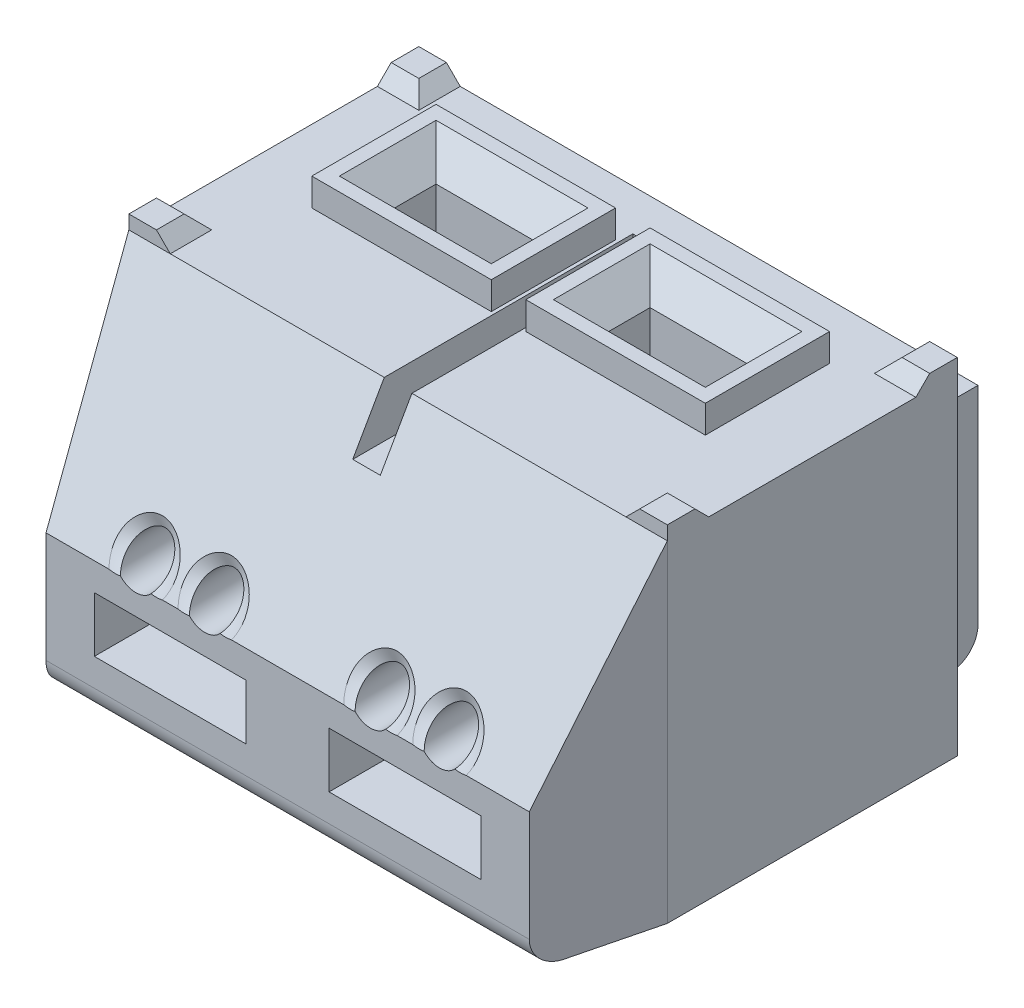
ISO-10303-21;
HEADER;
FILE_DESCRIPTION(('STEP AP214'),'2;1');
FILE_NAME('part.step','',(''),(''),'','','');
FILE_SCHEMA(('AUTOMOTIVE_DESIGN { 1 0 10303 214 1 1 1 1 }'));
ENDSEC;
DATA;
#1=APPLICATION_CONTEXT('core data for automotive mechanical design processes');
#2=APPLICATION_PROTOCOL_DEFINITION('international standard','automotive_design',2000,#1);
#3=PRODUCT_CONTEXT('',#1,'mechanical');
#4=PRODUCT('Part','Part','',(#3));
#5=PRODUCT_RELATED_PRODUCT_CATEGORY('part','',(#4));
#6=PRODUCT_DEFINITION_FORMATION('','',#4);
#7=PRODUCT_DEFINITION_CONTEXT('part definition',#1,'design');
#8=PRODUCT_DEFINITION('design','',#6,#7);
#9=PRODUCT_DEFINITION_SHAPE('','',#8);
#10=(LENGTH_UNIT() NAMED_UNIT(*) SI_UNIT(.MILLI.,.METRE.));
#11=(NAMED_UNIT(*) PLANE_ANGLE_UNIT() SI_UNIT($,.RADIAN.));
#12=(NAMED_UNIT(*) SI_UNIT($,.STERADIAN.) SOLID_ANGLE_UNIT());
#13=UNCERTAINTY_MEASURE_WITH_UNIT(LENGTH_MEASURE(1.E-05),#10,'distance_accuracy_value','');
#14=(GEOMETRIC_REPRESENTATION_CONTEXT(3) GLOBAL_UNCERTAINTY_ASSIGNED_CONTEXT((#13)) GLOBAL_UNIT_ASSIGNED_CONTEXT((#10,
#11,#12)) REPRESENTATION_CONTEXT('',''));
#15=CARTESIAN_POINT('',(0.,0.,0.));
#16=DIRECTION('',(0.,0.,1.));
#17=DIRECTION('',(1.,0.,0.));
#18=AXIS2_PLACEMENT_3D('',#15,#16,#17);
#19=CARTESIAN_POINT('',(-9.75,12.,-9.));
#20=DIRECTION('',(0.,1.,0.));
#21=DIRECTION('',(0.,0.,1.));
#22=AXIS2_PLACEMENT_3D('',#19,#20,#21);
#23=PLANE('',#22);
#24=DIRECTION('',(1.,0.,0.));
#25=VECTOR('',#24,1.);
#26=CARTESIAN_POINT('',(-7.125,12.,0.999999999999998));
#27=LINE('',#26,#25);
#28=CARTESIAN_POINT('',(-7.125,12.,0.999999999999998));
#29=VERTEX_POINT('',#28);
#30=CARTESIAN_POINT('',(-0.625000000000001,12.,0.999999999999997));
#31=VERTEX_POINT('',#30);
#32=EDGE_CURVE('E1362',#29,#31,#27,.T.);
#33=ORIENTED_EDGE('',*,*,#32,.F.);
#34=DIRECTION('',(0.,0.,1.));
#35=VECTOR('',#34,1.);
#36=CARTESIAN_POINT('',(-7.125,12.,-3.5));
#37=LINE('',#36,#35);
#38=CARTESIAN_POINT('',(-7.125,12.,-3.5));
#39=VERTEX_POINT('',#38);
#40=EDGE_CURVE('E1359',#39,#29,#37,.T.);
#41=ORIENTED_EDGE('',*,*,#40,.F.);
#42=DIRECTION('',(-1.,0.,0.));
#43=VECTOR('',#42,1.);
#44=CARTESIAN_POINT('',(-7.125,12.,-3.5));
#45=LINE('',#44,#43);
#46=CARTESIAN_POINT('',(-0.625000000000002,12.,-3.5));
#47=VERTEX_POINT('',#46);
#48=EDGE_CURVE('E1367',#47,#39,#45,.T.);
#49=ORIENTED_EDGE('',*,*,#48,.F.);
#50=DIRECTION('',(0.,0.,-1.));
#51=VECTOR('',#50,1.);
#52=CARTESIAN_POINT('',(-0.625000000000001,12.,-3.5));
#53=LINE('',#52,#51);
#54=EDGE_CURVE('E1364',#31,#47,#53,.T.);
#55=ORIENTED_EDGE('',*,*,#54,.F.);
#56=EDGE_LOOP('',(#33,#41,#49,#55));
#57=FACE_BOUND('',#56,.T.);
#58=DIRECTION('',(-1.,0.,0.));
#59=VECTOR('',#58,1.);
#60=CARTESIAN_POINT('',(7.125,12.,-3.5));
#61=LINE('',#60,#59);
#62=CARTESIAN_POINT('',(7.125,12.,-3.5));
#63=VERTEX_POINT('',#62);
#64=CARTESIAN_POINT('',(0.625000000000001,12.,-3.5));
#65=VERTEX_POINT('',#64);
#66=EDGE_CURVE('E1333',#63,#65,#61,.T.);
#67=ORIENTED_EDGE('',*,*,#66,.F.);
#68=DIRECTION('',(0.,0.,-1.));
#69=VECTOR('',#68,1.);
#70=CARTESIAN_POINT('',(7.125,12.,-3.5));
#71=LINE('',#70,#69);
#72=CARTESIAN_POINT('',(7.125,12.,0.999999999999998));
#73=VERTEX_POINT('',#72);
#74=EDGE_CURVE('E1330',#73,#63,#71,.T.);
#75=ORIENTED_EDGE('',*,*,#74,.F.);
#76=DIRECTION('',(1.,0.,0.));
#77=VECTOR('',#76,1.);
#78=CARTESIAN_POINT('',(7.125,12.,0.999999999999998));
#79=LINE('',#78,#77);
#80=CARTESIAN_POINT('',(0.625000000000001,12.,0.999999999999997));
#81=VERTEX_POINT('',#80);
#82=EDGE_CURVE('E1338',#81,#73,#79,.T.);
#83=ORIENTED_EDGE('',*,*,#82,.F.);
#84=DIRECTION('',(0.,0.,1.));
#85=VECTOR('',#84,1.);
#86=CARTESIAN_POINT('',(0.625000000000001,12.,-3.5));
#87=LINE('',#86,#85);
#88=EDGE_CURVE('E1335',#65,#81,#87,.T.);
#89=ORIENTED_EDGE('',*,*,#88,.F.);
#90=EDGE_LOOP('',(#67,#75,#83,#89));
#91=FACE_BOUND('',#90,.T.);
#92=DIRECTION('',(0.,0.,-1.));
#93=VECTOR('',#92,1.);
#94=CARTESIAN_POINT('',(-8.25,12.,-5.49999999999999));
#95=LINE('',#94,#93);
#96=CARTESIAN_POINT('',(-8.25,12.,-3.99999999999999));
#97=VERTEX_POINT('',#96);
#98=CARTESIAN_POINT('',(-8.25,12.,-5.49999999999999));
#99=VERTEX_POINT('',#98);
#100=EDGE_CURVE('E483',#97,#99,#95,.T.);
#101=ORIENTED_EDGE('',*,*,#100,.F.);
#102=DIRECTION('',(1.,0.,0.));
#103=VECTOR('',#102,1.);
#104=CARTESIAN_POINT('',(-9.75,12.,-3.99999999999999));
#105=LINE('',#104,#103);
#106=CARTESIAN_POINT('',(-9.75,12.,-3.99999999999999));
#107=VERTEX_POINT('',#106);
#108=EDGE_CURVE('E477',#107,#97,#105,.T.);
#109=ORIENTED_EDGE('',*,*,#108,.F.);
#110=DIRECTION('',(0.,0.,1.));
#111=VECTOR('',#110,1.);
#112=CARTESIAN_POINT('',(-9.75,12.,-9.));
#113=LINE('',#112,#111);
#114=CARTESIAN_POINT('',(-9.75,12.,3.49999999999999));
#115=VERTEX_POINT('',#114);
#116=EDGE_CURVE('E479',#107,#115,#113,.T.);
#117=ORIENTED_EDGE('',*,*,#116,.T.);
#118=DIRECTION('',(-1.,0.,0.));
#119=VECTOR('',#118,1.);
#120=CARTESIAN_POINT('',(-9.75,12.,3.49999999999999));
#121=LINE('',#120,#119);
#122=CARTESIAN_POINT('',(-8.25,12.,3.49999999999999));
#123=VERTEX_POINT('',#122);
#124=EDGE_CURVE('E937',#123,#115,#121,.T.);
#125=ORIENTED_EDGE('',*,*,#124,.F.);
#126=DIRECTION('',(0.,0.,-1.));
#127=VECTOR('',#126,1.);
#128=CARTESIAN_POINT('',(-8.25,12.,3.49999999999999));
#129=LINE('',#128,#127);
#130=CARTESIAN_POINT('',(-8.25,12.,4.99999999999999));
#131=VERTEX_POINT('',#130);
#132=EDGE_CURVE('E930',#131,#123,#129,.T.);
#133=ORIENTED_EDGE('',*,*,#132,.F.);
#134=DIRECTION('',(-1.,0.,0.));
#135=VECTOR('',#134,1.);
#136=CARTESIAN_POINT('',(9.75,12.,4.99999999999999));
#137=LINE('',#136,#135);
#138=CARTESIAN_POINT('',(-0.5,12.,5.));
#139=VERTEX_POINT('',#138);
#140=EDGE_CURVE('E537',#139,#131,#137,.T.);
#141=ORIENTED_EDGE('',*,*,#140,.F.);
#142=DIRECTION('',(0.,0.,1.));
#143=VECTOR('',#142,1.);
#144=CARTESIAN_POINT('',(-0.500000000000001,12.,-3.99999999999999));
#145=LINE('',#144,#143);
#146=CARTESIAN_POINT('',(-0.500000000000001,12.,-3.99999999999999));
#147=VERTEX_POINT('',#146);
#148=EDGE_CURVE('E1199',#147,#139,#145,.T.);
#149=ORIENTED_EDGE('',*,*,#148,.F.);
#150=DIRECTION('',(-1.,0.,0.));
#151=VECTOR('',#150,1.);
#152=CARTESIAN_POINT('',(0.499999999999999,12.,-3.99999999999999));
#153=LINE('',#152,#151);
#154=CARTESIAN_POINT('',(0.499999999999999,12.,-3.99999999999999));
#155=VERTEX_POINT('',#154);
#156=EDGE_CURVE('E1196',#155,#147,#153,.T.);
#157=ORIENTED_EDGE('',*,*,#156,.F.);
#158=DIRECTION('',(0.,0.,-1.));
#159=VECTOR('',#158,1.);
#160=CARTESIAN_POINT('',(0.499999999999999,12.,-3.99999999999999));
#161=LINE('',#160,#159);
#162=CARTESIAN_POINT('',(0.499999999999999,12.,5.));
#163=VERTEX_POINT('',#162);
#164=EDGE_CURVE('E534',#163,#155,#161,.T.);
#165=ORIENTED_EDGE('',*,*,#164,.F.);
#166=CARTESIAN_POINT('',(8.25,12.,4.99999999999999));
#167=VERTEX_POINT('',#166);
#168=EDGE_CURVE('E531',#167,#163,#137,.T.);
#169=ORIENTED_EDGE('',*,*,#168,.F.);
#170=DIRECTION('',(0.,0.,1.));
#171=VECTOR('',#170,1.);
#172=CARTESIAN_POINT('',(8.25,12.,3.49999999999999));
#173=LINE('',#172,#171);
#174=CARTESIAN_POINT('',(8.25,12.,3.49999999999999));
#175=VERTEX_POINT('',#174);
#176=EDGE_CURVE('E532',#175,#167,#173,.T.);
#177=ORIENTED_EDGE('',*,*,#176,.F.);
#178=DIRECTION('',(-1.,0.,0.));
#179=VECTOR('',#178,1.);
#180=CARTESIAN_POINT('',(9.75,12.,3.49999999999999));
#181=LINE('',#180,#179);
#182=CARTESIAN_POINT('',(9.75,12.,3.49999999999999));
#183=VERTEX_POINT('',#182);
#184=EDGE_CURVE('E547',#183,#175,#181,.T.);
#185=ORIENTED_EDGE('',*,*,#184,.F.);
#186=DIRECTION('',(0.,0.,-1.));
#187=VECTOR('',#186,1.);
#188=CARTESIAN_POINT('',(9.75,12.,-9.));
#189=LINE('',#188,#187);
#190=CARTESIAN_POINT('',(9.75,12.,-3.99999999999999));
#191=VERTEX_POINT('',#190);
#192=EDGE_CURVE('E493',#183,#191,#189,.T.);
#193=ORIENTED_EDGE('',*,*,#192,.T.);
#194=DIRECTION('',(1.,0.,0.));
#195=VECTOR('',#194,1.);
#196=CARTESIAN_POINT('',(9.75,12.,-3.99999999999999));
#197=LINE('',#196,#195);
#198=CARTESIAN_POINT('',(8.25,12.,-3.99999999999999));
#199=VERTEX_POINT('',#198);
#200=EDGE_CURVE('E949',#199,#191,#197,.T.);
#201=ORIENTED_EDGE('',*,*,#200,.F.);
#202=DIRECTION('',(0.,0.,1.));
#203=VECTOR('',#202,1.);
#204=CARTESIAN_POINT('',(8.25,12.,-5.49999999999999));
#205=LINE('',#204,#203);
#206=CARTESIAN_POINT('',(8.25,12.,-5.49999999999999));
#207=VERTEX_POINT('',#206);
#208=EDGE_CURVE('E946',#207,#199,#205,.T.);
#209=ORIENTED_EDGE('',*,*,#208,.F.);
#210=DIRECTION('',(1.,0.,0.));
#211=VECTOR('',#210,1.);
#212=CARTESIAN_POINT('',(-9.75,12.,-5.49999999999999));
#213=LINE('',#212,#211);
#214=EDGE_CURVE('E1327',#99,#207,#213,.T.);
#215=ORIENTED_EDGE('',*,*,#214,.F.);
#216=EDGE_LOOP('',(#101,#109,#117,#125,#133,#141,#149,#157,#165,#169,#177,#185,#193,#201,#209,#215));
#217=FACE_BOUND('',#216,.T.);
#218=ADVANCED_FACE('F33',(#57,#91,#217),#23,.T.);
#219=CARTESIAN_POINT('',(-9.75,12.,-9.));
#220=DIRECTION('',(1.,0.,0.));
#221=DIRECTION('',(0.,0.,-1.));
#222=AXIS2_PLACEMENT_3D('',#219,#220,#221);
#223=PLANE('',#222);
#224=ORIENTED_EDGE('',*,*,#116,.F.);
#225=DIRECTION('',(0.,0.707106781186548,-0.707106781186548));
#226=VECTOR('',#225,1.);
#227=CARTESIAN_POINT('',(-9.75,12.5,-4.5));
#228=LINE('',#227,#226);
#229=CARTESIAN_POINT('',(-9.75,12.5,-4.5));
#230=VERTEX_POINT('',#229);
#231=EDGE_CURVE('E489',#107,#230,#228,.T.);
#232=ORIENTED_EDGE('',*,*,#231,.T.);
#233=DIRECTION('',(0.,0.,1.));
#234=VECTOR('',#233,1.);
#235=CARTESIAN_POINT('',(-9.75,12.5,-5.49999999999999));
#236=LINE('',#235,#234);
#237=CARTESIAN_POINT('',(-9.75,12.5,-5.49999999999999));
#238=VERTEX_POINT('',#237);
#239=EDGE_CURVE('E918',#238,#230,#236,.T.);
#240=ORIENTED_EDGE('',*,*,#239,.F.);
#241=DIRECTION('',(0.,-1.,0.));
#242=VECTOR('',#241,1.);
#243=CARTESIAN_POINT('',(-9.75,12.,-5.49999999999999));
#244=LINE('',#243,#242);
#245=CARTESIAN_POINT('',(-9.75,0.,-5.49999999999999));
#246=VERTEX_POINT('',#245);
#247=EDGE_CURVE('E927',#238,#246,#244,.T.);
#248=ORIENTED_EDGE('',*,*,#247,.T.);
#249=DIRECTION('',(0.,0.,1.));
#250=VECTOR('',#249,1.);
#251=CARTESIAN_POINT('',(-9.75,0.,-9.));
#252=LINE('',#251,#250);
#253=CARTESIAN_POINT('',(-9.75,0.,5.));
#254=VERTEX_POINT('',#253);
#255=EDGE_CURVE('E1388',#246,#254,#252,.T.);
#256=ORIENTED_EDGE('',*,*,#255,.T.);
#257=DIRECTION('',(0.,-1.,0.));
#258=VECTOR('',#257,1.);
#259=CARTESIAN_POINT('',(-9.75,13.,5.));
#260=LINE('',#259,#258);
#261=CARTESIAN_POINT('',(-9.75,12.,5.));
#262=VERTEX_POINT('',#261);
#263=EDGE_CURVE('E770',#262,#254,#260,.T.);
#264=ORIENTED_EDGE('',*,*,#263,.F.);
#265=DIRECTION('',(0.,-1.,0.));
#266=VECTOR('',#265,1.);
#267=CARTESIAN_POINT('',(-9.75,12.5,4.99999999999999));
#268=LINE('',#267,#266);
#269=CARTESIAN_POINT('',(-9.75,12.5,4.99999999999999));
#270=VERTEX_POINT('',#269);
#271=EDGE_CURVE('E944',#270,#262,#268,.T.);
#272=ORIENTED_EDGE('',*,*,#271,.F.);
#273=DIRECTION('',(0.,0.,1.));
#274=VECTOR('',#273,1.);
#275=CARTESIAN_POINT('',(-9.75,12.5,3.49999999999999));
#276=LINE('',#275,#274);
#277=CARTESIAN_POINT('',(-9.75,12.5,4.));
#278=VERTEX_POINT('',#277);
#279=EDGE_CURVE('E939',#278,#270,#276,.T.);
#280=ORIENTED_EDGE('',*,*,#279,.F.);
#281=DIRECTION('',(0.,-0.707106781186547,-0.707106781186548));
#282=VECTOR('',#281,1.);
#283=CARTESIAN_POINT('',(-9.75,12.5,4.));
#284=LINE('',#283,#282);
#285=EDGE_CURVE('E492',#278,#115,#284,.T.);
#286=ORIENTED_EDGE('',*,*,#285,.T.);
#287=EDGE_LOOP('',(#224,#232,#240,#248,#256,#264,#272,#280,#286));
#288=FACE_BOUND('',#287,.T.);
#289=ADVANCED_FACE('F35',(#288),#223,.F.);
#290=CARTESIAN_POINT('',(-9.75,12.,9.));
#291=DIRECTION('',(0.,0.,-1.));
#292=DIRECTION('',(-1.,0.,0.));
#293=AXIS2_PLACEMENT_3D('',#290,#291,#292);
#294=PLANE('',#293);
#295=CARTESIAN_POINT('',(5.5,5.5,9.));
#296=DIRECTION('',(0.,0.,1.));
#297=DIRECTION('',(-1.,0.,0.));
#298=AXIS2_PLACEMENT_3D('',#295,#296,#297);
#299=CIRCLE('',#298,0.75);
#300=CARTESIAN_POINT('',(4.94611451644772,4.99432137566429,9.00021448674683));
#301=VERTEX_POINT('',#300);
#302=CARTESIAN_POINT('',(6.05388548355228,4.99432137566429,9.00021448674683));
#303=VERTEX_POINT('',#302);
#304=EDGE_CURVE('E812',#301,#303,#299,.T.);
#305=ORIENTED_EDGE('',*,*,#304,.F.);
#306=CARTESIAN_POINT('',(4.53220886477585,5.00019582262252,8.99988810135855));
#307=CARTESIAN_POINT('',(4.55029901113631,4.99671551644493,9.00023136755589));
#308=CARTESIAN_POINT('',(4.56846514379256,4.99361959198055,9.00054109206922));
#309=CARTESIAN_POINT('',(4.60458948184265,4.9882789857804,9.00108034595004));
#310=CARTESIAN_POINT('',(4.62254555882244,4.98602000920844,9.00131121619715));
#311=CARTESIAN_POINT('',(4.65822045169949,4.98234174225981,9.00168913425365));
#312=CARTESIAN_POINT('',(4.67593776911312,4.98090815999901,9.0018376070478));
#313=CARTESIAN_POINT('',(4.71110508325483,4.97886815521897,9.00204692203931));
#314=CARTESIAN_POINT('',(4.72855423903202,4.97824749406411,9.00210927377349));
#315=CARTESIAN_POINT('',(4.76315576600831,4.977819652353,9.00214259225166));
#316=CARTESIAN_POINT('',(4.78030795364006,4.97799834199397,9.00211514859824));
#317=CARTESIAN_POINT('',(4.81428624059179,4.97915438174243,9.00196510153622));
#318=CARTESIAN_POINT('',(4.83111281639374,4.9801177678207,9.0018441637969));
#319=CARTESIAN_POINT('',(4.864411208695,4.98282735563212,9.00150340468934));
#320=CARTESIAN_POINT('',(4.88088415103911,4.98455981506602,9.0012853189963));
#321=CARTESIAN_POINT('',(4.91344584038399,4.98879020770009,9.00074638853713));
#322=CARTESIAN_POINT('',(4.92953637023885,4.99127468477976,9.00042734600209));
#323=CARTESIAN_POINT('',(4.94555543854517,4.99415731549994,9.00005215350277));
#324=B_SPLINE_CURVE_WITH_KNOTS('',3,(#306,#307,#308,#309,#310,#311,#312,#313,#314,#315,#316,
#317,#318,#319,#320,#321,#322,#323),.UNSPECIFIED.,.F.,.F.,(4,2,2,2,2,2,2,2,4),(0.,
0.0552730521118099,0.109553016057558,0.162862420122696,0.215225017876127,0.266665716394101,
0.317210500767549,0.366886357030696,0.415721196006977),.UNSPECIFIED.);
#325=CARTESIAN_POINT('',(4.53197197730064,5.,9.));
#326=VERTEX_POINT('',#325);
#327=EDGE_CURVE('E563',#301,#326,#324,.F.);
#328=ORIENTED_EDGE('',*,*,#327,.T.);
#329=DIRECTION('',(-1.,0.,0.));
#330=VECTOR('',#329,1.);
#331=CARTESIAN_POINT('',(9.75,5.,8.99999999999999));
#332=LINE('',#331,#330);
#333=CARTESIAN_POINT('',(3.96802802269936,5.,9.));
#334=VERTEX_POINT('',#333);
#335=EDGE_CURVE('E807',#326,#334,#332,.T.);
#336=ORIENTED_EDGE('',*,*,#335,.T.);
#337=CARTESIAN_POINT('',(3.55444456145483,4.99415731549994,9.00005215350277));
#338=CARTESIAN_POINT('',(3.57046362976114,4.99127468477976,9.00042734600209));
#339=CARTESIAN_POINT('',(3.58655415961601,4.98879020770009,9.00074638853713));
#340=CARTESIAN_POINT('',(3.61911584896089,4.98455981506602,9.0012853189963));
#341=CARTESIAN_POINT('',(3.635588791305,4.98282735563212,9.00150340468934));
#342=CARTESIAN_POINT('',(3.66888718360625,4.9801177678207,9.0018441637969));
#343=CARTESIAN_POINT('',(3.68571375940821,4.97915438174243,9.00196510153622));
#344=CARTESIAN_POINT('',(3.71969204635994,4.97799834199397,9.00211514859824));
#345=CARTESIAN_POINT('',(3.73684423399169,4.977819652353,9.00214259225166));
#346=CARTESIAN_POINT('',(3.77144576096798,4.9782474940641,9.00210927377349));
#347=CARTESIAN_POINT('',(3.78889491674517,4.97886815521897,9.00204692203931));
#348=CARTESIAN_POINT('',(3.82406223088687,4.98090815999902,9.0018376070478));
#349=CARTESIAN_POINT('',(3.84177954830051,4.98234174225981,9.00168913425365));
#350=CARTESIAN_POINT('',(3.87745444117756,4.98602000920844,9.00131121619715));
#351=CARTESIAN_POINT('',(3.89541051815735,4.9882789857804,9.00108034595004));
#352=CARTESIAN_POINT('',(3.93153485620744,4.99361959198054,9.00054109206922));
#353=CARTESIAN_POINT('',(3.94970098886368,4.99671551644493,9.00023136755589));
#354=CARTESIAN_POINT('',(3.96779113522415,5.00019582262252,8.99988810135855));
#355=B_SPLINE_CURVE_WITH_KNOTS('',3,(#337,#338,#339,#340,#341,#342,#343,#344,#345,#346,#347,
#348,#349,#350,#351,#352,#353,#354),.UNSPECIFIED.,.F.,.F.,(4,2,2,2,2,2,2,2,4),(0.,
0.0488348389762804,0.0985106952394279,0.149055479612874,0.20049617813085,0.25285877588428,
0.306168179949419,0.360448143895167,0.415721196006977),.UNSPECIFIED.);
#356=CARTESIAN_POINT('',(3.55388548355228,4.99432137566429,9.00021448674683));
#357=VERTEX_POINT('',#356);
#358=EDGE_CURVE('E645',#334,#357,#355,.F.);
#359=ORIENTED_EDGE('',*,*,#358,.T.);
#360=CARTESIAN_POINT('',(3.,5.5,9.));
#361=DIRECTION('',(0.,0.,1.));
#362=DIRECTION('',(-1.,0.,0.));
#363=AXIS2_PLACEMENT_3D('',#360,#361,#362);
#364=CIRCLE('',#363,0.75);
#365=CARTESIAN_POINT('',(2.44611451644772,4.99432137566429,9.00021448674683));
#366=VERTEX_POINT('',#365);
#367=EDGE_CURVE('E864',#366,#357,#364,.T.);
#368=ORIENTED_EDGE('',*,*,#367,.F.);
#369=CARTESIAN_POINT('',(2.03220886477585,5.00019582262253,8.99988810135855));
#370=CARTESIAN_POINT('',(2.05029901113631,4.99671551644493,9.00023136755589));
#371=CARTESIAN_POINT('',(2.06846514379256,4.99361959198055,9.00054109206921));
#372=CARTESIAN_POINT('',(2.10458948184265,4.9882789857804,9.00108034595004));
#373=CARTESIAN_POINT('',(2.12254555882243,4.98602000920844,9.00131121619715));
#374=CARTESIAN_POINT('',(2.15822045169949,4.98234174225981,9.00168913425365));
#375=CARTESIAN_POINT('',(2.17593776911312,4.98090815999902,9.0018376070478));
#376=CARTESIAN_POINT('',(2.21110508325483,4.97886815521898,9.00204692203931));
#377=CARTESIAN_POINT('',(2.22855423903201,4.97824749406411,9.00210927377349));
#378=CARTESIAN_POINT('',(2.26315576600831,4.977819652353,9.00214259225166));
#379=CARTESIAN_POINT('',(2.28030795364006,4.97799834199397,9.00211514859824));
#380=CARTESIAN_POINT('',(2.31428624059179,4.97915438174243,9.00196510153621));
#381=CARTESIAN_POINT('',(2.33111281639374,4.9801177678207,9.0018441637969));
#382=CARTESIAN_POINT('',(2.364411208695,4.98282735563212,9.00150340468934));
#383=CARTESIAN_POINT('',(2.38088415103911,4.98455981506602,9.0012853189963));
#384=CARTESIAN_POINT('',(2.41344584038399,4.98879020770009,9.00074638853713));
#385=CARTESIAN_POINT('',(2.42953637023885,4.99127468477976,9.00042734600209));
#386=CARTESIAN_POINT('',(2.44555543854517,4.99415731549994,9.00005215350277));
#387=B_SPLINE_CURVE_WITH_KNOTS('',3,(#369,#370,#371,#372,#373,#374,#375,#376,#377,#378,#379,
#380,#381,#382,#383,#384,#385,#386),.UNSPECIFIED.,.F.,.F.,(4,2,2,2,2,2,2,2,4),(0.,
0.0552730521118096,0.109553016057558,0.162862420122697,0.215225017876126,0.266665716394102,
0.317210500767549,0.366886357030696,0.415721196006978),.UNSPECIFIED.);
#388=CARTESIAN_POINT('',(2.03197197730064,5.,9.));
#389=VERTEX_POINT('',#388);
#390=EDGE_CURVE('E623',#366,#389,#387,.F.);
#391=ORIENTED_EDGE('',*,*,#390,.T.);
#392=CARTESIAN_POINT('',(-2.03197197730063,5.,9.));
#393=VERTEX_POINT('',#392);
#394=EDGE_CURVE('E788',#389,#393,#332,.T.);
#395=ORIENTED_EDGE('',*,*,#394,.T.);
#396=CARTESIAN_POINT('',(-2.44555543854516,4.99415731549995,9.00005215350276));
#397=CARTESIAN_POINT('',(-2.42953637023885,4.99127468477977,9.00042734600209));
#398=CARTESIAN_POINT('',(-2.41344584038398,4.9887902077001,9.00074638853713));
#399=CARTESIAN_POINT('',(-2.3808841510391,4.98455981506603,9.0012853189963));
#400=CARTESIAN_POINT('',(-2.36441120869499,4.98282735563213,9.00150340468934));
#401=CARTESIAN_POINT('',(-2.33111281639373,4.98011776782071,9.00184416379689));
#402=CARTESIAN_POINT('',(-2.31428624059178,4.97915438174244,9.00196510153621));
#403=CARTESIAN_POINT('',(-2.28030795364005,4.97799834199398,9.00211514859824));
#404=CARTESIAN_POINT('',(-2.2631557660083,4.97781965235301,9.00214259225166));
#405=CARTESIAN_POINT('',(-2.22855423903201,4.97824749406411,9.00210927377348));
#406=CARTESIAN_POINT('',(-2.21110508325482,4.97886815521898,9.00204692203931));
#407=CARTESIAN_POINT('',(-2.17593776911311,4.98090815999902,9.0018376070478));
#408=CARTESIAN_POINT('',(-2.15822045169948,4.98234174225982,9.00168913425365));
#409=CARTESIAN_POINT('',(-2.12254555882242,4.98602000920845,9.00131121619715));
#410=CARTESIAN_POINT('',(-2.10458948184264,4.98827898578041,9.00108034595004));
#411=CARTESIAN_POINT('',(-2.06846514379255,4.99361959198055,9.00054109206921));
#412=CARTESIAN_POINT('',(-2.0502990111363,4.99671551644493,9.00023136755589));
#413=CARTESIAN_POINT('',(-2.03220886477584,5.00019582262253,8.99988810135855));
#414=B_SPLINE_CURVE_WITH_KNOTS('',3,(#396,#397,#398,#399,#400,#401,#402,#403,#404,#405,#406,
#407,#408,#409,#410,#411,#412,#413),.UNSPECIFIED.,.F.,.F.,(4,2,2,2,2,2,2,2,4),(0.,
0.0488348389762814,0.0985106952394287,0.149055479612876,0.200496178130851,0.252858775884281,
0.306168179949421,0.360448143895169,0.415721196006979),.UNSPECIFIED.);
#415=CARTESIAN_POINT('',(-2.44611451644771,4.9943213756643,9.00021448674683));
#416=VERTEX_POINT('',#415);
#417=EDGE_CURVE('E748',#393,#416,#414,.F.);
#418=ORIENTED_EDGE('',*,*,#417,.T.);
#419=CARTESIAN_POINT('',(-3.,5.5,9.));
#420=DIRECTION('',(0.,0.,1.));
#421=DIRECTION('',(1.,0.,0.));
#422=AXIS2_PLACEMENT_3D('',#419,#420,#421);
#423=CIRCLE('',#422,0.75);
#424=CARTESIAN_POINT('',(-3.55388548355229,4.9943213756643,9.00021448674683));
#425=VERTEX_POINT('',#424);
#426=EDGE_CURVE('E1075',#425,#416,#423,.T.);
#427=ORIENTED_EDGE('',*,*,#426,.F.);
#428=CARTESIAN_POINT('',(-3.96779113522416,5.00019582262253,8.99988810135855));
#429=CARTESIAN_POINT('',(-3.9497009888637,4.99671551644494,9.00023136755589));
#430=CARTESIAN_POINT('',(-3.93153485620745,4.99361959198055,9.00054109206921));
#431=CARTESIAN_POINT('',(-3.89541051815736,4.98827898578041,9.00108034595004));
#432=CARTESIAN_POINT('',(-3.87745444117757,4.98602000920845,9.00131121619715));
#433=CARTESIAN_POINT('',(-3.84177954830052,4.98234174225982,9.00168913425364));
#434=CARTESIAN_POINT('',(-3.82406223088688,4.98090815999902,9.0018376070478));
#435=CARTESIAN_POINT('',(-3.78889491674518,4.97886815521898,9.00204692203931));
#436=CARTESIAN_POINT('',(-3.77144576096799,4.97824749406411,9.00210927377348));
#437=CARTESIAN_POINT('',(-3.73684423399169,4.97781965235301,9.00214259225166));
#438=CARTESIAN_POINT('',(-3.71969204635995,4.97799834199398,9.00211514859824));
#439=CARTESIAN_POINT('',(-3.68571375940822,4.97915438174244,9.00196510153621));
#440=CARTESIAN_POINT('',(-3.66888718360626,4.98011776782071,9.00184416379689));
#441=CARTESIAN_POINT('',(-3.63558879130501,4.98282735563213,9.00150340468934));
#442=CARTESIAN_POINT('',(-3.61911584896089,4.98455981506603,9.00128531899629));
#443=CARTESIAN_POINT('',(-3.58655415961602,4.9887902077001,9.00074638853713));
#444=CARTESIAN_POINT('',(-3.57046362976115,4.99127468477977,9.00042734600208));
#445=CARTESIAN_POINT('',(-3.55444456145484,4.99415731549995,9.00005215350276));
#446=B_SPLINE_CURVE_WITH_KNOTS('',3,(#428,#429,#430,#431,#432,#433,#434,#435,#436,#437,#438,
#439,#440,#441,#442,#443,#444,#445),.UNSPECIFIED.,.F.,.F.,(4,2,2,2,2,2,2,2,4),(0.,
0.05527305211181,0.109553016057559,0.1628624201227,0.21522501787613,0.266665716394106,
0.317210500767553,0.366886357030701,0.415721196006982),.UNSPECIFIED.);
#447=CARTESIAN_POINT('',(-3.96802802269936,5.,9.));
#448=VERTEX_POINT('',#447);
#449=EDGE_CURVE('E726',#425,#448,#446,.F.);
#450=ORIENTED_EDGE('',*,*,#449,.T.);
#451=CARTESIAN_POINT('',(-4.53197197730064,5.,9.));
#452=VERTEX_POINT('',#451);
#453=EDGE_CURVE('E795',#448,#452,#332,.T.);
#454=ORIENTED_EDGE('',*,*,#453,.T.);
#455=CARTESIAN_POINT('',(-4.94555543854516,4.99415731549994,9.00005215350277));
#456=CARTESIAN_POINT('',(-4.92953637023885,4.99127468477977,9.00042734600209));
#457=CARTESIAN_POINT('',(-4.91344584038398,4.9887902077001,9.00074638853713));
#458=CARTESIAN_POINT('',(-4.88088415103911,4.98455981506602,9.0012853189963));
#459=CARTESIAN_POINT('',(-4.864411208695,4.98282735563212,9.00150340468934));
#460=CARTESIAN_POINT('',(-4.83111281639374,4.98011776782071,9.0018441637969));
#461=CARTESIAN_POINT('',(-4.81428624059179,4.97915438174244,9.00196510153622));
#462=CARTESIAN_POINT('',(-4.78030795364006,4.97799834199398,9.00211514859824));
#463=CARTESIAN_POINT('',(-4.76315576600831,4.97781965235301,9.00214259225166));
#464=CARTESIAN_POINT('',(-4.72855423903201,4.97824749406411,9.00210927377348));
#465=CARTESIAN_POINT('',(-4.71110508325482,4.97886815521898,9.00204692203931));
#466=CARTESIAN_POINT('',(-4.67593776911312,4.98090815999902,9.0018376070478));
#467=CARTESIAN_POINT('',(-4.65822045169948,4.98234174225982,9.00168913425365));
#468=CARTESIAN_POINT('',(-4.62254555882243,4.98602000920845,9.00131121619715));
#469=CARTESIAN_POINT('',(-4.60458948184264,4.98827898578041,9.00108034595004));
#470=CARTESIAN_POINT('',(-4.56846514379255,4.99361959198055,9.00054109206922));
#471=CARTESIAN_POINT('',(-4.55029901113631,4.99671551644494,9.00023136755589));
#472=CARTESIAN_POINT('',(-4.53220886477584,5.00019582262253,8.99988810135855));
#473=B_SPLINE_CURVE_WITH_KNOTS('',3,(#455,#456,#457,#458,#459,#460,#461,#462,#463,#464,#465,
#466,#467,#468,#469,#470,#471,#472),.UNSPECIFIED.,.F.,.F.,(4,2,2,2,2,2,2,2,4),(0.,
0.0488348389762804,0.0985106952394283,0.149055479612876,0.200496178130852,0.252858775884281,
0.30616817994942,0.36044814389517,0.415721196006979),.UNSPECIFIED.);
#474=CARTESIAN_POINT('',(-4.94611451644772,4.99432137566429,9.00021448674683));
#475=VERTEX_POINT('',#474);
#476=EDGE_CURVE('E2175',#452,#475,#473,.F.);
#477=ORIENTED_EDGE('',*,*,#476,.T.);
#478=CARTESIAN_POINT('',(-5.5,5.5,9.));
#479=DIRECTION('',(0.,0.,1.));
#480=DIRECTION('',(1.,0.,0.));
#481=AXIS2_PLACEMENT_3D('',#478,#479,#480);
#482=CIRCLE('',#481,0.75);
#483=CARTESIAN_POINT('',(-6.05388548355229,4.99432137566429,9.00021448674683));
#484=VERTEX_POINT('',#483);
#485=EDGE_CURVE('E1120',#484,#475,#482,.T.);
#486=ORIENTED_EDGE('',*,*,#485,.F.);
#487=CARTESIAN_POINT('',(-6.46779113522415,5.00019582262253,8.99988810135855));
#488=CARTESIAN_POINT('',(-6.44970098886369,4.99671551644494,9.0002313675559));
#489=CARTESIAN_POINT('',(-6.43153485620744,4.99361959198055,9.00054109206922));
#490=CARTESIAN_POINT('',(-6.39541051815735,4.98827898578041,9.00108034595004));
#491=CARTESIAN_POINT('',(-6.37745444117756,4.98602000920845,9.00131121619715));
#492=CARTESIAN_POINT('',(-6.34177954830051,4.98234174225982,9.00168913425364));
#493=CARTESIAN_POINT('',(-6.32406223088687,4.98090815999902,9.0018376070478));
#494=CARTESIAN_POINT('',(-6.28889491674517,4.97886815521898,9.00204692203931));
#495=CARTESIAN_POINT('',(-6.27144576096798,4.97824749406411,9.00210927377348));
#496=CARTESIAN_POINT('',(-6.23684423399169,4.97781965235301,9.00214259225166));
#497=CARTESIAN_POINT('',(-6.21969204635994,4.97799834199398,9.00211514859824));
#498=CARTESIAN_POINT('',(-6.18571375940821,4.97915438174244,9.00196510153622));
#499=CARTESIAN_POINT('',(-6.16888718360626,4.98011776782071,9.00184416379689));
#500=CARTESIAN_POINT('',(-6.135588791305,4.98282735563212,9.00150340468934));
#501=CARTESIAN_POINT('',(-6.11911584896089,4.98455981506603,9.0012853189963));
#502=CARTESIAN_POINT('',(-6.08655415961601,4.9887902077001,9.00074638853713));
#503=CARTESIAN_POINT('',(-6.07046362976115,4.99127468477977,9.00042734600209));
#504=CARTESIAN_POINT('',(-6.05444456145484,4.99415731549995,9.00005215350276));
#505=B_SPLINE_CURVE_WITH_KNOTS('',3,(#487,#488,#489,#490,#491,#492,#493,#494,#495,#496,#497,
#498,#499,#500,#501,#502,#503,#504),.UNSPECIFIED.,.F.,.F.,(4,2,2,2,2,2,2,2,4),(0.,
0.0552730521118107,0.109553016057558,0.162862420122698,0.215225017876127,0.266665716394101,
0.317210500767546,0.366886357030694,0.415721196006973),.UNSPECIFIED.);
#506=CARTESIAN_POINT('',(-6.46802802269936,5.,9.));
#507=VERTEX_POINT('',#506);
#508=EDGE_CURVE('E669',#484,#507,#505,.F.);
#509=ORIENTED_EDGE('',*,*,#508,.T.);
#510=CARTESIAN_POINT('',(-8.75,5.,9.));
#511=VERTEX_POINT('',#510);
#512=EDGE_CURVE('E544',#507,#511,#332,.T.);
#513=ORIENTED_EDGE('',*,*,#512,.T.);
#514=DIRECTION('',(0.,-1.,0.));
#515=VECTOR('',#514,1.);
#516=CARTESIAN_POINT('',(-8.75,13.,9.));
#517=LINE('',#516,#515);
#518=CARTESIAN_POINT('',(-8.75,1.,9.));
#519=VERTEX_POINT('',#518);
#520=EDGE_CURVE('E771',#511,#519,#517,.T.);
#521=ORIENTED_EDGE('',*,*,#520,.T.);
#522=DIRECTION('',(1.,0.,0.));
#523=VECTOR('',#522,1.);
#524=CARTESIAN_POINT('',(-9.75,1.,9.));
#525=LINE('',#524,#523);
#526=CARTESIAN_POINT('',(8.75,1.,9.));
#527=VERTEX_POINT('',#526);
#528=EDGE_CURVE('E1066',#519,#527,#525,.T.);
#529=ORIENTED_EDGE('',*,*,#528,.T.);
#530=DIRECTION('',(0.,-1.,0.));
#531=VECTOR('',#530,1.);
#532=CARTESIAN_POINT('',(8.75,13.,9.));
#533=LINE('',#532,#531);
#534=CARTESIAN_POINT('',(8.75,4.99999999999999,9.));
#535=VERTEX_POINT('',#534);
#536=EDGE_CURVE('E778',#535,#527,#533,.T.);
#537=ORIENTED_EDGE('',*,*,#536,.F.);
#538=CARTESIAN_POINT('',(6.46802802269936,5.,8.99999999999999));
#539=VERTEX_POINT('',#538);
#540=EDGE_CURVE('E802',#535,#539,#332,.T.);
#541=ORIENTED_EDGE('',*,*,#540,.T.);
#542=CARTESIAN_POINT('',(6.05444456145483,4.99415731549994,9.00005215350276));
#543=CARTESIAN_POINT('',(6.07046362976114,4.99127468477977,9.00042734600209));
#544=CARTESIAN_POINT('',(6.08655415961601,4.98879020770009,9.00074638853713));
#545=CARTESIAN_POINT('',(6.11911584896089,4.98455981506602,9.0012853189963));
#546=CARTESIAN_POINT('',(6.135588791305,4.98282735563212,9.00150340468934));
#547=CARTESIAN_POINT('',(6.16888718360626,4.9801177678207,9.00184416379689));
#548=CARTESIAN_POINT('',(6.18571375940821,4.97915438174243,9.00196510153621));
#549=CARTESIAN_POINT('',(6.21969204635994,4.97799834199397,9.00211514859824));
#550=CARTESIAN_POINT('',(6.23684423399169,4.977819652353,9.00214259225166));
#551=CARTESIAN_POINT('',(6.27144576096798,4.97824749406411,9.00210927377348));
#552=CARTESIAN_POINT('',(6.28889491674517,4.97886815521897,9.00204692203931));
#553=CARTESIAN_POINT('',(6.32406223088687,4.98090815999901,9.0018376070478));
#554=CARTESIAN_POINT('',(6.34177954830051,4.98234174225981,9.00168913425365));
#555=CARTESIAN_POINT('',(6.37745444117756,4.98602000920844,9.00131121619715));
#556=CARTESIAN_POINT('',(6.39541051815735,4.9882789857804,9.00108034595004));
#557=CARTESIAN_POINT('',(6.43153485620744,4.99361959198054,9.00054109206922));
#558=CARTESIAN_POINT('',(6.44970098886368,4.99671551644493,9.00023136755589));
#559=CARTESIAN_POINT('',(6.46779113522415,5.00019582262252,8.99988810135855));
#560=B_SPLINE_CURVE_WITH_KNOTS('',3,(#542,#543,#544,#545,#546,#547,#548,#549,#550,#551,#552,
#553,#554,#555,#556,#557,#558,#559),.UNSPECIFIED.,.F.,.F.,(4,2,2,2,2,2,2,2,4),(0.,
0.0488348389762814,0.0985106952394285,0.149055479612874,0.20049617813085,0.252858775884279,
0.306168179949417,0.360448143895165,0.415721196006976),.UNSPECIFIED.);
#561=EDGE_CURVE('E2150',#539,#303,#560,.F.);
#562=ORIENTED_EDGE('',*,*,#561,.T.);
#563=EDGE_LOOP('',(#305,#328,#336,#359,#368,#391,#395,#418,#427,#450,#454,#477,#486,#509,#513,
#521,#529,#537,#541,#562));
#564=FACE_BOUND('',#563,.T.);
#565=DIRECTION('',(0.,-1.,0.));
#566=VECTOR('',#565,1.);
#567=CARTESIAN_POINT('',(1.5,4.,9.));
#568=LINE('',#567,#566);
#569=CARTESIAN_POINT('',(1.5,4.,9.));
#570=VERTEX_POINT('',#569);
#571=CARTESIAN_POINT('',(1.5,2.,9.));
#572=VERTEX_POINT('',#571);
#573=EDGE_CURVE('E1133',#570,#572,#568,.T.);
#574=ORIENTED_EDGE('',*,*,#573,.F.);
#575=DIRECTION('',(-1.,0.,0.));
#576=VECTOR('',#575,1.);
#577=CARTESIAN_POINT('',(7.,4.,9.));
#578=LINE('',#577,#576);
#579=CARTESIAN_POINT('',(7.,4.,9.));
#580=VERTEX_POINT('',#579);
#581=EDGE_CURVE('E1123',#580,#570,#578,.T.);
#582=ORIENTED_EDGE('',*,*,#581,.F.);
#583=DIRECTION('',(0.,1.,0.));
#584=VECTOR('',#583,1.);
#585=CARTESIAN_POINT('',(7.,4.,9.));
#586=LINE('',#585,#584);
#587=CARTESIAN_POINT('',(7.,2.,9.));
#588=VERTEX_POINT('',#587);
#589=EDGE_CURVE('E1139',#588,#580,#586,.T.);
#590=ORIENTED_EDGE('',*,*,#589,.F.);
#591=DIRECTION('',(1.,0.,0.));
#592=VECTOR('',#591,1.);
#593=CARTESIAN_POINT('',(7.,2.,9.));
#594=LINE('',#593,#592);
#595=EDGE_CURVE('E1136',#572,#588,#594,.T.);
#596=ORIENTED_EDGE('',*,*,#595,.F.);
#597=EDGE_LOOP('',(#574,#582,#590,#596));
#598=FACE_BOUND('',#597,.T.);
#599=DIRECTION('',(1.,0.,0.));
#600=VECTOR('',#599,1.);
#601=CARTESIAN_POINT('',(-7.,2.,9.));
#602=LINE('',#601,#600);
#603=CARTESIAN_POINT('',(-7.,2.,9.));
#604=VERTEX_POINT('',#603);
#605=CARTESIAN_POINT('',(-1.5,2.,9.));
#606=VERTEX_POINT('',#605);
#607=EDGE_CURVE('E1165',#604,#606,#602,.T.);
#608=ORIENTED_EDGE('',*,*,#607,.F.);
#609=DIRECTION('',(0.,-1.,0.));
#610=VECTOR('',#609,1.);
#611=CARTESIAN_POINT('',(-7.,4.,9.));
#612=LINE('',#611,#610);
#613=CARTESIAN_POINT('',(-7.,4.,9.));
#614=VERTEX_POINT('',#613);
#615=EDGE_CURVE('E1157',#614,#604,#612,.T.);
#616=ORIENTED_EDGE('',*,*,#615,.F.);
#617=DIRECTION('',(-1.,0.,0.));
#618=VECTOR('',#617,1.);
#619=CARTESIAN_POINT('',(-7.,4.,9.));
#620=LINE('',#619,#618);
#621=CARTESIAN_POINT('',(-1.5,4.,9.));
#622=VERTEX_POINT('',#621);
#623=EDGE_CURVE('E1171',#622,#614,#620,.T.);
#624=ORIENTED_EDGE('',*,*,#623,.F.);
#625=DIRECTION('',(0.,1.,0.));
#626=VECTOR('',#625,1.);
#627=CARTESIAN_POINT('',(-1.5,4.,9.));
#628=LINE('',#627,#626);
#629=EDGE_CURVE('E1168',#606,#622,#628,.T.);
#630=ORIENTED_EDGE('',*,*,#629,.F.);
#631=EDGE_LOOP('',(#608,#616,#624,#630));
#632=FACE_BOUND('',#631,.T.);
#633=ADVANCED_FACE('F1453',(#564,#598,#632),#294,.F.);
#634=CARTESIAN_POINT('',(9.75,12.,-9.));
#635=DIRECTION('',(-1.,0.,0.));
#636=DIRECTION('',(0.,0.,1.));
#637=AXIS2_PLACEMENT_3D('',#634,#635,#636);
#638=PLANE('',#637);
#639=ORIENTED_EDGE('',*,*,#192,.F.);
#640=DIRECTION('',(0.,-0.707106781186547,-0.707106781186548));
#641=VECTOR('',#640,1.);
#642=CARTESIAN_POINT('',(9.75,12.5,4.));
#643=LINE('',#642,#641);
#644=CARTESIAN_POINT('',(9.75,12.5,4.));
#645=VERTEX_POINT('',#644);
#646=EDGE_CURVE('E518',#183,#645,#643,.F.);
#647=ORIENTED_EDGE('',*,*,#646,.T.);
#648=DIRECTION('',(0.,0.,-1.));
#649=VECTOR('',#648,1.);
#650=CARTESIAN_POINT('',(9.75,12.5,3.49999999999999));
#651=LINE('',#650,#649);
#652=CARTESIAN_POINT('',(9.75,12.5,4.99999999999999));
#653=VERTEX_POINT('',#652);
#654=EDGE_CURVE('E546',#653,#645,#651,.T.);
#655=ORIENTED_EDGE('',*,*,#654,.F.);
#656=DIRECTION('',(0.,-1.,0.));
#657=VECTOR('',#656,1.);
#658=CARTESIAN_POINT('',(9.75,12.5,4.99999999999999));
#659=LINE('',#658,#657);
#660=CARTESIAN_POINT('',(9.75,12.,4.99999999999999));
#661=VERTEX_POINT('',#660);
#662=EDGE_CURVE('E556',#653,#661,#659,.T.);
#663=ORIENTED_EDGE('',*,*,#662,.T.);
#664=DIRECTION('',(0.,-1.,0.));
#665=VECTOR('',#664,1.);
#666=CARTESIAN_POINT('',(9.75,13.,5.));
#667=LINE('',#666,#665);
#668=CARTESIAN_POINT('',(9.75,0.,5.));
#669=VERTEX_POINT('',#668);
#670=EDGE_CURVE('E777',#661,#669,#667,.T.);
#671=ORIENTED_EDGE('',*,*,#670,.T.);
#672=DIRECTION('',(0.,0.,-1.));
#673=VECTOR('',#672,1.);
#674=CARTESIAN_POINT('',(9.75,0.,-9.));
#675=LINE('',#674,#673);
#676=CARTESIAN_POINT('',(9.75,0.,-5.5));
#677=VERTEX_POINT('',#676);
#678=EDGE_CURVE('E494',#669,#677,#675,.T.);
#679=ORIENTED_EDGE('',*,*,#678,.T.);
#680=DIRECTION('',(0.,1.,0.));
#681=VECTOR('',#680,1.);
#682=CARTESIAN_POINT('',(9.75,12.,-5.5));
#683=LINE('',#682,#681);
#684=CARTESIAN_POINT('',(9.75,12.5,-5.49999999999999));
#685=VERTEX_POINT('',#684);
#686=EDGE_CURVE('E1323',#677,#685,#683,.T.);
#687=ORIENTED_EDGE('',*,*,#686,.T.);
#688=DIRECTION('',(0.,0.,-1.));
#689=VECTOR('',#688,1.);
#690=CARTESIAN_POINT('',(9.75,12.5,-5.49999999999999));
#691=LINE('',#690,#689);
#692=CARTESIAN_POINT('',(9.75,12.5,-4.5));
#693=VERTEX_POINT('',#692);
#694=EDGE_CURVE('E952',#693,#685,#691,.T.);
#695=ORIENTED_EDGE('',*,*,#694,.F.);
#696=DIRECTION('',(0.,0.707106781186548,-0.707106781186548));
#697=VECTOR('',#696,1.);
#698=CARTESIAN_POINT('',(9.75,12.5,-4.5));
#699=LINE('',#698,#697);
#700=EDGE_CURVE('E503',#693,#191,#699,.F.);
#701=ORIENTED_EDGE('',*,*,#700,.T.);
#702=EDGE_LOOP('',(#639,#647,#655,#663,#671,#679,#687,#695,#701));
#703=FACE_BOUND('',#702,.T.);
#704=ADVANCED_FACE('F1391',(#703),#638,.F.);
#705=CARTESIAN_POINT('',(-9.75,12.,-9.));
#706=DIRECTION('',(0.,0.,1.));
#707=DIRECTION('',(1.,0.,0.));
#708=AXIS2_PLACEMENT_3D('',#705,#706,#707);
#709=PLANE('',#708);
#710=DIRECTION('',(-1.,0.,0.));
#711=VECTOR('',#710,1.);
#712=CARTESIAN_POINT('',(5.5,3.,-9.));
#713=LINE('',#712,#711);
#714=CARTESIAN_POINT('',(5.5,3.,-9.));
#715=VERTEX_POINT('',#714);
#716=CARTESIAN_POINT('',(-5.5,3.,-9.));
#717=VERTEX_POINT('',#716);
#718=EDGE_CURVE('E1217',#715,#717,#713,.T.);
#719=ORIENTED_EDGE('',*,*,#718,.F.);
#720=DIRECTION('',(0.,-1.,0.));
#721=VECTOR('',#720,1.);
#722=CARTESIAN_POINT('',(5.5,6.,-9.));
#723=LINE('',#722,#721);
#724=CARTESIAN_POINT('',(5.5,6.,-9.));
#725=VERTEX_POINT('',#724);
#726=EDGE_CURVE('E1213',#725,#715,#723,.T.);
#727=ORIENTED_EDGE('',*,*,#726,.F.);
#728=DIRECTION('',(1.,0.,0.));
#729=VECTOR('',#728,1.);
#730=CARTESIAN_POINT('',(5.5,6.,-9.));
#731=LINE('',#730,#729);
#732=CARTESIAN_POINT('',(-5.5,6.,-9.));
#733=VERTEX_POINT('',#732);
#734=EDGE_CURVE('E1223',#733,#725,#731,.T.);
#735=ORIENTED_EDGE('',*,*,#734,.F.);
#736=DIRECTION('',(0.,1.,0.));
#737=VECTOR('',#736,1.);
#738=CARTESIAN_POINT('',(-5.5,6.,-9.));
#739=LINE('',#738,#737);
#740=EDGE_CURVE('E1220',#717,#733,#739,.T.);
#741=ORIENTED_EDGE('',*,*,#740,.F.);
#742=EDGE_LOOP('',(#719,#727,#735,#741));
#743=FACE_BOUND('',#742,.T.);
#744=DIRECTION('',(0.,1.,0.));
#745=VECTOR('',#744,1.);
#746=CARTESIAN_POINT('',(7.,8.5,-9.));
#747=LINE('',#746,#745);
#748=CARTESIAN_POINT('',(7.,1.,-9.));
#749=VERTEX_POINT('',#748);
#750=CARTESIAN_POINT('',(7.,8.5,-9.));
#751=VERTEX_POINT('',#750);
#752=EDGE_CURVE('E1295',#749,#751,#747,.T.);
#753=ORIENTED_EDGE('',*,*,#752,.F.);
#754=DIRECTION('',(-1.,0.,0.));
#755=VECTOR('',#754,1.);
#756=CARTESIAN_POINT('',(-9.75,1.,-9.));
#757=LINE('',#756,#755);
#758=CARTESIAN_POINT('',(-7.,1.,-9.));
#759=VERTEX_POINT('',#758);
#760=EDGE_CURVE('E1053',#749,#759,#757,.T.);
#761=ORIENTED_EDGE('',*,*,#760,.T.);
#762=DIRECTION('',(0.,-1.,0.));
#763=VECTOR('',#762,1.);
#764=CARTESIAN_POINT('',(-7.,8.5,-9.));
#765=LINE('',#764,#763);
#766=CARTESIAN_POINT('',(-7.,8.5,-9.));
#767=VERTEX_POINT('',#766);
#768=EDGE_CURVE('E1308',#767,#759,#765,.T.);
#769=ORIENTED_EDGE('',*,*,#768,.F.);
#770=DIRECTION('',(-1.,0.,0.));
#771=VECTOR('',#770,1.);
#772=CARTESIAN_POINT('',(7.,8.5,-9.));
#773=LINE('',#772,#771);
#774=EDGE_CURVE('E1305',#751,#767,#773,.T.);
#775=ORIENTED_EDGE('',*,*,#774,.F.);
#776=EDGE_LOOP('',(#753,#761,#769,#775));
#777=FACE_BOUND('',#776,.T.);
#778=ADVANCED_FACE('F1410',(#743,#777),#709,.F.);
#779=CARTESIAN_POINT('',(-9.75,0.,-9.));
#780=DIRECTION('',(0.,1.,0.));
#781=DIRECTION('',(0.,0.,1.));
#782=AXIS2_PLACEMENT_3D('',#779,#780,#781);
#783=PLANE('',#782);
#784=DIRECTION('',(0.242535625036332,0.,-0.970142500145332));
#785=VECTOR('',#784,1.);
#786=CARTESIAN_POINT('',(8.75,0.,9.));
#787=LINE('',#786,#785);
#788=CARTESIAN_POINT('',(9.,0.,8.));
#789=VERTEX_POINT('',#788);
#790=EDGE_CURVE('E774',#789,#669,#787,.T.);
#791=ORIENTED_EDGE('',*,*,#790,.F.);
#792=DIRECTION('',(1.,0.,0.));
#793=VECTOR('',#792,1.);
#794=CARTESIAN_POINT('',(-9.75,0.,7.99999999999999));
#795=LINE('',#794,#793);
#796=CARTESIAN_POINT('',(-9.,0.,8.));
#797=VERTEX_POINT('',#796);
#798=EDGE_CURVE('E1071',#789,#797,#795,.F.);
#799=ORIENTED_EDGE('',*,*,#798,.T.);
#800=DIRECTION('',(0.242535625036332,0.,0.970142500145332));
#801=VECTOR('',#800,1.);
#802=CARTESIAN_POINT('',(-8.75,0.,9.));
#803=LINE('',#802,#801);
#804=EDGE_CURVE('E558',#254,#797,#803,.T.);
#805=ORIENTED_EDGE('',*,*,#804,.F.);
#806=ORIENTED_EDGE('',*,*,#255,.F.);
#807=DIRECTION('',(1.,0.,0.));
#808=VECTOR('',#807,1.);
#809=CARTESIAN_POINT('',(-9.75,0.,-5.49999999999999));
#810=LINE('',#809,#808);
#811=CARTESIAN_POINT('',(-7.,0.,-5.5));
#812=VERTEX_POINT('',#811);
#813=EDGE_CURVE('E979',#246,#812,#810,.T.);
#814=ORIENTED_EDGE('',*,*,#813,.T.);
#815=DIRECTION('',(0.,0.,-1.));
#816=VECTOR('',#815,1.);
#817=CARTESIAN_POINT('',(-7.,0.,-9.));
#818=LINE('',#817,#816);
#819=CARTESIAN_POINT('',(-7.,0.,-8.));
#820=VERTEX_POINT('',#819);
#821=EDGE_CURVE('E983',#812,#820,#818,.T.);
#822=ORIENTED_EDGE('',*,*,#821,.T.);
#823=DIRECTION('',(-1.,0.,0.));
#824=VECTOR('',#823,1.);
#825=CARTESIAN_POINT('',(-9.75,0.,-8.));
#826=LINE('',#825,#824);
#827=CARTESIAN_POINT('',(7.,0.,-8.));
#828=VERTEX_POINT('',#827);
#829=EDGE_CURVE('E1058',#820,#828,#826,.F.);
#830=ORIENTED_EDGE('',*,*,#829,.T.);
#831=DIRECTION('',(0.,0.,1.));
#832=VECTOR('',#831,1.);
#833=CARTESIAN_POINT('',(7.,0.,-9.));
#834=LINE('',#833,#832);
#835=CARTESIAN_POINT('',(7.,0.,-5.5));
#836=VERTEX_POINT('',#835);
#837=EDGE_CURVE('E977',#828,#836,#834,.T.);
#838=ORIENTED_EDGE('',*,*,#837,.T.);
#839=EDGE_CURVE('E974',#836,#677,#810,.T.);
#840=ORIENTED_EDGE('',*,*,#839,.T.);
#841=ORIENTED_EDGE('',*,*,#678,.F.);
#842=EDGE_LOOP('',(#791,#799,#805,#806,#814,#822,#830,#838,#840,#841));
#843=FACE_BOUND('',#842,.T.);
#844=ADVANCED_FACE('F1397',(#843),#783,.F.);
#845=CARTESIAN_POINT('',(-7.125,13.,-3.5));
#846=DIRECTION('',(1.,0.,0.));
#847=DIRECTION('',(0.,0.,-1.));
#848=AXIS2_PLACEMENT_3D('',#845,#846,#847);
#849=PLANE('',#848);
#850=ORIENTED_EDGE('',*,*,#40,.T.);
#851=DIRECTION('',(0.,-1.,0.));
#852=VECTOR('',#851,1.);
#853=CARTESIAN_POINT('',(-7.125,13.,0.999999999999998));
#854=LINE('',#853,#852);
#855=CARTESIAN_POINT('',(-7.125,13.,0.999999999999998));
#856=VERTEX_POINT('',#855);
#857=EDGE_CURVE('E1386',#856,#29,#854,.T.);
#858=ORIENTED_EDGE('',*,*,#857,.F.);
#859=DIRECTION('',(0.,0.,1.));
#860=VECTOR('',#859,1.);
#861=CARTESIAN_POINT('',(-7.125,13.,-3.5));
#862=LINE('',#861,#860);
#863=CARTESIAN_POINT('',(-7.125,13.,-3.5));
#864=VERTEX_POINT('',#863);
#865=EDGE_CURVE('E1369',#864,#856,#862,.T.);
#866=ORIENTED_EDGE('',*,*,#865,.F.);
#867=DIRECTION('',(0.,-1.,0.));
#868=VECTOR('',#867,1.);
#869=CARTESIAN_POINT('',(-7.125,13.,-3.5));
#870=LINE('',#869,#868);
#871=EDGE_CURVE('E1378',#864,#39,#870,.T.);
#872=ORIENTED_EDGE('',*,*,#871,.T.);
#873=EDGE_LOOP('',(#850,#858,#866,#872));
#874=FACE_BOUND('',#873,.T.);
#875=ADVANCED_FACE('F1451',(#874),#849,.F.);
#876=CARTESIAN_POINT('',(-7.125,13.,0.999999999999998));
#877=DIRECTION('',(0.,0.,-1.));
#878=DIRECTION('',(-1.,0.,0.));
#879=AXIS2_PLACEMENT_3D('',#876,#877,#878);
#880=PLANE('',#879);
#881=ORIENTED_EDGE('',*,*,#32,.T.);
#882=DIRECTION('',(0.,-1.,0.));
#883=VECTOR('',#882,1.);
#884=CARTESIAN_POINT('',(-0.625000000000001,13.,0.999999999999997));
#885=LINE('',#884,#883);
#886=CARTESIAN_POINT('',(-0.625000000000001,13.,0.999999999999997));
#887=VERTEX_POINT('',#886);
#888=EDGE_CURVE('E1383',#887,#31,#885,.T.);
#889=ORIENTED_EDGE('',*,*,#888,.F.);
#890=DIRECTION('',(1.,0.,0.));
#891=VECTOR('',#890,1.);
#892=CARTESIAN_POINT('',(-7.125,13.,0.999999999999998));
#893=LINE('',#892,#891);
#894=EDGE_CURVE('E1372',#856,#887,#893,.T.);
#895=ORIENTED_EDGE('',*,*,#894,.F.);
#896=ORIENTED_EDGE('',*,*,#857,.T.);
#897=EDGE_LOOP('',(#881,#889,#895,#896));
#898=FACE_BOUND('',#897,.T.);
#899=ADVANCED_FACE('F1466',(#898),#880,.F.);
#900=CARTESIAN_POINT('',(-0.625000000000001,13.,-3.5));
#901=DIRECTION('',(-1.,0.,0.));
#902=DIRECTION('',(0.,0.,1.));
#903=AXIS2_PLACEMENT_3D('',#900,#901,#902);
#904=PLANE('',#903);
#905=ORIENTED_EDGE('',*,*,#54,.T.);
#906=DIRECTION('',(0.,-1.,0.));
#907=VECTOR('',#906,1.);
#908=CARTESIAN_POINT('',(-0.625000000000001,13.,-3.5));
#909=LINE('',#908,#907);
#910=CARTESIAN_POINT('',(-0.625000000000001,13.,-3.5));
#911=VERTEX_POINT('',#910);
#912=EDGE_CURVE('E1381',#911,#47,#909,.T.);
#913=ORIENTED_EDGE('',*,*,#912,.F.);
#914=DIRECTION('',(0.,0.,-1.));
#915=VECTOR('',#914,1.);
#916=CARTESIAN_POINT('',(-0.625000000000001,13.,-3.5));
#917=LINE('',#916,#915);
#918=EDGE_CURVE('E1374',#887,#911,#917,.T.);
#919=ORIENTED_EDGE('',*,*,#918,.F.);
#920=ORIENTED_EDGE('',*,*,#888,.T.);
#921=EDGE_LOOP('',(#905,#913,#919,#920));
#922=FACE_BOUND('',#921,.T.);
#923=ADVANCED_FACE('F1470',(#922),#904,.F.);
#924=CARTESIAN_POINT('',(-7.125,13.,-3.5));
#925=DIRECTION('',(0.,0.,1.));
#926=DIRECTION('',(1.,0.,0.));
#927=AXIS2_PLACEMENT_3D('',#924,#925,#926);
#928=PLANE('',#927);
#929=ORIENTED_EDGE('',*,*,#48,.T.);
#930=ORIENTED_EDGE('',*,*,#871,.F.);
#931=DIRECTION('',(-1.,0.,0.));
#932=VECTOR('',#931,1.);
#933=CARTESIAN_POINT('',(-7.125,13.,-3.5));
#934=LINE('',#933,#932);
#935=EDGE_CURVE('E1376',#911,#864,#934,.T.);
#936=ORIENTED_EDGE('',*,*,#935,.F.);
#937=ORIENTED_EDGE('',*,*,#912,.T.);
#938=EDGE_LOOP('',(#929,#930,#936,#937));
#939=FACE_BOUND('',#938,.T.);
#940=ADVANCED_FACE('F1474',(#939),#928,.F.);
#941=CARTESIAN_POINT('',(-7.125,13.,-3.5));
#942=DIRECTION('',(0.,1.,0.));
#943=DIRECTION('',(0.,0.,1.));
#944=AXIS2_PLACEMENT_3D('',#941,#942,#943);
#945=PLANE('',#944);
#946=DIRECTION('',(-1.,0.,0.));
#947=VECTOR('',#946,1.);
#948=CARTESIAN_POINT('',(-5.625,13.,0.500000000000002));
#949=LINE('',#948,#947);
#950=CARTESIAN_POINT('',(-1.125,13.,0.500000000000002));
#951=VERTEX_POINT('',#950);
#952=CARTESIAN_POINT('',(-6.62500000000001,13.,0.500000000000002));
#953=VERTEX_POINT('',#952);
#954=EDGE_CURVE('E1021',#951,#953,#949,.T.);
#955=ORIENTED_EDGE('',*,*,#954,.T.);
#956=DIRECTION('',(0.,0.,-1.));
#957=VECTOR('',#956,1.);
#958=CARTESIAN_POINT('',(-6.62500000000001,13.,-3.00000000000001));
#959=LINE('',#958,#957);
#960=CARTESIAN_POINT('',(-6.62500000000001,13.,-3.00000000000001));
#961=VERTEX_POINT('',#960);
#962=EDGE_CURVE('E1042',#953,#961,#959,.T.);
#963=ORIENTED_EDGE('',*,*,#962,.T.);
#964=DIRECTION('',(1.,0.,0.));
#965=VECTOR('',#964,1.);
#966=CARTESIAN_POINT('',(-2.125,13.,-3.00000000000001));
#967=LINE('',#966,#965);
#968=CARTESIAN_POINT('',(-1.125,13.,-3.00000000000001));
#969=VERTEX_POINT('',#968);
#970=EDGE_CURVE('E1026',#961,#969,#967,.T.);
#971=ORIENTED_EDGE('',*,*,#970,.T.);
#972=DIRECTION('',(0.,0.,1.));
#973=VECTOR('',#972,1.);
#974=CARTESIAN_POINT('',(-1.125,13.,0.500000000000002));
#975=LINE('',#974,#973);
#976=EDGE_CURVE('E1031',#969,#951,#975,.T.);
#977=ORIENTED_EDGE('',*,*,#976,.T.);
#978=EDGE_LOOP('',(#955,#963,#971,#977));
#979=FACE_BOUND('',#978,.T.);
#980=ORIENTED_EDGE('',*,*,#865,.T.);
#981=ORIENTED_EDGE('',*,*,#894,.T.);
#982=ORIENTED_EDGE('',*,*,#918,.T.);
#983=ORIENTED_EDGE('',*,*,#935,.T.);
#984=EDGE_LOOP('',(#980,#981,#982,#983));
#985=FACE_BOUND('',#984,.T.);
#986=ADVANCED_FACE('F1478',(#979,#985),#945,.T.);
#987=CARTESIAN_POINT('',(7.125,13.,-3.5));
#988=DIRECTION('',(-1.,0.,0.));
#989=DIRECTION('',(0.,0.,1.));
#990=AXIS2_PLACEMENT_3D('',#987,#988,#989);
#991=PLANE('',#990);
#992=ORIENTED_EDGE('',*,*,#74,.T.);
#993=DIRECTION('',(0.,-1.,0.));
#994=VECTOR('',#993,1.);
#995=CARTESIAN_POINT('',(7.125,13.,-3.5));
#996=LINE('',#995,#994);
#997=CARTESIAN_POINT('',(7.125,13.,-3.5));
#998=VERTEX_POINT('',#997);
#999=EDGE_CURVE('E1357',#998,#63,#996,.T.);
#1000=ORIENTED_EDGE('',*,*,#999,.F.);
#1001=DIRECTION('',(0.,0.,-1.));
#1002=VECTOR('',#1001,1.);
#1003=CARTESIAN_POINT('',(7.125,13.,-3.5));
#1004=LINE('',#1003,#1002);
#1005=CARTESIAN_POINT('',(7.125,13.,0.999999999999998));
#1006=VERTEX_POINT('',#1005);
#1007=EDGE_CURVE('E1340',#1006,#998,#1004,.T.);
#1008=ORIENTED_EDGE('',*,*,#1007,.F.);
#1009=DIRECTION('',(0.,-1.,0.));
#1010=VECTOR('',#1009,1.);
#1011=CARTESIAN_POINT('',(7.125,13.,0.999999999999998));
#1012=LINE('',#1011,#1010);
#1013=EDGE_CURVE('E1349',#1006,#73,#1012,.T.);
#1014=ORIENTED_EDGE('',*,*,#1013,.T.);
#1015=EDGE_LOOP('',(#992,#1000,#1008,#1014));
#1016=FACE_BOUND('',#1015,.T.);
#1017=ADVANCED_FACE('F1482',(#1016),#991,.F.);
#1018=CARTESIAN_POINT('',(7.125,13.,-3.5));
#1019=DIRECTION('',(0.,0.,1.));
#1020=DIRECTION('',(1.,0.,0.));
#1021=AXIS2_PLACEMENT_3D('',#1018,#1019,#1020);
#1022=PLANE('',#1021);
#1023=ORIENTED_EDGE('',*,*,#66,.T.);
#1024=DIRECTION('',(0.,-1.,0.));
#1025=VECTOR('',#1024,1.);
#1026=CARTESIAN_POINT('',(0.625000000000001,13.,-3.5));
#1027=LINE('',#1026,#1025);
#1028=CARTESIAN_POINT('',(0.625000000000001,13.,-3.5));
#1029=VERTEX_POINT('',#1028);
#1030=EDGE_CURVE('E1354',#1029,#65,#1027,.T.);
#1031=ORIENTED_EDGE('',*,*,#1030,.F.);
#1032=DIRECTION('',(-1.,0.,0.));
#1033=VECTOR('',#1032,1.);
#1034=CARTESIAN_POINT('',(7.125,13.,-3.5));
#1035=LINE('',#1034,#1033);
#1036=EDGE_CURVE('E1343',#998,#1029,#1035,.T.);
#1037=ORIENTED_EDGE('',*,*,#1036,.F.);
#1038=ORIENTED_EDGE('',*,*,#999,.T.);
#1039=EDGE_LOOP('',(#1023,#1031,#1037,#1038));
#1040=FACE_BOUND('',#1039,.T.);
#1041=ADVANCED_FACE('F1486',(#1040),#1022,.F.);
#1042=CARTESIAN_POINT('',(0.625000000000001,13.,-3.5));
#1043=DIRECTION('',(1.,0.,0.));
#1044=DIRECTION('',(0.,0.,-1.));
#1045=AXIS2_PLACEMENT_3D('',#1042,#1043,#1044);
#1046=PLANE('',#1045);
#1047=ORIENTED_EDGE('',*,*,#88,.T.);
#1048=DIRECTION('',(0.,-1.,0.));
#1049=VECTOR('',#1048,1.);
#1050=CARTESIAN_POINT('',(0.625000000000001,13.,0.999999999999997));
#1051=LINE('',#1050,#1049);
#1052=CARTESIAN_POINT('',(0.625000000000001,13.,0.999999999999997));
#1053=VERTEX_POINT('',#1052);
#1054=EDGE_CURVE('E1352',#1053,#81,#1051,.T.);
#1055=ORIENTED_EDGE('',*,*,#1054,.F.);
#1056=DIRECTION('',(0.,0.,1.));
#1057=VECTOR('',#1056,1.);
#1058=CARTESIAN_POINT('',(0.625000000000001,13.,-3.5));
#1059=LINE('',#1058,#1057);
#1060=EDGE_CURVE('E1345',#1029,#1053,#1059,.T.);
#1061=ORIENTED_EDGE('',*,*,#1060,.F.);
#1062=ORIENTED_EDGE('',*,*,#1030,.T.);
#1063=EDGE_LOOP('',(#1047,#1055,#1061,#1062));
#1064=FACE_BOUND('',#1063,.T.);
#1065=ADVANCED_FACE('F1490',(#1064),#1046,.F.);
#1066=CARTESIAN_POINT('',(7.125,13.,0.999999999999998));
#1067=DIRECTION('',(0.,0.,-1.));
#1068=DIRECTION('',(-1.,0.,0.));
#1069=AXIS2_PLACEMENT_3D('',#1066,#1067,#1068);
#1070=PLANE('',#1069);
#1071=ORIENTED_EDGE('',*,*,#82,.T.);
#1072=ORIENTED_EDGE('',*,*,#1013,.F.);
#1073=DIRECTION('',(1.,0.,0.));
#1074=VECTOR('',#1073,1.);
#1075=CARTESIAN_POINT('',(7.125,13.,0.999999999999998));
#1076=LINE('',#1075,#1074);
#1077=EDGE_CURVE('E1347',#1053,#1006,#1076,.T.);
#1078=ORIENTED_EDGE('',*,*,#1077,.F.);
#1079=ORIENTED_EDGE('',*,*,#1054,.T.);
#1080=EDGE_LOOP('',(#1071,#1072,#1078,#1079));
#1081=FACE_BOUND('',#1080,.T.);
#1082=ADVANCED_FACE('F1494',(#1081),#1070,.F.);
#1083=CARTESIAN_POINT('',(7.125,13.,-3.5));
#1084=DIRECTION('',(0.,-1.,0.));
#1085=DIRECTION('',(0.,0.,-1.));
#1086=AXIS2_PLACEMENT_3D('',#1083,#1084,#1085);
#1087=PLANE('',#1086);
#1088=DIRECTION('',(-1.,0.,0.));
#1089=VECTOR('',#1088,1.);
#1090=CARTESIAN_POINT('',(7.125,13.,0.500000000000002));
#1091=LINE('',#1090,#1089);
#1092=CARTESIAN_POINT('',(6.62500000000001,13.,0.500000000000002));
#1093=VERTEX_POINT('',#1092);
#1094=CARTESIAN_POINT('',(1.125,13.,0.500000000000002));
#1095=VERTEX_POINT('',#1094);
#1096=EDGE_CURVE('E989',#1093,#1095,#1091,.T.);
#1097=ORIENTED_EDGE('',*,*,#1096,.T.);
#1098=DIRECTION('',(0.,0.,-1.));
#1099=VECTOR('',#1098,1.);
#1100=CARTESIAN_POINT('',(1.125,13.,-3.5));
#1101=LINE('',#1100,#1099);
#1102=CARTESIAN_POINT('',(1.125,13.,-3.00000000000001));
#1103=VERTEX_POINT('',#1102);
#1104=EDGE_CURVE('E1010',#1095,#1103,#1101,.T.);
#1105=ORIENTED_EDGE('',*,*,#1104,.T.);
#1106=DIRECTION('',(1.,0.,0.));
#1107=VECTOR('',#1106,1.);
#1108=CARTESIAN_POINT('',(7.125,13.,-3.00000000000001));
#1109=LINE('',#1108,#1107);
#1110=CARTESIAN_POINT('',(6.62500000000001,13.,-3.00000000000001));
#1111=VERTEX_POINT('',#1110);
#1112=EDGE_CURVE('E994',#1103,#1111,#1109,.T.);
#1113=ORIENTED_EDGE('',*,*,#1112,.T.);
#1114=DIRECTION('',(0.,0.,1.));
#1115=VECTOR('',#1114,1.);
#1116=CARTESIAN_POINT('',(6.62500000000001,13.,-3.5));
#1117=LINE('',#1116,#1115);
#1118=EDGE_CURVE('E999',#1111,#1093,#1117,.T.);
#1119=ORIENTED_EDGE('',*,*,#1118,.T.);
#1120=EDGE_LOOP('',(#1097,#1105,#1113,#1119));
#1121=FACE_BOUND('',#1120,.T.);
#1122=ORIENTED_EDGE('',*,*,#1007,.T.);
#1123=ORIENTED_EDGE('',*,*,#1036,.T.);
#1124=ORIENTED_EDGE('',*,*,#1060,.T.);
#1125=ORIENTED_EDGE('',*,*,#1077,.T.);
#1126=EDGE_LOOP('',(#1122,#1123,#1124,#1125));
#1127=FACE_BOUND('',#1126,.T.);
#1128=ADVANCED_FACE('F1498',(#1121,#1127),#1087,.F.);
#1129=CARTESIAN_POINT('',(7.,8.5,-5.5));
#1130=DIRECTION('',(-1.,0.,0.));
#1131=DIRECTION('',(0.,0.,1.));
#1132=AXIS2_PLACEMENT_3D('',#1129,#1130,#1131);
#1133=PLANE('',#1132);
#1134=ORIENTED_EDGE('',*,*,#837,.F.);
#1135=CARTESIAN_POINT('',(7.,1.,-8.));
#1136=DIRECTION('',(-1.,0.,0.));
#1137=DIRECTION('',(0.,0.,1.));
#1138=AXIS2_PLACEMENT_3D('',#1135,#1136,#1137);
#1139=CIRCLE('',#1138,1.);
#1140=EDGE_CURVE('E1060',#828,#749,#1139,.F.);
#1141=ORIENTED_EDGE('',*,*,#1140,.T.);
#1142=ORIENTED_EDGE('',*,*,#752,.T.);
#1143=DIRECTION('',(0.,0.,-1.));
#1144=VECTOR('',#1143,1.);
#1145=CARTESIAN_POINT('',(7.,8.5,-5.5));
#1146=LINE('',#1145,#1144);
#1147=CARTESIAN_POINT('',(7.,8.5,-5.5));
#1148=VERTEX_POINT('',#1147);
#1149=EDGE_CURVE('E1320',#1148,#751,#1146,.T.);
#1150=ORIENTED_EDGE('',*,*,#1149,.F.);
#1151=DIRECTION('',(0.,1.,0.));
#1152=VECTOR('',#1151,1.);
#1153=CARTESIAN_POINT('',(7.,8.5,-5.5));
#1154=LINE('',#1153,#1152);
#1155=EDGE_CURVE('E1311',#836,#1148,#1154,.T.);
#1156=ORIENTED_EDGE('',*,*,#1155,.F.);
#1157=EDGE_LOOP('',(#1134,#1141,#1142,#1150,#1156));
#1158=FACE_BOUND('',#1157,.T.);
#1159=ADVANCED_FACE('F1402',(#1158),#1133,.F.);
#1160=CARTESIAN_POINT('',(-7.,8.5,-5.5));
#1161=DIRECTION('',(1.,0.,0.));
#1162=DIRECTION('',(0.,0.,-1.));
#1163=AXIS2_PLACEMENT_3D('',#1160,#1161,#1162);
#1164=PLANE('',#1163);
#1165=ORIENTED_EDGE('',*,*,#768,.T.);
#1166=CARTESIAN_POINT('',(-7.,1.,-8.));
#1167=DIRECTION('',(1.,0.,0.));
#1168=DIRECTION('',(0.,0.,-1.));
#1169=AXIS2_PLACEMENT_3D('',#1166,#1167,#1168);
#1170=CIRCLE('',#1169,1.);
#1171=EDGE_CURVE('E1056',#759,#820,#1170,.F.);
#1172=ORIENTED_EDGE('',*,*,#1171,.T.);
#1173=ORIENTED_EDGE('',*,*,#821,.F.);
#1174=DIRECTION('',(0.,-1.,0.));
#1175=VECTOR('',#1174,1.);
#1176=CARTESIAN_POINT('',(-7.,8.5,-5.5));
#1177=LINE('',#1176,#1175);
#1178=CARTESIAN_POINT('',(-7.,8.5,-5.5));
#1179=VERTEX_POINT('',#1178);
#1180=EDGE_CURVE('E1317',#1179,#812,#1177,.T.);
#1181=ORIENTED_EDGE('',*,*,#1180,.F.);
#1182=DIRECTION('',(0.,0.,-1.));
#1183=VECTOR('',#1182,1.);
#1184=CARTESIAN_POINT('',(-7.,8.5,-5.5));
#1185=LINE('',#1184,#1183);
#1186=EDGE_CURVE('E1321',#1179,#767,#1185,.T.);
#1187=ORIENTED_EDGE('',*,*,#1186,.T.);
#1188=EDGE_LOOP('',(#1165,#1172,#1173,#1181,#1187));
#1189=FACE_BOUND('',#1188,.T.);
#1190=ADVANCED_FACE('F1413',(#1189),#1164,.F.);
#1191=CARTESIAN_POINT('',(7.,-0.989130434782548,-5.5));
#1192=DIRECTION('',(0.,0.,1.));
#1193=DIRECTION('',(1.,0.,0.));
#1194=AXIS2_PLACEMENT_3D('',#1191,#1192,#1193);
#1195=PLANE('',#1194);
#1196=ORIENTED_EDGE('',*,*,#214,.T.);
#1197=DIRECTION('',(-0.707106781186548,-0.707106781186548,0.));
#1198=VECTOR('',#1197,1.);
#1199=CARTESIAN_POINT('',(8.75,12.5,-5.5));
#1200=LINE('',#1199,#1198);
#1201=CARTESIAN_POINT('',(8.75,12.5,-5.5));
#1202=VERTEX_POINT('',#1201);
#1203=EDGE_CURVE('E514',#207,#1202,#1200,.F.);
#1204=ORIENTED_EDGE('',*,*,#1203,.T.);
#1205=DIRECTION('',(-1.,0.,0.));
#1206=VECTOR('',#1205,1.);
#1207=CARTESIAN_POINT('',(9.75,12.5,-5.49999999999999));
#1208=LINE('',#1207,#1206);
#1209=EDGE_CURVE('E551',#685,#1202,#1208,.T.);
#1210=ORIENTED_EDGE('',*,*,#1209,.F.);
#1211=ORIENTED_EDGE('',*,*,#686,.F.);
#1212=ORIENTED_EDGE('',*,*,#839,.F.);
#1213=ORIENTED_EDGE('',*,*,#1155,.T.);
#1214=DIRECTION('',(-1.,0.,0.));
#1215=VECTOR('',#1214,1.);
#1216=CARTESIAN_POINT('',(7.,8.5,-5.5));
#1217=LINE('',#1216,#1215);
#1218=CARTESIAN_POINT('',(5.5,8.5,-5.5));
#1219=VERTEX_POINT('',#1218);
#1220=EDGE_CURVE('E1314',#1148,#1219,#1217,.T.);
#1221=ORIENTED_EDGE('',*,*,#1220,.T.);
#1222=DIRECTION('',(0.,1.,0.));
#1223=VECTOR('',#1222,1.);
#1224=CARTESIAN_POINT('',(5.5,5.5,-5.5));
#1225=LINE('',#1224,#1223);
#1226=CARTESIAN_POINT('',(5.5,3.,-5.5));
#1227=VERTEX_POINT('',#1226);
#1228=EDGE_CURVE('E1248',#1227,#1219,#1225,.T.);
#1229=ORIENTED_EDGE('',*,*,#1228,.F.);
#1230=DIRECTION('',(-1.,0.,0.));
#1231=VECTOR('',#1230,1.);
#1232=CARTESIAN_POINT('',(5.5,3.,-5.5));
#1233=LINE('',#1232,#1231);
#1234=CARTESIAN_POINT('',(-5.5,3.,-5.5));
#1235=VERTEX_POINT('',#1234);
#1236=EDGE_CURVE('E1226',#1227,#1235,#1233,.T.);
#1237=ORIENTED_EDGE('',*,*,#1236,.T.);
#1238=DIRECTION('',(0.,1.,0.));
#1239=VECTOR('',#1238,1.);
#1240=CARTESIAN_POINT('',(-5.5,5.5,-5.5));
#1241=LINE('',#1240,#1239);
#1242=CARTESIAN_POINT('',(-5.5,8.5,-5.5));
#1243=VERTEX_POINT('',#1242);
#1244=EDGE_CURVE('E1251',#1235,#1243,#1241,.T.);
#1245=ORIENTED_EDGE('',*,*,#1244,.T.);
#1246=EDGE_CURVE('E1313',#1243,#1179,#1217,.T.);
#1247=ORIENTED_EDGE('',*,*,#1246,.T.);
#1248=ORIENTED_EDGE('',*,*,#1180,.T.);
#1249=ORIENTED_EDGE('',*,*,#813,.F.);
#1250=ORIENTED_EDGE('',*,*,#247,.F.);
#1251=DIRECTION('',(-1.,0.,0.));
#1252=VECTOR('',#1251,1.);
#1253=CARTESIAN_POINT('',(-9.75,12.5,-5.49999999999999));
#1254=LINE('',#1253,#1252);
#1255=CARTESIAN_POINT('',(-8.75,12.5,-5.49999999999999));
#1256=VERTEX_POINT('',#1255);
#1257=EDGE_CURVE('E924',#1256,#238,#1254,.T.);
#1258=ORIENTED_EDGE('',*,*,#1257,.F.);
#1259=DIRECTION('',(0.707106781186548,-0.707106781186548,0.));
#1260=VECTOR('',#1259,1.);
#1261=CARTESIAN_POINT('',(-8.75,12.5,-5.49999999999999));
#1262=LINE('',#1261,#1260);
#1263=EDGE_CURVE('E913',#1256,#99,#1262,.T.);
#1264=ORIENTED_EDGE('',*,*,#1263,.T.);
#1265=EDGE_LOOP('',(#1196,#1204,#1210,#1211,#1212,#1213,#1221,#1229,#1237,#1245,#1247,#1248,
#1249,#1250,#1258,#1264));
#1266=FACE_BOUND('',#1265,.T.);
#1267=ADVANCED_FACE('F925',(#1266),#1195,.F.);
#1268=CARTESIAN_POINT('',(7.,8.5,-5.5));
#1269=DIRECTION('',(0.,-1.,0.));
#1270=DIRECTION('',(1.,0.,0.));
#1271=AXIS2_PLACEMENT_3D('',#1268,#1269,#1270);
#1272=PLANE('',#1271);
#1273=DIRECTION('',(-1.,0.,0.));
#1274=VECTOR('',#1273,1.);
#1275=CARTESIAN_POINT('',(5.5,8.5,-7.5));
#1276=LINE('',#1275,#1274);
#1277=CARTESIAN_POINT('',(5.5,8.5,-7.5));
#1278=VERTEX_POINT('',#1277);
#1279=CARTESIAN_POINT('',(-5.5,8.5,-7.5));
#1280=VERTEX_POINT('',#1279);
#1281=EDGE_CURVE('E1241',#1278,#1280,#1276,.T.);
#1282=ORIENTED_EDGE('',*,*,#1281,.F.);
#1283=DIRECTION('',(0.,0.,-1.));
#1284=VECTOR('',#1283,1.);
#1285=CARTESIAN_POINT('',(5.5,8.5,-5.5));
#1286=LINE('',#1285,#1284);
#1287=EDGE_CURVE('E1232',#1219,#1278,#1286,.T.);
#1288=ORIENTED_EDGE('',*,*,#1287,.F.);
#1289=ORIENTED_EDGE('',*,*,#1220,.F.);
#1290=ORIENTED_EDGE('',*,*,#1149,.T.);
#1291=ORIENTED_EDGE('',*,*,#774,.T.);
#1292=ORIENTED_EDGE('',*,*,#1186,.F.);
#1293=ORIENTED_EDGE('',*,*,#1246,.F.);
#1294=DIRECTION('',(0.,0.,1.));
#1295=VECTOR('',#1294,1.);
#1296=CARTESIAN_POINT('',(-5.5,8.5,-5.5));
#1297=LINE('',#1296,#1295);
#1298=EDGE_CURVE('E1244',#1280,#1243,#1297,.T.);
#1299=ORIENTED_EDGE('',*,*,#1298,.F.);
#1300=EDGE_LOOP('',(#1282,#1288,#1289,#1290,#1291,#1292,#1293,#1299));
#1301=FACE_BOUND('',#1300,.T.);
#1302=ADVANCED_FACE('F1419',(#1301),#1272,.F.);
#1303=CARTESIAN_POINT('',(5.625,8.,-2.));
#1304=DIRECTION('',(1.,0.,0.));
#1305=DIRECTION('',(0.,0.,-1.));
#1306=AXIS2_PLACEMENT_3D('',#1303,#1304,#1305);
#1307=PLANE('',#1306);
#1308=DIRECTION('',(0.,1.,0.));
#1309=VECTOR('',#1308,1.);
#1310=CARTESIAN_POINT('',(5.625,8.,-0.500000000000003));
#1311=LINE('',#1310,#1309);
#1312=CARTESIAN_POINT('',(5.625,8.,-0.500000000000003));
#1313=VERTEX_POINT('',#1312);
#1314=CARTESIAN_POINT('',(5.625,12.,-0.500000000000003));
#1315=VERTEX_POINT('',#1314);
#1316=EDGE_CURVE('E1292',#1313,#1315,#1311,.T.);
#1317=ORIENTED_EDGE('',*,*,#1316,.T.);
#1318=DIRECTION('',(0.,0.,-1.));
#1319=VECTOR('',#1318,1.);
#1320=CARTESIAN_POINT('',(5.625,12.,-2.));
#1321=LINE('',#1320,#1319);
#1322=CARTESIAN_POINT('',(5.625,12.,-2.));
#1323=VERTEX_POINT('',#1322);
#1324=EDGE_CURVE('E996',#1315,#1323,#1321,.T.);
#1325=ORIENTED_EDGE('',*,*,#1324,.T.);
#1326=DIRECTION('',(0.,1.,0.));
#1327=VECTOR('',#1326,1.);
#1328=CARTESIAN_POINT('',(5.625,8.,-2.));
#1329=LINE('',#1328,#1327);
#1330=CARTESIAN_POINT('',(5.625,8.,-2.));
#1331=VERTEX_POINT('',#1330);
#1332=EDGE_CURVE('E1291',#1331,#1323,#1329,.T.);
#1333=ORIENTED_EDGE('',*,*,#1332,.F.);
#1334=DIRECTION('',(0.,0.,-1.));
#1335=VECTOR('',#1334,1.);
#1336=CARTESIAN_POINT('',(5.625,8.,-2.));
#1337=LINE('',#1336,#1335);
#1338=EDGE_CURVE('E1271',#1313,#1331,#1337,.T.);
#1339=ORIENTED_EDGE('',*,*,#1338,.F.);
#1340=EDGE_LOOP('',(#1317,#1325,#1333,#1339));
#1341=FACE_BOUND('',#1340,.T.);
#1342=ADVANCED_FACE('F1507',(#1341),#1307,.F.);
#1343=CARTESIAN_POINT('',(5.625,8.,-0.500000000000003));
#1344=DIRECTION('',(0.,0.,1.));
#1345=DIRECTION('',(1.,0.,0.));
#1346=AXIS2_PLACEMENT_3D('',#1343,#1344,#1345);
#1347=PLANE('',#1346);
#1348=DIRECTION('',(0.,1.,0.));
#1349=VECTOR('',#1348,1.);
#1350=CARTESIAN_POINT('',(2.125,8.,-0.500000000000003));
#1351=LINE('',#1350,#1349);
#1352=CARTESIAN_POINT('',(2.125,8.,-0.500000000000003));
#1353=VERTEX_POINT('',#1352);
#1354=CARTESIAN_POINT('',(2.125,12.,-0.500000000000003));
#1355=VERTEX_POINT('',#1354);
#1356=EDGE_CURVE('E1296',#1353,#1355,#1351,.T.);
#1357=ORIENTED_EDGE('',*,*,#1356,.T.);
#1358=DIRECTION('',(1.,0.,0.));
#1359=VECTOR('',#1358,1.);
#1360=CARTESIAN_POINT('',(5.625,12.,-0.500000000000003));
#1361=LINE('',#1360,#1359);
#1362=EDGE_CURVE('E986',#1355,#1315,#1361,.T.);
#1363=ORIENTED_EDGE('',*,*,#1362,.T.);
#1364=ORIENTED_EDGE('',*,*,#1316,.F.);
#1365=DIRECTION('',(1.,0.,0.));
#1366=VECTOR('',#1365,1.);
#1367=CARTESIAN_POINT('',(5.625,8.,-0.500000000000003));
#1368=LINE('',#1367,#1366);
#1369=EDGE_CURVE('E1288',#1353,#1313,#1368,.T.);
#1370=ORIENTED_EDGE('',*,*,#1369,.F.);
#1371=EDGE_LOOP('',(#1357,#1363,#1364,#1370));
#1372=FACE_BOUND('',#1371,.T.);
#1373=ADVANCED_FACE('F1514',(#1372),#1347,.F.);
#1374=CARTESIAN_POINT('',(2.125,8.,-2.));
#1375=DIRECTION('',(-1.,0.,0.));
#1376=DIRECTION('',(0.,0.,1.));
#1377=AXIS2_PLACEMENT_3D('',#1374,#1375,#1376);
#1378=PLANE('',#1377);
#1379=DIRECTION('',(0.,1.,0.));
#1380=VECTOR('',#1379,1.);
#1381=CARTESIAN_POINT('',(2.125,8.,-2.));
#1382=LINE('',#1381,#1380);
#1383=CARTESIAN_POINT('',(2.125,8.,-2.));
#1384=VERTEX_POINT('',#1383);
#1385=CARTESIAN_POINT('',(2.125,12.,-2.));
#1386=VERTEX_POINT('',#1385);
#1387=EDGE_CURVE('E1299',#1384,#1386,#1382,.T.);
#1388=ORIENTED_EDGE('',*,*,#1387,.T.);
#1389=DIRECTION('',(0.,0.,1.));
#1390=VECTOR('',#1389,1.);
#1391=CARTESIAN_POINT('',(2.125,12.,-2.));
#1392=LINE('',#1391,#1390);
#1393=EDGE_CURVE('E1007',#1386,#1355,#1392,.T.);
#1394=ORIENTED_EDGE('',*,*,#1393,.T.);
#1395=ORIENTED_EDGE('',*,*,#1356,.F.);
#1396=DIRECTION('',(0.,0.,1.));
#1397=VECTOR('',#1396,1.);
#1398=CARTESIAN_POINT('',(2.125,8.,-2.));
#1399=LINE('',#1398,#1397);
#1400=EDGE_CURVE('E1285',#1384,#1353,#1399,.T.);
#1401=ORIENTED_EDGE('',*,*,#1400,.F.);
#1402=EDGE_LOOP('',(#1388,#1394,#1395,#1401));
#1403=FACE_BOUND('',#1402,.T.);
#1404=ADVANCED_FACE('F1520',(#1403),#1378,.F.);
#1405=CARTESIAN_POINT('',(5.625,8.,-2.));
#1406=DIRECTION('',(0.,0.,-1.));
#1407=DIRECTION('',(-1.,0.,0.));
#1408=AXIS2_PLACEMENT_3D('',#1405,#1406,#1407);
#1409=PLANE('',#1408);
#1410=ORIENTED_EDGE('',*,*,#1332,.T.);
#1411=DIRECTION('',(-1.,0.,0.));
#1412=VECTOR('',#1411,1.);
#1413=CARTESIAN_POINT('',(5.625,12.,-2.));
#1414=LINE('',#1413,#1412);
#1415=EDGE_CURVE('E991',#1323,#1386,#1414,.T.);
#1416=ORIENTED_EDGE('',*,*,#1415,.T.);
#1417=ORIENTED_EDGE('',*,*,#1387,.F.);
#1418=DIRECTION('',(-1.,0.,0.));
#1419=VECTOR('',#1418,1.);
#1420=CARTESIAN_POINT('',(5.625,8.,-2.));
#1421=LINE('',#1420,#1419);
#1422=EDGE_CURVE('E1282',#1331,#1384,#1421,.T.);
#1423=ORIENTED_EDGE('',*,*,#1422,.F.);
#1424=EDGE_LOOP('',(#1410,#1416,#1417,#1423));
#1425=FACE_BOUND('',#1424,.T.);
#1426=ADVANCED_FACE('F1516',(#1425),#1409,.F.);
#1427=CARTESIAN_POINT('',(5.625,8.,-0.500000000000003));
#1428=DIRECTION('',(0.,-1.,0.));
#1429=DIRECTION('',(0.,0.,-1.));
#1430=AXIS2_PLACEMENT_3D('',#1427,#1428,#1429);
#1431=PLANE('',#1430);
#1432=ORIENTED_EDGE('',*,*,#1338,.T.);
#1433=ORIENTED_EDGE('',*,*,#1422,.T.);
#1434=ORIENTED_EDGE('',*,*,#1400,.T.);
#1435=ORIENTED_EDGE('',*,*,#1369,.T.);
#1436=EDGE_LOOP('',(#1432,#1433,#1434,#1435));
#1437=FACE_BOUND('',#1436,.T.);
#1438=ADVANCED_FACE('F1519',(#1437),#1431,.F.);
#1439=CARTESIAN_POINT('',(-5.625,8.,-2.));
#1440=DIRECTION('',(0.,0.,-1.));
#1441=DIRECTION('',(-1.,0.,0.));
#1442=AXIS2_PLACEMENT_3D('',#1439,#1440,#1441);
#1443=PLANE('',#1442);
#1444=DIRECTION('',(0.,1.,0.));
#1445=VECTOR('',#1444,1.);
#1446=CARTESIAN_POINT('',(-2.125,8.,-2.));
#1447=LINE('',#1446,#1445);
#1448=CARTESIAN_POINT('',(-2.125,8.,-2.));
#1449=VERTEX_POINT('',#1448);
#1450=CARTESIAN_POINT('',(-2.125,12.,-2.));
#1451=VERTEX_POINT('',#1450);
#1452=EDGE_CURVE('E1268',#1449,#1451,#1447,.T.);
#1453=ORIENTED_EDGE('',*,*,#1452,.T.);
#1454=DIRECTION('',(-1.,0.,0.));
#1455=VECTOR('',#1454,1.);
#1456=CARTESIAN_POINT('',(-5.625,12.,-2.));
#1457=LINE('',#1456,#1455);
#1458=CARTESIAN_POINT('',(-5.625,12.,-2.));
#1459=VERTEX_POINT('',#1458);
#1460=EDGE_CURVE('E1023',#1451,#1459,#1457,.T.);
#1461=ORIENTED_EDGE('',*,*,#1460,.T.);
#1462=DIRECTION('',(0.,1.,0.));
#1463=VECTOR('',#1462,1.);
#1464=CARTESIAN_POINT('',(-5.625,8.,-2.));
#1465=LINE('',#1464,#1463);
#1466=CARTESIAN_POINT('',(-5.625,8.,-2.));
#1467=VERTEX_POINT('',#1466);
#1468=EDGE_CURVE('E1267',#1467,#1459,#1465,.T.);
#1469=ORIENTED_EDGE('',*,*,#1468,.F.);
#1470=DIRECTION('',(-1.,0.,0.));
#1471=VECTOR('',#1470,1.);
#1472=CARTESIAN_POINT('',(-5.625,8.,-2.));
#1473=LINE('',#1472,#1471);
#1474=EDGE_CURVE('E1250',#1449,#1467,#1473,.T.);
#1475=ORIENTED_EDGE('',*,*,#1474,.F.);
#1476=EDGE_LOOP('',(#1453,#1461,#1469,#1475));
#1477=FACE_BOUND('',#1476,.T.);
#1478=ADVANCED_FACE('F1530',(#1477),#1443,.F.);
#1479=CARTESIAN_POINT('',(-2.125,8.,-2.));
#1480=DIRECTION('',(1.,0.,0.));
#1481=DIRECTION('',(0.,0.,-1.));
#1482=AXIS2_PLACEMENT_3D('',#1479,#1480,#1481);
#1483=PLANE('',#1482);
#1484=DIRECTION('',(0.,1.,0.));
#1485=VECTOR('',#1484,1.);
#1486=CARTESIAN_POINT('',(-2.125,8.,-0.500000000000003));
#1487=LINE('',#1486,#1485);
#1488=CARTESIAN_POINT('',(-2.125,8.,-0.500000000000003));
#1489=VERTEX_POINT('',#1488);
#1490=CARTESIAN_POINT('',(-2.125,12.,-0.500000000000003));
#1491=VERTEX_POINT('',#1490);
#1492=EDGE_CURVE('E1272',#1489,#1491,#1487,.T.);
#1493=ORIENTED_EDGE('',*,*,#1492,.T.);
#1494=DIRECTION('',(0.,0.,-1.));
#1495=VECTOR('',#1494,1.);
#1496=CARTESIAN_POINT('',(-2.125,12.,-3.00000000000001));
#1497=LINE('',#1496,#1495);
#1498=EDGE_CURVE('E1028',#1491,#1451,#1497,.T.);
#1499=ORIENTED_EDGE('',*,*,#1498,.T.);
#1500=ORIENTED_EDGE('',*,*,#1452,.F.);
#1501=DIRECTION('',(0.,0.,-1.));
#1502=VECTOR('',#1501,1.);
#1503=CARTESIAN_POINT('',(-2.125,8.,-2.));
#1504=LINE('',#1503,#1502);
#1505=EDGE_CURVE('E1264',#1489,#1449,#1504,.T.);
#1506=ORIENTED_EDGE('',*,*,#1505,.F.);
#1507=EDGE_LOOP('',(#1493,#1499,#1500,#1506));
#1508=FACE_BOUND('',#1507,.T.);
#1509=ADVANCED_FACE('F1534',(#1508),#1483,.F.);
#1510=CARTESIAN_POINT('',(-5.625,8.,-0.500000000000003));
#1511=DIRECTION('',(0.,0.,1.));
#1512=DIRECTION('',(1.,0.,0.));
#1513=AXIS2_PLACEMENT_3D('',#1510,#1511,#1512);
#1514=PLANE('',#1513);
#1515=DIRECTION('',(0.,1.,0.));
#1516=VECTOR('',#1515,1.);
#1517=CARTESIAN_POINT('',(-5.625,8.,-0.500000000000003));
#1518=LINE('',#1517,#1516);
#1519=CARTESIAN_POINT('',(-5.625,8.,-0.500000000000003));
#1520=VERTEX_POINT('',#1519);
#1521=CARTESIAN_POINT('',(-5.625,12.,-0.500000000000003));
#1522=VERTEX_POINT('',#1521);
#1523=EDGE_CURVE('E1275',#1520,#1522,#1518,.T.);
#1524=ORIENTED_EDGE('',*,*,#1523,.T.);
#1525=DIRECTION('',(1.,0.,0.));
#1526=VECTOR('',#1525,1.);
#1527=CARTESIAN_POINT('',(-2.125,12.,-0.500000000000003));
#1528=LINE('',#1527,#1526);
#1529=EDGE_CURVE('E1018',#1522,#1491,#1528,.T.);
#1530=ORIENTED_EDGE('',*,*,#1529,.T.);
#1531=ORIENTED_EDGE('',*,*,#1492,.F.);
#1532=DIRECTION('',(1.,0.,0.));
#1533=VECTOR('',#1532,1.);
#1534=CARTESIAN_POINT('',(-5.625,8.,-0.500000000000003));
#1535=LINE('',#1534,#1533);
#1536=EDGE_CURVE('E1261',#1520,#1489,#1535,.T.);
#1537=ORIENTED_EDGE('',*,*,#1536,.F.);
#1538=EDGE_LOOP('',(#1524,#1530,#1531,#1537));
#1539=FACE_BOUND('',#1538,.T.);
#1540=ADVANCED_FACE('F1540',(#1539),#1514,.F.);
#1541=CARTESIAN_POINT('',(-5.625,8.,-2.));
#1542=DIRECTION('',(-1.,0.,0.));
#1543=DIRECTION('',(0.,0.,1.));
#1544=AXIS2_PLACEMENT_3D('',#1541,#1542,#1543);
#1545=PLANE('',#1544);
#1546=ORIENTED_EDGE('',*,*,#1468,.T.);
#1547=DIRECTION('',(0.,0.,1.));
#1548=VECTOR('',#1547,1.);
#1549=CARTESIAN_POINT('',(-5.625,12.,0.500000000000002));
#1550=LINE('',#1549,#1548);
#1551=EDGE_CURVE('E1039',#1459,#1522,#1550,.T.);
#1552=ORIENTED_EDGE('',*,*,#1551,.T.);
#1553=ORIENTED_EDGE('',*,*,#1523,.F.);
#1554=DIRECTION('',(0.,0.,1.));
#1555=VECTOR('',#1554,1.);
#1556=CARTESIAN_POINT('',(-5.625,8.,-2.));
#1557=LINE('',#1556,#1555);
#1558=EDGE_CURVE('E1258',#1467,#1520,#1557,.T.);
#1559=ORIENTED_EDGE('',*,*,#1558,.F.);
#1560=EDGE_LOOP('',(#1546,#1552,#1553,#1559));
#1561=FACE_BOUND('',#1560,.T.);
#1562=ADVANCED_FACE('F1536',(#1561),#1545,.F.);
#1563=CARTESIAN_POINT('',(-2.125,8.,-2.));
#1564=DIRECTION('',(0.,-1.,0.));
#1565=DIRECTION('',(0.,0.,-1.));
#1566=AXIS2_PLACEMENT_3D('',#1563,#1564,#1565);
#1567=PLANE('',#1566);
#1568=ORIENTED_EDGE('',*,*,#1474,.T.);
#1569=ORIENTED_EDGE('',*,*,#1558,.T.);
#1570=ORIENTED_EDGE('',*,*,#1536,.T.);
#1571=ORIENTED_EDGE('',*,*,#1505,.T.);
#1572=EDGE_LOOP('',(#1568,#1569,#1570,#1571));
#1573=FACE_BOUND('',#1572,.T.);
#1574=ADVANCED_FACE('F1539',(#1573),#1567,.F.);
#1575=CARTESIAN_POINT('',(5.625,12.,-0.500000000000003));
#1576=DIRECTION('',(0.,-0.707106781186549,0.707106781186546));
#1577=DIRECTION('',(0.,-0.707106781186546,-0.707106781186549));
#1578=AXIS2_PLACEMENT_3D('',#1575,#1576,#1577);
#1579=PLANE('',#1578);
#1580=ORIENTED_EDGE('',*,*,#1362,.F.);
#1581=DIRECTION('',(-0.577350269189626,0.577350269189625,0.577350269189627));
#1582=VECTOR('',#1581,1.);
#1583=CARTESIAN_POINT('',(2.625,11.5,-1.));
#1584=LINE('',#1583,#1582);
#1585=EDGE_CURVE('E1013',#1355,#1095,#1584,.T.);
#1586=ORIENTED_EDGE('',*,*,#1585,.T.);
#1587=ORIENTED_EDGE('',*,*,#1096,.F.);
#1588=DIRECTION('',(-0.577350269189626,-0.577350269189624,-0.577350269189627));
#1589=VECTOR('',#1588,1.);
#1590=CARTESIAN_POINT('',(5.125,11.5,-1.));
#1591=LINE('',#1590,#1589);
#1592=EDGE_CURVE('E1005',#1093,#1315,#1591,.T.);
#1593=ORIENTED_EDGE('',*,*,#1592,.T.);
#1594=EDGE_LOOP('',(#1580,#1586,#1587,#1593));
#1595=FACE_BOUND('',#1594,.T.);
#1596=ADVANCED_FACE('F1550',(#1595),#1579,.F.);
#1597=CARTESIAN_POINT('',(5.625,12.,-2.));
#1598=DIRECTION('',(0.,-0.707106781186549,-0.707106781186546));
#1599=DIRECTION('',(0.,0.707106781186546,-0.707106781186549));
#1600=AXIS2_PLACEMENT_3D('',#1597,#1598,#1599);
#1601=PLANE('',#1600);
#1602=ORIENTED_EDGE('',*,*,#1415,.F.);
#1603=DIRECTION('',(0.577350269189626,0.577350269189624,-0.577350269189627));
#1604=VECTOR('',#1603,1.);
#1605=CARTESIAN_POINT('',(5.625,12.,-2.));
#1606=LINE('',#1605,#1604);
#1607=EDGE_CURVE('E1002',#1323,#1111,#1606,.T.);
#1608=ORIENTED_EDGE('',*,*,#1607,.T.);
#1609=ORIENTED_EDGE('',*,*,#1112,.F.);
#1610=DIRECTION('',(0.577350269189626,-0.577350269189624,0.577350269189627));
#1611=VECTOR('',#1610,1.);
#1612=CARTESIAN_POINT('',(2.125,12.,-2.));
#1613=LINE('',#1612,#1611);
#1614=EDGE_CURVE('E1016',#1103,#1386,#1613,.T.);
#1615=ORIENTED_EDGE('',*,*,#1614,.T.);
#1616=EDGE_LOOP('',(#1602,#1608,#1609,#1615));
#1617=FACE_BOUND('',#1616,.T.);
#1618=ADVANCED_FACE('F1554',(#1617),#1601,.F.);
#1619=CARTESIAN_POINT('',(5.625,12.,-2.));
#1620=DIRECTION('',(0.707106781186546,-0.707106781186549,0.));
#1621=DIRECTION('',(0.707106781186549,0.707106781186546,0.));
#1622=AXIS2_PLACEMENT_3D('',#1619,#1620,#1621);
#1623=PLANE('',#1622);
#1624=ORIENTED_EDGE('',*,*,#1592,.F.);
#1625=ORIENTED_EDGE('',*,*,#1118,.F.);
#1626=ORIENTED_EDGE('',*,*,#1607,.F.);
#1627=ORIENTED_EDGE('',*,*,#1324,.F.);
#1628=EDGE_LOOP('',(#1624,#1625,#1626,#1627));
#1629=FACE_BOUND('',#1628,.T.);
#1630=ADVANCED_FACE('F1558',(#1629),#1623,.F.);
#1631=CARTESIAN_POINT('',(2.125,12.,-2.));
#1632=DIRECTION('',(-0.707106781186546,-0.707106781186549,0.));
#1633=DIRECTION('',(0.707106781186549,-0.707106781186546,0.));
#1634=AXIS2_PLACEMENT_3D('',#1631,#1632,#1633);
#1635=PLANE('',#1634);
#1636=ORIENTED_EDGE('',*,*,#1614,.F.);
#1637=ORIENTED_EDGE('',*,*,#1104,.F.);
#1638=ORIENTED_EDGE('',*,*,#1585,.F.);
#1639=ORIENTED_EDGE('',*,*,#1393,.F.);
#1640=EDGE_LOOP('',(#1636,#1637,#1638,#1639));
#1641=FACE_BOUND('',#1640,.T.);
#1642=ADVANCED_FACE('F1562',(#1641),#1635,.F.);
#1643=CARTESIAN_POINT('',(-5.625,12.,-0.500000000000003));
#1644=DIRECTION('',(0.,0.707106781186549,-0.707106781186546));
#1645=DIRECTION('',(0.,0.707106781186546,0.707106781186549));
#1646=AXIS2_PLACEMENT_3D('',#1643,#1644,#1645);
#1647=PLANE('',#1646);
#1648=ORIENTED_EDGE('',*,*,#1529,.F.);
#1649=DIRECTION('',(-0.577350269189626,0.577350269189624,0.577350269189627));
#1650=VECTOR('',#1649,1.);
#1651=CARTESIAN_POINT('',(-5.125,11.5,-1.));
#1652=LINE('',#1651,#1650);
#1653=EDGE_CURVE('E1045',#1522,#953,#1652,.T.);
#1654=ORIENTED_EDGE('',*,*,#1653,.T.);
#1655=ORIENTED_EDGE('',*,*,#954,.F.);
#1656=DIRECTION('',(-0.577350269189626,-0.577350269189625,-0.577350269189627));
#1657=VECTOR('',#1656,1.);
#1658=CARTESIAN_POINT('',(-2.625,11.5,-1.));
#1659=LINE('',#1658,#1657);
#1660=EDGE_CURVE('E1037',#951,#1491,#1659,.T.);
#1661=ORIENTED_EDGE('',*,*,#1660,.T.);
#1662=EDGE_LOOP('',(#1648,#1654,#1655,#1661));
#1663=FACE_BOUND('',#1662,.T.);
#1664=ADVANCED_FACE('F1566',(#1663),#1647,.T.);
#1665=CARTESIAN_POINT('',(-5.625,12.,-2.));
#1666=DIRECTION('',(0.,0.707106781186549,0.707106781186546));
#1667=DIRECTION('',(0.,-0.707106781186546,0.707106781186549));
#1668=AXIS2_PLACEMENT_3D('',#1665,#1666,#1667);
#1669=PLANE('',#1668);
#1670=ORIENTED_EDGE('',*,*,#1460,.F.);
#1671=DIRECTION('',(0.577350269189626,0.577350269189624,-0.577350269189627));
#1672=VECTOR('',#1671,1.);
#1673=CARTESIAN_POINT('',(-2.125,12.,-2.));
#1674=LINE('',#1673,#1672);
#1675=EDGE_CURVE('E1034',#1451,#969,#1674,.T.);
#1676=ORIENTED_EDGE('',*,*,#1675,.T.);
#1677=ORIENTED_EDGE('',*,*,#970,.F.);
#1678=DIRECTION('',(0.577350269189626,-0.577350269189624,0.577350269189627));
#1679=VECTOR('',#1678,1.);
#1680=CARTESIAN_POINT('',(-5.625,12.,-2.));
#1681=LINE('',#1680,#1679);
#1682=EDGE_CURVE('E1048',#961,#1459,#1681,.T.);
#1683=ORIENTED_EDGE('',*,*,#1682,.T.);
#1684=EDGE_LOOP('',(#1670,#1676,#1677,#1683));
#1685=FACE_BOUND('',#1684,.T.);
#1686=ADVANCED_FACE('F1570',(#1685),#1669,.T.);
#1687=CARTESIAN_POINT('',(-2.125,12.,-2.));
#1688=DIRECTION('',(-0.707106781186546,0.707106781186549,0.));
#1689=DIRECTION('',(-0.707106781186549,-0.707106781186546,0.));
#1690=AXIS2_PLACEMENT_3D('',#1687,#1688,#1689);
#1691=PLANE('',#1690);
#1692=ORIENTED_EDGE('',*,*,#1660,.F.);
#1693=ORIENTED_EDGE('',*,*,#976,.F.);
#1694=ORIENTED_EDGE('',*,*,#1675,.F.);
#1695=ORIENTED_EDGE('',*,*,#1498,.F.);
#1696=EDGE_LOOP('',(#1692,#1693,#1694,#1695));
#1697=FACE_BOUND('',#1696,.T.);
#1698=ADVANCED_FACE('F1574',(#1697),#1691,.T.);
#1699=CARTESIAN_POINT('',(-5.625,12.,-2.));
#1700=DIRECTION('',(0.707106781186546,0.707106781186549,0.));
#1701=DIRECTION('',(-0.707106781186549,0.707106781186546,0.));
#1702=AXIS2_PLACEMENT_3D('',#1699,#1700,#1701);
#1703=PLANE('',#1702);
#1704=ORIENTED_EDGE('',*,*,#1682,.F.);
#1705=ORIENTED_EDGE('',*,*,#962,.F.);
#1706=ORIENTED_EDGE('',*,*,#1653,.F.);
#1707=ORIENTED_EDGE('',*,*,#1551,.F.);
#1708=EDGE_LOOP('',(#1704,#1705,#1706,#1707));
#1709=FACE_BOUND('',#1708,.T.);
#1710=ADVANCED_FACE('F1578',(#1709),#1703,.T.);
#1711=CARTESIAN_POINT('',(5.5,5.5,-5.5));
#1712=DIRECTION('',(1.,0.,0.));
#1713=DIRECTION('',(0.,1.,0.));
#1714=AXIS2_PLACEMENT_3D('',#1711,#1712,#1713);
#1715=PLANE('',#1714);
#1716=DIRECTION('',(0.,1.,0.));
#1717=VECTOR('',#1716,1.);
#1718=CARTESIAN_POINT('',(5.5,5.5,-7.5));
#1719=LINE('',#1718,#1717);
#1720=CARTESIAN_POINT('',(5.5,6.,-7.5));
#1721=VERTEX_POINT('',#1720);
#1722=EDGE_CURVE('E1247',#1721,#1278,#1719,.T.);
#1723=ORIENTED_EDGE('',*,*,#1722,.F.);
#1724=DIRECTION('',(0.,0.,-1.));
#1725=VECTOR('',#1724,1.);
#1726=CARTESIAN_POINT('',(5.5,6.,-5.5));
#1727=LINE('',#1726,#1725);
#1728=EDGE_CURVE('E1230',#1721,#725,#1727,.T.);
#1729=ORIENTED_EDGE('',*,*,#1728,.T.);
#1730=ORIENTED_EDGE('',*,*,#726,.T.);
#1731=DIRECTION('',(0.,0.,-1.));
#1732=VECTOR('',#1731,1.);
#1733=CARTESIAN_POINT('',(5.5,3.,-5.5));
#1734=LINE('',#1733,#1732);
#1735=EDGE_CURVE('E1229',#1227,#715,#1734,.T.);
#1736=ORIENTED_EDGE('',*,*,#1735,.F.);
#1737=ORIENTED_EDGE('',*,*,#1228,.T.);
#1738=ORIENTED_EDGE('',*,*,#1287,.T.);
#1739=EDGE_LOOP('',(#1723,#1729,#1730,#1736,#1737,#1738));
#1740=FACE_BOUND('',#1739,.T.);
#1741=ADVANCED_FACE('F1426',(#1740),#1715,.F.);
#1742=CARTESIAN_POINT('',(-5.5,5.5,-5.5));
#1743=DIRECTION('',(-1.,0.,0.));
#1744=DIRECTION('',(0.,-1.,0.));
#1745=AXIS2_PLACEMENT_3D('',#1742,#1743,#1744);
#1746=PLANE('',#1745);
#1747=ORIENTED_EDGE('',*,*,#1298,.T.);
#1748=ORIENTED_EDGE('',*,*,#1244,.F.);
#1749=DIRECTION('',(0.,0.,-1.));
#1750=VECTOR('',#1749,1.);
#1751=CARTESIAN_POINT('',(-5.5,3.,-5.5));
#1752=LINE('',#1751,#1750);
#1753=EDGE_CURVE('E1235',#1235,#717,#1752,.T.);
#1754=ORIENTED_EDGE('',*,*,#1753,.T.);
#1755=ORIENTED_EDGE('',*,*,#740,.T.);
#1756=DIRECTION('',(0.,0.,-1.));
#1757=VECTOR('',#1756,1.);
#1758=CARTESIAN_POINT('',(-5.5,6.,-5.5));
#1759=LINE('',#1758,#1757);
#1760=CARTESIAN_POINT('',(-5.5,6.,-7.5));
#1761=VERTEX_POINT('',#1760);
#1762=EDGE_CURVE('E1233',#1761,#733,#1759,.T.);
#1763=ORIENTED_EDGE('',*,*,#1762,.F.);
#1764=DIRECTION('',(0.,1.,0.));
#1765=VECTOR('',#1764,1.);
#1766=CARTESIAN_POINT('',(-5.5,5.5,-7.5));
#1767=LINE('',#1766,#1765);
#1768=EDGE_CURVE('E1253',#1761,#1280,#1767,.T.);
#1769=ORIENTED_EDGE('',*,*,#1768,.T.);
#1770=EDGE_LOOP('',(#1747,#1748,#1754,#1755,#1763,#1769));
#1771=FACE_BOUND('',#1770,.T.);
#1772=ADVANCED_FACE('F1434',(#1771),#1746,.F.);
#1773=CARTESIAN_POINT('',(5.5,5.5,-7.5));
#1774=DIRECTION('',(0.,0.,-1.));
#1775=DIRECTION('',(0.,1.,0.));
#1776=AXIS2_PLACEMENT_3D('',#1773,#1774,#1775);
#1777=PLANE('',#1776);
#1778=ORIENTED_EDGE('',*,*,#1768,.F.);
#1779=DIRECTION('',(1.,0.,0.));
#1780=VECTOR('',#1779,1.);
#1781=CARTESIAN_POINT('',(5.5,6.,-7.5));
#1782=LINE('',#1781,#1780);
#1783=EDGE_CURVE('E1050',#1761,#1721,#1782,.T.);
#1784=ORIENTED_EDGE('',*,*,#1783,.T.);
#1785=ORIENTED_EDGE('',*,*,#1722,.T.);
#1786=ORIENTED_EDGE('',*,*,#1281,.T.);
#1787=EDGE_LOOP('',(#1778,#1784,#1785,#1786));
#1788=FACE_BOUND('',#1787,.T.);
#1789=ADVANCED_FACE('F1441',(#1788),#1777,.F.);
#1790=CARTESIAN_POINT('',(5.5,6.,-5.5));
#1791=DIRECTION('',(0.,1.,0.));
#1792=DIRECTION('',(0.,0.,1.));
#1793=AXIS2_PLACEMENT_3D('',#1790,#1791,#1792);
#1794=PLANE('',#1793);
#1795=ORIENTED_EDGE('',*,*,#1762,.T.);
#1796=ORIENTED_EDGE('',*,*,#734,.T.);
#1797=ORIENTED_EDGE('',*,*,#1728,.F.);
#1798=ORIENTED_EDGE('',*,*,#1783,.F.);
#1799=EDGE_LOOP('',(#1795,#1796,#1797,#1798));
#1800=FACE_BOUND('',#1799,.T.);
#1801=ADVANCED_FACE('F1443',(#1800),#1794,.F.);
#1802=CARTESIAN_POINT('',(5.5,3.,-5.5));
#1803=DIRECTION('',(0.,-1.,0.));
#1804=DIRECTION('',(0.,0.,-1.));
#1805=AXIS2_PLACEMENT_3D('',#1802,#1803,#1804);
#1806=PLANE('',#1805);
#1807=ORIENTED_EDGE('',*,*,#718,.T.);
#1808=ORIENTED_EDGE('',*,*,#1753,.F.);
#1809=ORIENTED_EDGE('',*,*,#1236,.F.);
#1810=ORIENTED_EDGE('',*,*,#1735,.T.);
#1811=EDGE_LOOP('',(#1807,#1808,#1809,#1810));
#1812=FACE_BOUND('',#1811,.T.);
#1813=ADVANCED_FACE('F1431',(#1812),#1806,.F.);
#1814=CARTESIAN_POINT('',(0.499999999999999,10.,-3.99999999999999));
#1815=DIRECTION('',(1.,0.,0.));
#1816=DIRECTION('',(0.,0.,-1.));
#1817=AXIS2_PLACEMENT_3D('',#1814,#1815,#1816);
#1818=PLANE('',#1817);
#1819=DIRECTION('',(0.,0.,-1.));
#1820=VECTOR('',#1819,1.);
#1821=CARTESIAN_POINT('',(0.499999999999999,10.,-3.99999999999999));
#1822=LINE('',#1821,#1820);
#1823=CARTESIAN_POINT('',(0.499999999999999,10.,6.14285714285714));
#1824=VERTEX_POINT('',#1823);
#1825=CARTESIAN_POINT('',(0.499999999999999,10.,-3.99999999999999));
#1826=VERTEX_POINT('',#1825);
#1827=EDGE_CURVE('E1202',#1824,#1826,#1822,.T.);
#1828=ORIENTED_EDGE('',*,*,#1827,.F.);
#1829=DIRECTION('',(0.,0.868243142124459,-0.496138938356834));
#1830=VECTOR('',#1829,1.);
#1831=CARTESIAN_POINT('',(0.499999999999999,14.3692307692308,3.64615384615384));
#1832=LINE('',#1831,#1830);
#1833=EDGE_CURVE('E816',#1824,#163,#1832,.T.);
#1834=ORIENTED_EDGE('',*,*,#1833,.T.);
#1835=ORIENTED_EDGE('',*,*,#164,.T.);
#1836=DIRECTION('',(0.,1.,0.));
#1837=VECTOR('',#1836,1.);
#1838=CARTESIAN_POINT('',(0.499999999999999,10.,-3.99999999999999));
#1839=LINE('',#1838,#1837);
#1840=EDGE_CURVE('E1210',#1826,#155,#1839,.T.);
#1841=ORIENTED_EDGE('',*,*,#1840,.F.);
#1842=EDGE_LOOP('',(#1828,#1834,#1835,#1841));
#1843=FACE_BOUND('',#1842,.T.);
#1844=ADVANCED_FACE('F1591',(#1843),#1818,.F.);
#1845=CARTESIAN_POINT('',(-0.500000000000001,10.,-3.99999999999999));
#1846=DIRECTION('',(-1.,0.,0.));
#1847=DIRECTION('',(0.,0.,1.));
#1848=AXIS2_PLACEMENT_3D('',#1845,#1846,#1847);
#1849=PLANE('',#1848);
#1850=ORIENTED_EDGE('',*,*,#148,.T.);
#1851=DIRECTION('',(0.,-0.868243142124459,0.496138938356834));
#1852=VECTOR('',#1851,1.);
#1853=CARTESIAN_POINT('',(-0.500000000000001,14.3692307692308,3.64615384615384));
#1854=LINE('',#1853,#1852);
#1855=CARTESIAN_POINT('',(-0.500000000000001,10.,6.14285714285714));
#1856=VERTEX_POINT('',#1855);
#1857=EDGE_CURVE('E2178',#139,#1856,#1854,.T.);
#1858=ORIENTED_EDGE('',*,*,#1857,.T.);
#1859=DIRECTION('',(0.,0.,1.));
#1860=VECTOR('',#1859,1.);
#1861=CARTESIAN_POINT('',(-0.500000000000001,10.,-3.99999999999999));
#1862=LINE('',#1861,#1860);
#1863=CARTESIAN_POINT('',(-0.500000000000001,10.,-3.99999999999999));
#1864=VERTEX_POINT('',#1863);
#1865=EDGE_CURVE('E1207',#1864,#1856,#1862,.T.);
#1866=ORIENTED_EDGE('',*,*,#1865,.F.);
#1867=DIRECTION('',(0.,1.,0.));
#1868=VECTOR('',#1867,1.);
#1869=CARTESIAN_POINT('',(-0.500000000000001,10.,-3.99999999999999));
#1870=LINE('',#1869,#1868);
#1871=EDGE_CURVE('E1211',#1864,#147,#1870,.T.);
#1872=ORIENTED_EDGE('',*,*,#1871,.T.);
#1873=EDGE_LOOP('',(#1850,#1858,#1866,#1872));
#1874=FACE_BOUND('',#1873,.T.);
#1875=ADVANCED_FACE('F1596',(#1874),#1849,.F.);
#1876=CARTESIAN_POINT('',(0.499999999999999,10.,10.8093208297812));
#1877=DIRECTION('',(0.,-1.,0.));
#1878=DIRECTION('',(0.,0.,-1.));
#1879=AXIS2_PLACEMENT_3D('',#1876,#1877,#1878);
#1880=PLANE('',#1879);
#1881=ORIENTED_EDGE('',*,*,#1865,.T.);
#1882=DIRECTION('',(1.,0.,0.));
#1883=VECTOR('',#1882,1.);
#1884=CARTESIAN_POINT('',(0.499999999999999,10.,6.14285714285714));
#1885=LINE('',#1884,#1883);
#1886=EDGE_CURVE('E806',#1856,#1824,#1885,.T.);
#1887=ORIENTED_EDGE('',*,*,#1886,.T.);
#1888=ORIENTED_EDGE('',*,*,#1827,.T.);
#1889=DIRECTION('',(-1.,0.,0.));
#1890=VECTOR('',#1889,1.);
#1891=CARTESIAN_POINT('',(0.499999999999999,10.,-3.99999999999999));
#1892=LINE('',#1891,#1890);
#1893=EDGE_CURVE('E1204',#1826,#1864,#1892,.T.);
#1894=ORIENTED_EDGE('',*,*,#1893,.T.);
#1895=EDGE_LOOP('',(#1881,#1887,#1888,#1894));
#1896=FACE_BOUND('',#1895,.T.);
#1897=ADVANCED_FACE('F1601',(#1896),#1880,.F.);
#1898=CARTESIAN_POINT('',(0.499999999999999,10.,-3.99999999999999));
#1899=DIRECTION('',(0.,0.,-1.));
#1900=DIRECTION('',(-1.,0.,0.));
#1901=AXIS2_PLACEMENT_3D('',#1898,#1899,#1900);
#1902=PLANE('',#1901);
#1903=ORIENTED_EDGE('',*,*,#156,.T.);
#1904=ORIENTED_EDGE('',*,*,#1871,.F.);
#1905=ORIENTED_EDGE('',*,*,#1893,.F.);
#1906=ORIENTED_EDGE('',*,*,#1840,.T.);
#1907=EDGE_LOOP('',(#1903,#1904,#1905,#1906));
#1908=FACE_BOUND('',#1907,.T.);
#1909=ADVANCED_FACE('F1598',(#1908),#1902,.F.);
#1910=CARTESIAN_POINT('',(-9.75,1.,-8.));
#1911=DIRECTION('',(-1.,0.,0.));
#1912=DIRECTION('',(0.,0.,1.));
#1913=AXIS2_PLACEMENT_3D('',#1910,#1911,#1912);
#1914=CYLINDRICAL_SURFACE('',#1913,1.);
#1915=ORIENTED_EDGE('',*,*,#1140,.F.);
#1916=ORIENTED_EDGE('',*,*,#829,.F.);
#1917=ORIENTED_EDGE('',*,*,#1171,.F.);
#1918=ORIENTED_EDGE('',*,*,#760,.F.);
#1919=EDGE_LOOP('',(#1915,#1916,#1917,#1918));
#1920=FACE_BOUND('',#1919,.T.);
#1921=ADVANCED_FACE('F1407',(#1920),#1914,.T.);
#1922=CARTESIAN_POINT('',(-7.,4.,7.));
#1923=DIRECTION('',(-1.,0.,0.));
#1924=DIRECTION('',(0.,0.,1.));
#1925=AXIS2_PLACEMENT_3D('',#1922,#1923,#1924);
#1926=PLANE('',#1925);
#1927=ORIENTED_EDGE('',*,*,#615,.T.);
#1928=DIRECTION('',(0.,0.,1.));
#1929=VECTOR('',#1928,1.);
#1930=CARTESIAN_POINT('',(-7.,2.,7.));
#1931=LINE('',#1930,#1929);
#1932=CARTESIAN_POINT('',(-7.,2.,7.));
#1933=VERTEX_POINT('',#1932);
#1934=EDGE_CURVE('E1186',#1933,#604,#1931,.T.);
#1935=ORIENTED_EDGE('',*,*,#1934,.F.);
#1936=DIRECTION('',(0.,-1.,0.));
#1937=VECTOR('',#1936,1.);
#1938=CARTESIAN_POINT('',(-7.,4.,7.));
#1939=LINE('',#1938,#1937);
#1940=CARTESIAN_POINT('',(-7.,4.,7.));
#1941=VERTEX_POINT('',#1940);
#1942=EDGE_CURVE('E1174',#1941,#1933,#1939,.T.);
#1943=ORIENTED_EDGE('',*,*,#1942,.F.);
#1944=DIRECTION('',(0.,0.,1.));
#1945=VECTOR('',#1944,1.);
#1946=CARTESIAN_POINT('',(-7.,4.,7.));
#1947=LINE('',#1946,#1945);
#1948=EDGE_CURVE('E1187',#1941,#614,#1947,.T.);
#1949=ORIENTED_EDGE('',*,*,#1948,.T.);
#1950=EDGE_LOOP('',(#1927,#1935,#1943,#1949));
#1951=FACE_BOUND('',#1950,.T.);
#1952=ADVANCED_FACE('F1611',(#1951),#1926,.F.);
#1953=CARTESIAN_POINT('',(-7.,4.,7.));
#1954=DIRECTION('',(0.,1.,0.));
#1955=DIRECTION('',(-1.,0.,0.));
#1956=AXIS2_PLACEMENT_3D('',#1953,#1954,#1955);
#1957=PLANE('',#1956);
#1958=ORIENTED_EDGE('',*,*,#623,.T.);
#1959=ORIENTED_EDGE('',*,*,#1948,.F.);
#1960=DIRECTION('',(-1.,0.,0.));
#1961=VECTOR('',#1960,1.);
#1962=CARTESIAN_POINT('',(-7.,4.,7.));
#1963=LINE('',#1962,#1961);
#1964=CARTESIAN_POINT('',(-1.5,4.,7.));
#1965=VERTEX_POINT('',#1964);
#1966=EDGE_CURVE('E1183',#1965,#1941,#1963,.T.);
#1967=ORIENTED_EDGE('',*,*,#1966,.F.);
#1968=DIRECTION('',(0.,0.,1.));
#1969=VECTOR('',#1968,1.);
#1970=CARTESIAN_POINT('',(-1.5,4.,7.));
#1971=LINE('',#1970,#1969);
#1972=EDGE_CURVE('E1189',#1965,#622,#1971,.T.);
#1973=ORIENTED_EDGE('',*,*,#1972,.T.);
#1974=EDGE_LOOP('',(#1958,#1959,#1967,#1973));
#1975=FACE_BOUND('',#1974,.T.);
#1976=ADVANCED_FACE('F1614',(#1975),#1957,.F.);
#1977=CARTESIAN_POINT('',(-1.5,4.,7.));
#1978=DIRECTION('',(1.,0.,0.));
#1979=DIRECTION('',(0.,0.,-1.));
#1980=AXIS2_PLACEMENT_3D('',#1977,#1978,#1979);
#1981=PLANE('',#1980);
#1982=ORIENTED_EDGE('',*,*,#629,.T.);
#1983=ORIENTED_EDGE('',*,*,#1972,.F.);
#1984=DIRECTION('',(0.,1.,0.));
#1985=VECTOR('',#1984,1.);
#1986=CARTESIAN_POINT('',(-1.5,4.,7.));
#1987=LINE('',#1986,#1985);
#1988=CARTESIAN_POINT('',(-1.5,2.,7.));
#1989=VERTEX_POINT('',#1988);
#1990=EDGE_CURVE('E1180',#1989,#1965,#1987,.T.);
#1991=ORIENTED_EDGE('',*,*,#1990,.F.);
#1992=DIRECTION('',(0.,0.,1.));
#1993=VECTOR('',#1992,1.);
#1994=CARTESIAN_POINT('',(-1.5,2.,7.));
#1995=LINE('',#1994,#1993);
#1996=EDGE_CURVE('E1191',#1989,#606,#1995,.T.);
#1997=ORIENTED_EDGE('',*,*,#1996,.T.);
#1998=EDGE_LOOP('',(#1982,#1983,#1991,#1997));
#1999=FACE_BOUND('',#1998,.T.);
#2000=ADVANCED_FACE('F1620',(#1999),#1981,.F.);
#2001=CARTESIAN_POINT('',(-7.,2.,7.));
#2002=DIRECTION('',(0.,-1.,0.));
#2003=DIRECTION('',(0.,0.,-1.));
#2004=AXIS2_PLACEMENT_3D('',#2001,#2002,#2003);
#2005=PLANE('',#2004);
#2006=ORIENTED_EDGE('',*,*,#607,.T.);
#2007=ORIENTED_EDGE('',*,*,#1996,.F.);
#2008=DIRECTION('',(1.,0.,0.));
#2009=VECTOR('',#2008,1.);
#2010=CARTESIAN_POINT('',(-7.,2.,7.));
#2011=LINE('',#2010,#2009);
#2012=EDGE_CURVE('E1177',#1933,#1989,#2011,.T.);
#2013=ORIENTED_EDGE('',*,*,#2012,.F.);
#2014=ORIENTED_EDGE('',*,*,#1934,.T.);
#2015=EDGE_LOOP('',(#2006,#2007,#2013,#2014));
#2016=FACE_BOUND('',#2015,.T.);
#2017=ADVANCED_FACE('F1616',(#2016),#2005,.F.);
#2018=CARTESIAN_POINT('',(-7.,2.,7.));
#2019=DIRECTION('',(0.,0.,1.));
#2020=DIRECTION('',(1.,0.,0.));
#2021=AXIS2_PLACEMENT_3D('',#2018,#2019,#2020);
#2022=PLANE('',#2021);
#2023=ORIENTED_EDGE('',*,*,#1942,.T.);
#2024=ORIENTED_EDGE('',*,*,#2012,.T.);
#2025=ORIENTED_EDGE('',*,*,#1990,.T.);
#2026=ORIENTED_EDGE('',*,*,#1966,.T.);
#2027=EDGE_LOOP('',(#2023,#2024,#2025,#2026));
#2028=FACE_BOUND('',#2027,.T.);
#2029=ADVANCED_FACE('F1619',(#2028),#2022,.T.);
#2030=CARTESIAN_POINT('',(7.,4.,7.));
#2031=DIRECTION('',(0.,1.,0.));
#2032=DIRECTION('',(-1.,0.,0.));
#2033=AXIS2_PLACEMENT_3D('',#2030,#2031,#2032);
#2034=PLANE('',#2033);
#2035=ORIENTED_EDGE('',*,*,#581,.T.);
#2036=DIRECTION('',(0.,0.,1.));
#2037=VECTOR('',#2036,1.);
#2038=CARTESIAN_POINT('',(1.5,4.,7.));
#2039=LINE('',#2038,#2037);
#2040=CARTESIAN_POINT('',(1.5,4.,7.));
#2041=VERTEX_POINT('',#2040);
#2042=EDGE_CURVE('E1154',#2041,#570,#2039,.T.);
#2043=ORIENTED_EDGE('',*,*,#2042,.F.);
#2044=DIRECTION('',(-1.,0.,0.));
#2045=VECTOR('',#2044,1.);
#2046=CARTESIAN_POINT('',(7.,4.,7.));
#2047=LINE('',#2046,#2045);
#2048=CARTESIAN_POINT('',(7.,4.,7.));
#2049=VERTEX_POINT('',#2048);
#2050=EDGE_CURVE('E1142',#2049,#2041,#2047,.T.);
#2051=ORIENTED_EDGE('',*,*,#2050,.F.);
#2052=DIRECTION('',(0.,0.,1.));
#2053=VECTOR('',#2052,1.);
#2054=CARTESIAN_POINT('',(7.,4.,7.));
#2055=LINE('',#2054,#2053);
#2056=EDGE_CURVE('E1155',#2049,#580,#2055,.T.);
#2057=ORIENTED_EDGE('',*,*,#2056,.T.);
#2058=EDGE_LOOP('',(#2035,#2043,#2051,#2057));
#2059=FACE_BOUND('',#2058,.T.);
#2060=ADVANCED_FACE('F1630',(#2059),#2034,.F.);
#2061=CARTESIAN_POINT('',(7.,4.,7.));
#2062=DIRECTION('',(1.,0.,0.));
#2063=DIRECTION('',(0.,0.,-1.));
#2064=AXIS2_PLACEMENT_3D('',#2061,#2062,#2063);
#2065=PLANE('',#2064);
#2066=ORIENTED_EDGE('',*,*,#589,.T.);
#2067=ORIENTED_EDGE('',*,*,#2056,.F.);
#2068=DIRECTION('',(0.,1.,0.));
#2069=VECTOR('',#2068,1.);
#2070=CARTESIAN_POINT('',(7.,4.,7.));
#2071=LINE('',#2070,#2069);
#2072=CARTESIAN_POINT('',(7.,2.,7.));
#2073=VERTEX_POINT('',#2072);
#2074=EDGE_CURVE('E1151',#2073,#2049,#2071,.T.);
#2075=ORIENTED_EDGE('',*,*,#2074,.F.);
#2076=DIRECTION('',(0.,0.,1.));
#2077=VECTOR('',#2076,1.);
#2078=CARTESIAN_POINT('',(7.,2.,7.));
#2079=LINE('',#2078,#2077);
#2080=EDGE_CURVE('E1158',#2073,#588,#2079,.T.);
#2081=ORIENTED_EDGE('',*,*,#2080,.T.);
#2082=EDGE_LOOP('',(#2066,#2067,#2075,#2081));
#2083=FACE_BOUND('',#2082,.T.);
#2084=ADVANCED_FACE('F1634',(#2083),#2065,.F.);
#2085=CARTESIAN_POINT('',(7.,2.,7.));
#2086=DIRECTION('',(0.,-1.,0.));
#2087=DIRECTION('',(0.,0.,-1.));
#2088=AXIS2_PLACEMENT_3D('',#2085,#2086,#2087);
#2089=PLANE('',#2088);
#2090=ORIENTED_EDGE('',*,*,#595,.T.);
#2091=ORIENTED_EDGE('',*,*,#2080,.F.);
#2092=DIRECTION('',(1.,0.,0.));
#2093=VECTOR('',#2092,1.);
#2094=CARTESIAN_POINT('',(7.,2.,7.));
#2095=LINE('',#2094,#2093);
#2096=CARTESIAN_POINT('',(1.5,2.,7.));
#2097=VERTEX_POINT('',#2096);
#2098=EDGE_CURVE('E1148',#2097,#2073,#2095,.T.);
#2099=ORIENTED_EDGE('',*,*,#2098,.F.);
#2100=DIRECTION('',(0.,0.,1.));
#2101=VECTOR('',#2100,1.);
#2102=CARTESIAN_POINT('',(1.5,2.,7.));
#2103=LINE('',#2102,#2101);
#2104=EDGE_CURVE('E1160',#2097,#572,#2103,.T.);
#2105=ORIENTED_EDGE('',*,*,#2104,.T.);
#2106=EDGE_LOOP('',(#2090,#2091,#2099,#2105));
#2107=FACE_BOUND('',#2106,.T.);
#2108=ADVANCED_FACE('F1639',(#2107),#2089,.F.);
#2109=CARTESIAN_POINT('',(1.5,4.,7.));
#2110=DIRECTION('',(-1.,0.,0.));
#2111=DIRECTION('',(0.,0.,1.));
#2112=AXIS2_PLACEMENT_3D('',#2109,#2110,#2111);
#2113=PLANE('',#2112);
#2114=ORIENTED_EDGE('',*,*,#573,.T.);
#2115=ORIENTED_EDGE('',*,*,#2104,.F.);
#2116=DIRECTION('',(0.,-1.,0.));
#2117=VECTOR('',#2116,1.);
#2118=CARTESIAN_POINT('',(1.5,4.,7.));
#2119=LINE('',#2118,#2117);
#2120=EDGE_CURVE('E1145',#2041,#2097,#2119,.T.);
#2121=ORIENTED_EDGE('',*,*,#2120,.F.);
#2122=ORIENTED_EDGE('',*,*,#2042,.T.);
#2123=EDGE_LOOP('',(#2114,#2115,#2121,#2122));
#2124=FACE_BOUND('',#2123,.T.);
#2125=ADVANCED_FACE('F1636',(#2124),#2113,.F.);
#2126=CARTESIAN_POINT('',(1.5,4.,7.));
#2127=DIRECTION('',(0.,0.,1.));
#2128=DIRECTION('',(1.,0.,0.));
#2129=AXIS2_PLACEMENT_3D('',#2126,#2127,#2128);
#2130=PLANE('',#2129);
#2131=ORIENTED_EDGE('',*,*,#2050,.T.);
#2132=ORIENTED_EDGE('',*,*,#2120,.T.);
#2133=ORIENTED_EDGE('',*,*,#2098,.T.);
#2134=ORIENTED_EDGE('',*,*,#2074,.T.);
#2135=EDGE_LOOP('',(#2131,#2132,#2133,#2134));
#2136=FACE_BOUND('',#2135,.T.);
#2137=ADVANCED_FACE('F1103',(#2136),#2130,.T.);
#2138=CARTESIAN_POINT('',(-5.5,5.5,4.));
#2139=DIRECTION('',(0.,0.,1.));
#2140=DIRECTION('',(1.,0.,0.));
#2141=AXIS2_PLACEMENT_3D('',#2138,#2139,#2140);
#2142=CYLINDRICAL_SURFACE('',#2141,0.75);
#2143=CARTESIAN_POINT('',(-5.5,5.5,4.));
#2144=DIRECTION('',(0.,0.,1.));
#2145=DIRECTION('',(1.,0.,0.));
#2146=AXIS2_PLACEMENT_3D('',#2143,#2144,#2145);
#2147=CIRCLE('',#2146,0.75);
#2148=CARTESIAN_POINT('',(-4.75,5.5,4.));
#2149=VERTEX_POINT('',#2148);
#2150=EDGE_CURVE('E1121',#2149,#2149,#2147,.T.);
#2151=ORIENTED_EDGE('',*,*,#2150,.F.);
#2152=EDGE_LOOP('',(#2151));
#2153=FACE_BOUND('',#2152,.T.);
#2154=ORIENTED_EDGE('',*,*,#485,.T.);
#2155=CARTESIAN_POINT('',(-5.92322568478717,4.88082311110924,9.09685867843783));
#2156=CARTESIAN_POINT('',(-6.19071325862,5.05772662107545,8.94575324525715));
#2157=CARTESIAN_POINT('',(-6.31125212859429,5.41511537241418,8.64048297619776));
#2158=CARTESIAN_POINT('',(-6.1218442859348,6.02786844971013,8.11708850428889));
#2159=CARTESIAN_POINT('',(-5.82072098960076,6.25,7.92735069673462));
#2160=CARTESIAN_POINT('',(-5.17927901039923,6.25,7.92735069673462));
#2161=CARTESIAN_POINT('',(-4.87815571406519,6.02786844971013,8.11708850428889));
#2162=CARTESIAN_POINT('',(-4.68874787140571,5.41511537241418,8.64048297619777));
#2163=CARTESIAN_POINT('',(-4.80928674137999,5.05772662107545,8.94575324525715));
#2164=CARTESIAN_POINT('',(-5.07677431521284,4.88082311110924,9.09685867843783));
#2165=B_SPLINE_CURVE_WITH_KNOTS('',3,(#2155,#2156,#2157,#2158,#2159,#2160,#2161,#2162,#2163,
#2164),.UNSPECIFIED.,.F.,.F.,(4,2,2,2,4),(0.599586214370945,1.87058943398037,3.14159265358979,
4.41259587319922,5.68359909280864),.UNSPECIFIED.);
#2166=EDGE_CURVE('E1117',#475,#484,#2165,.F.);
#2167=ORIENTED_EDGE('',*,*,#2166,.T.);
#2168=EDGE_LOOP('',(#2154,#2167));
#2169=FACE_BOUND('',#2168,.T.);
#2170=ADVANCED_FACE('F1098',(#2153,#2169),#2142,.F.);
#2171=CARTESIAN_POINT('',(-5.5,5.5,4.));
#2172=DIRECTION('',(0.,0.,1.));
#2173=DIRECTION('',(1.,0.,0.));
#2174=AXIS2_PLACEMENT_3D('',#2171,#2172,#2173);
#2175=PLANE('',#2174);
#2176=ORIENTED_EDGE('',*,*,#2150,.T.);
#2177=EDGE_LOOP('',(#2176));
#2178=FACE_BOUND('',#2177,.T.);
#2179=ADVANCED_FACE('F1094',(#2178),#2175,.T.);
#2180=CARTESIAN_POINT('',(-3.,5.5,4.));
#2181=DIRECTION('',(0.,0.,1.));
#2182=DIRECTION('',(1.,0.,0.));
#2183=AXIS2_PLACEMENT_3D('',#2180,#2181,#2182);
#2184=CYLINDRICAL_SURFACE('',#2183,0.75);
#2185=CARTESIAN_POINT('',(-3.,5.5,4.));
#2186=DIRECTION('',(0.,0.,1.));
#2187=DIRECTION('',(1.,0.,0.));
#2188=AXIS2_PLACEMENT_3D('',#2185,#2186,#2187);
#2189=CIRCLE('',#2188,0.75);
#2190=CARTESIAN_POINT('',(-2.25,5.5,4.));
#2191=VERTEX_POINT('',#2190);
#2192=EDGE_CURVE('E1078',#2191,#2191,#2189,.T.);
#2193=ORIENTED_EDGE('',*,*,#2192,.F.);
#2194=EDGE_LOOP('',(#2193));
#2195=FACE_BOUND('',#2194,.T.);
#2196=ORIENTED_EDGE('',*,*,#426,.T.);
#2197=CARTESIAN_POINT('',(-3.42322568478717,4.88082311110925,9.09685867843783));
#2198=CARTESIAN_POINT('',(-3.69071325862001,5.05772662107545,8.94575324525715));
#2199=CARTESIAN_POINT('',(-3.81125212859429,5.41511537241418,8.64048297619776));
#2200=CARTESIAN_POINT('',(-3.6218442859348,6.02786844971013,8.11708850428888));
#2201=CARTESIAN_POINT('',(-3.32072098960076,6.25,7.92735069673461));
#2202=CARTESIAN_POINT('',(-2.67927901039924,6.25,7.92735069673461));
#2203=CARTESIAN_POINT('',(-2.3781557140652,6.02786844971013,8.11708850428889));
#2204=CARTESIAN_POINT('',(-2.18874787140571,5.41511537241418,8.64048297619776));
#2205=CARTESIAN_POINT('',(-2.30928674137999,5.05772662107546,8.94575324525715));
#2206=CARTESIAN_POINT('',(-2.57677431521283,4.88082311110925,9.09685867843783));
#2207=B_SPLINE_CURVE_WITH_KNOTS('',3,(#2197,#2198,#2199,#2200,#2201,#2202,#2203,#2204,#2205,
#2206),.UNSPECIFIED.,.F.,.F.,(4,2,2,2,4),(0.599586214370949,1.87058943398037,3.14159265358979,
4.41259587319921,5.68359909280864),.UNSPECIFIED.);
#2208=EDGE_CURVE('E738',#416,#425,#2207,.F.);
#2209=ORIENTED_EDGE('',*,*,#2208,.T.);
#2210=EDGE_LOOP('',(#2196,#2209));
#2211=FACE_BOUND('',#2210,.T.);
#2212=ADVANCED_FACE('F1085',(#2195,#2211),#2184,.F.);
#2213=CARTESIAN_POINT('',(-3.,5.5,4.));
#2214=DIRECTION('',(0.,0.,1.));
#2215=DIRECTION('',(1.,0.,0.));
#2216=AXIS2_PLACEMENT_3D('',#2213,#2214,#2215);
#2217=PLANE('',#2216);
#2218=ORIENTED_EDGE('',*,*,#2192,.T.);
#2219=EDGE_LOOP('',(#2218));
#2220=FACE_BOUND('',#2219,.T.);
#2221=ADVANCED_FACE('F847',(#2220),#2217,.T.);
#2222=CARTESIAN_POINT('',(3.,5.5,4.));
#2223=DIRECTION('',(0.,0.,1.));
#2224=DIRECTION('',(1.,0.,0.));
#2225=AXIS2_PLACEMENT_3D('',#2222,#2223,#2224);
#2226=CYLINDRICAL_SURFACE('',#2225,0.75);
#2227=CARTESIAN_POINT('',(3.,5.5,4.));
#2228=DIRECTION('',(0.,0.,1.));
#2229=DIRECTION('',(-1.,0.,0.));
#2230=AXIS2_PLACEMENT_3D('',#2227,#2228,#2229);
#2231=CIRCLE('',#2230,0.75);
#2232=CARTESIAN_POINT('',(2.25,5.5,4.));
#2233=VERTEX_POINT('',#2232);
#2234=EDGE_CURVE('E866',#2233,#2233,#2231,.T.);
#2235=ORIENTED_EDGE('',*,*,#2234,.F.);
#2236=EDGE_LOOP('',(#2235));
#2237=FACE_BOUND('',#2236,.T.);
#2238=ORIENTED_EDGE('',*,*,#367,.T.);
#2239=CARTESIAN_POINT('',(2.57677431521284,4.88082311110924,9.09685867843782));
#2240=CARTESIAN_POINT('',(2.30928674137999,5.05772662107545,8.94575324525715));
#2241=CARTESIAN_POINT('',(2.18874787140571,5.41511537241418,8.64048297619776));
#2242=CARTESIAN_POINT('',(2.3781557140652,6.02786844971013,8.11708850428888));
#2243=CARTESIAN_POINT('',(2.67927901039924,6.25,7.92735069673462));
#2244=CARTESIAN_POINT('',(3.32072098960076,6.25,7.92735069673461));
#2245=CARTESIAN_POINT('',(3.6218442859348,6.02786844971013,8.11708850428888));
#2246=CARTESIAN_POINT('',(3.81125212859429,5.41511537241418,8.64048297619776));
#2247=CARTESIAN_POINT('',(3.69071325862,5.05772662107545,8.94575324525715));
#2248=CARTESIAN_POINT('',(3.42322568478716,4.88082311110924,9.09685867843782));
#2249=B_SPLINE_CURVE_WITH_KNOTS('',3,(#2239,#2240,#2241,#2242,#2243,#2244,#2245,#2246,#2247,
#2248),.UNSPECIFIED.,.F.,.F.,(4,2,2,2,4),(0.599586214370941,1.87058943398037,3.14159265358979,
4.41259587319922,5.68359909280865),.UNSPECIFIED.);
#2250=EDGE_CURVE('E635',#357,#366,#2249,.F.);
#2251=ORIENTED_EDGE('',*,*,#2250,.T.);
#2252=EDGE_LOOP('',(#2238,#2251));
#2253=FACE_BOUND('',#2252,.T.);
#2254=ADVANCED_FACE('F842',(#2237,#2253),#2226,.F.);
#2255=CARTESIAN_POINT('',(3.,5.5,4.));
#2256=DIRECTION('',(0.,0.,-1.));
#2257=DIRECTION('',(-1.,0.,0.));
#2258=AXIS2_PLACEMENT_3D('',#2255,#2256,#2257);
#2259=PLANE('',#2258);
#2260=ORIENTED_EDGE('',*,*,#2234,.T.);
#2261=EDGE_LOOP('',(#2260));
#2262=FACE_BOUND('',#2261,.T.);
#2263=ADVANCED_FACE('F838',(#2262),#2259,.F.);
#2264=CARTESIAN_POINT('',(5.5,5.5,4.));
#2265=DIRECTION('',(0.,0.,1.));
#2266=DIRECTION('',(1.,0.,0.));
#2267=AXIS2_PLACEMENT_3D('',#2264,#2265,#2266);
#2268=CYLINDRICAL_SURFACE('',#2267,0.75);
#2269=CARTESIAN_POINT('',(5.5,5.5,4.));
#2270=DIRECTION('',(0.,0.,1.));
#2271=DIRECTION('',(-1.,0.,0.));
#2272=AXIS2_PLACEMENT_3D('',#2269,#2270,#2271);
#2273=CIRCLE('',#2272,0.75);
#2274=CARTESIAN_POINT('',(4.75,5.5,4.));
#2275=VERTEX_POINT('',#2274);
#2276=EDGE_CURVE('E815',#2275,#2275,#2273,.T.);
#2277=ORIENTED_EDGE('',*,*,#2276,.F.);
#2278=EDGE_LOOP('',(#2277));
#2279=FACE_BOUND('',#2278,.T.);
#2280=ORIENTED_EDGE('',*,*,#304,.T.);
#2281=CARTESIAN_POINT('',(5.07677431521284,4.88082311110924,9.09685867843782));
#2282=CARTESIAN_POINT('',(4.80928674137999,5.05772662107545,8.94575324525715));
#2283=CARTESIAN_POINT('',(4.68874787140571,5.41511537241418,8.64048297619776));
#2284=CARTESIAN_POINT('',(4.87815571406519,6.02786844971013,8.11708850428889));
#2285=CARTESIAN_POINT('',(5.17927901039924,6.25,7.92735069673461));
#2286=CARTESIAN_POINT('',(5.82072098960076,6.25,7.92735069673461));
#2287=CARTESIAN_POINT('',(6.1218442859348,6.02786844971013,8.11708850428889));
#2288=CARTESIAN_POINT('',(6.31125212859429,5.41511537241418,8.64048297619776));
#2289=CARTESIAN_POINT('',(6.19071325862,5.05772662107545,8.94575324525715));
#2290=CARTESIAN_POINT('',(5.92322568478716,4.88082311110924,9.09685867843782));
#2291=B_SPLINE_CURVE_WITH_KNOTS('',3,(#2281,#2282,#2283,#2284,#2285,#2286,#2287,#2288,#2289,
#2290),.UNSPECIFIED.,.F.,.F.,(4,2,2,2,4),(0.59958621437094,1.87058943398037,3.14159265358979,
4.41259587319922,5.68359909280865),.UNSPECIFIED.);
#2292=EDGE_CURVE('E821',#303,#301,#2291,.F.);
#2293=ORIENTED_EDGE('',*,*,#2292,.T.);
#2294=EDGE_LOOP('',(#2280,#2293));
#2295=FACE_BOUND('',#2294,.T.);
#2296=ADVANCED_FACE('F827',(#2279,#2295),#2268,.F.);
#2297=CARTESIAN_POINT('',(5.5,5.5,4.));
#2298=DIRECTION('',(0.,0.,-1.));
#2299=DIRECTION('',(-1.,0.,0.));
#2300=AXIS2_PLACEMENT_3D('',#2297,#2298,#2299);
#2301=PLANE('',#2300);
#2302=ORIENTED_EDGE('',*,*,#2276,.T.);
#2303=EDGE_LOOP('',(#2302));
#2304=FACE_BOUND('',#2303,.T.);
#2305=ADVANCED_FACE('F837',(#2304),#2301,.F.);
#2306=CARTESIAN_POINT('',(9.75,12.,4.99999999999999));
#2307=DIRECTION('',(0.,-0.496138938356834,-0.868243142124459));
#2308=DIRECTION('',(0.,0.868243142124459,-0.496138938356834));
#2309=AXIS2_PLACEMENT_3D('',#2306,#2307,#2308);
#2310=PLANE('',#2309);
#2311=ORIENTED_EDGE('',*,*,#335,.F.);
#2312=CARTESIAN_POINT('',(6.13263569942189,4.63748260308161,9.20715279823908));
#2313=CARTESIAN_POINT('',(6.53247482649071,4.90191711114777,9.0560473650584));
#2314=CARTESIAN_POINT('',(6.71265845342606,5.43613131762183,8.75078210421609));
#2315=CARTESIAN_POINT('',(6.42952711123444,6.35208917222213,8.22737761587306));
#2316=CARTESIAN_POINT('',(5.97938964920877,6.68412157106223,8.03764481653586));
#2317=CARTESIAN_POINT('',(5.02061035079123,6.68412157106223,8.03764481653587));
#2318=CARTESIAN_POINT('',(4.57047288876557,6.35208917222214,8.22737761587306));
#2319=CARTESIAN_POINT('',(4.28734154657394,5.43613131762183,8.75078210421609));
#2320=CARTESIAN_POINT('',(4.46752517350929,4.90191711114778,9.0560473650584));
#2321=CARTESIAN_POINT('',(4.86736430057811,4.63748260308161,9.20715279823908));
#2322=B_SPLINE_CURVE_WITH_KNOTS('',3,(#2312,#2313,#2314,#2315,#2316,#2317,#2318,#2319,#2320,
#2321),.UNSPECIFIED.,.F.,.F.,(4,2,2,2,4),(0.59958621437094,1.87058943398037,3.14159265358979,
4.41259587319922,5.68359909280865),.UNSPECIFIED.);
#2323=EDGE_CURVE('E610',#326,#539,#2322,.F.);
#2324=ORIENTED_EDGE('',*,*,#2323,.T.);
#2325=ORIENTED_EDGE('',*,*,#540,.F.);
#2326=DIRECTION('',(0.123091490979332,0.861640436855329,-0.492365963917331));
#2327=VECTOR('',#2326,1.);
#2328=CARTESIAN_POINT('',(9.75,12.,4.99999999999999));
#2329=LINE('',#2328,#2327);
#2330=EDGE_CURVE('E543',#535,#661,#2329,.T.);
#2331=ORIENTED_EDGE('',*,*,#2330,.T.);
#2332=EDGE_CURVE('E527',#661,#167,#137,.T.);
#2333=ORIENTED_EDGE('',*,*,#2332,.T.);
#2334=ORIENTED_EDGE('',*,*,#168,.T.);
#2335=ORIENTED_EDGE('',*,*,#1833,.F.);
#2336=ORIENTED_EDGE('',*,*,#1886,.F.);
#2337=ORIENTED_EDGE('',*,*,#1857,.F.);
#2338=ORIENTED_EDGE('',*,*,#140,.T.);
#2339=DIRECTION('',(1.,0.,0.));
#2340=VECTOR('',#2339,1.);
#2341=CARTESIAN_POINT('',(-9.75,12.,4.99999999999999));
#2342=LINE('',#2341,#2340);
#2343=EDGE_CURVE('E928',#262,#131,#2342,.T.);
#2344=ORIENTED_EDGE('',*,*,#2343,.F.);
#2345=DIRECTION('',(0.123091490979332,-0.861640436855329,0.492365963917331));
#2346=VECTOR('',#2345,1.);
#2347=CARTESIAN_POINT('',(-9.45454545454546,9.93181818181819,6.18181818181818));
#2348=LINE('',#2347,#2346);
#2349=EDGE_CURVE('E1063',#262,#511,#2348,.T.);
#2350=ORIENTED_EDGE('',*,*,#2349,.T.);
#2351=ORIENTED_EDGE('',*,*,#512,.F.);
#2352=CARTESIAN_POINT('',(-4.86736430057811,4.63748260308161,9.20715279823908));
#2353=CARTESIAN_POINT('',(-4.46752517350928,4.90191711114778,9.0560473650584));
#2354=CARTESIAN_POINT('',(-4.28734154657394,5.43613131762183,8.75078210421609));
#2355=CARTESIAN_POINT('',(-4.57047288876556,6.35208917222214,8.22737761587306));
#2356=CARTESIAN_POINT('',(-5.02061035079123,6.68412157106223,8.03764481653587));
#2357=CARTESIAN_POINT('',(-5.97938964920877,6.68412157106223,8.03764481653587));
#2358=CARTESIAN_POINT('',(-6.42952711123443,6.35208917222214,8.22737761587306));
#2359=CARTESIAN_POINT('',(-6.71265845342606,5.43613131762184,8.75078210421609));
#2360=CARTESIAN_POINT('',(-6.5324748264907,4.90191711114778,9.0560473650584));
#2361=CARTESIAN_POINT('',(-6.13263569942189,4.63748260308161,9.20715279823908));
#2362=B_SPLINE_CURVE_WITH_KNOTS('',3,(#2352,#2353,#2354,#2355,#2356,#2357,#2358,#2359,#2360,
#2361),.UNSPECIFIED.,.F.,.F.,(4,2,2,2,4),(0.599586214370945,1.87058943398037,3.14159265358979,
4.41259587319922,5.68359909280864),.UNSPECIFIED.);
#2363=EDGE_CURVE('E713',#507,#452,#2362,.F.);
#2364=ORIENTED_EDGE('',*,*,#2363,.T.);
#2365=ORIENTED_EDGE('',*,*,#453,.F.);
#2366=CARTESIAN_POINT('',(-2.3673643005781,4.63748260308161,9.20715279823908));
#2367=CARTESIAN_POINT('',(-1.96752517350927,4.90191711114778,9.0560473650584));
#2368=CARTESIAN_POINT('',(-1.78734154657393,5.43613131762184,8.75078210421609));
#2369=CARTESIAN_POINT('',(-2.07047288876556,6.35208917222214,8.22737761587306));
#2370=CARTESIAN_POINT('',(-2.52061035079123,6.68412157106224,8.03764481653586));
#2371=CARTESIAN_POINT('',(-3.47938964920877,6.68412157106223,8.03764481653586));
#2372=CARTESIAN_POINT('',(-3.92952711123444,6.35208917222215,8.22737761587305));
#2373=CARTESIAN_POINT('',(-4.21265845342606,5.43613131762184,8.75078210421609));
#2374=CARTESIAN_POINT('',(-4.03247482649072,4.90191711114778,9.0560473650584));
#2375=CARTESIAN_POINT('',(-3.6326356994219,4.63748260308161,9.20715279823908));
#2376=B_SPLINE_CURVE_WITH_KNOTS('',3,(#2366,#2367,#2368,#2369,#2370,#2371,#2372,#2373,#2374,
#2375),.UNSPECIFIED.,.F.,.F.,(4,2,2,2,4),(0.59958621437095,1.87058943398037,3.14159265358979,
4.41259587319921,5.68359909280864),.UNSPECIFIED.);
#2377=EDGE_CURVE('E759',#448,#393,#2376,.F.);
#2378=ORIENTED_EDGE('',*,*,#2377,.T.);
#2379=ORIENTED_EDGE('',*,*,#394,.F.);
#2380=CARTESIAN_POINT('',(3.63263569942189,4.63748260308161,9.20715279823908));
#2381=CARTESIAN_POINT('',(4.03247482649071,4.90191711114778,9.0560473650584));
#2382=CARTESIAN_POINT('',(4.21265845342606,5.43613131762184,8.75078210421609));
#2383=CARTESIAN_POINT('',(3.92952711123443,6.35208917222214,8.22737761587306));
#2384=CARTESIAN_POINT('',(3.47938964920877,6.68412157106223,8.03764481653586));
#2385=CARTESIAN_POINT('',(2.52061035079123,6.68412157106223,8.03764481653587));
#2386=CARTESIAN_POINT('',(2.07047288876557,6.35208917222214,8.22737761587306));
#2387=CARTESIAN_POINT('',(1.78734154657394,5.43613131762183,8.75078210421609));
#2388=CARTESIAN_POINT('',(1.96752517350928,4.90191711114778,9.0560473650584));
#2389=CARTESIAN_POINT('',(2.36736430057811,4.63748260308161,9.20715279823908));
#2390=B_SPLINE_CURVE_WITH_KNOTS('',3,(#2380,#2381,#2382,#2383,#2384,#2385,#2386,#2387,#2388,
#2389),.UNSPECIFIED.,.F.,.F.,(4,2,2,2,4),(0.599586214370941,1.87058943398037,3.14159265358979,
4.41259587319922,5.68359909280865),.UNSPECIFIED.);
#2391=EDGE_CURVE('E656',#389,#334,#2390,.F.);
#2392=ORIENTED_EDGE('',*,*,#2391,.T.);
#2393=EDGE_LOOP('',(#2311,#2324,#2325,#2331,#2333,#2334,#2335,#2336,#2337,#2338,#2344,#2350,
#2351,#2364,#2365,#2378,#2379,#2392));
#2394=FACE_BOUND('',#2393,.T.);
#2395=ADVANCED_FACE('F541',(#2394),#2310,.F.);
#2396=CARTESIAN_POINT('',(8.75,13.,9.));
#2397=DIRECTION('',(-0.970142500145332,0.,-0.242535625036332));
#2398=DIRECTION('',(-0.242535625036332,0.,0.970142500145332));
#2399=AXIS2_PLACEMENT_3D('',#2396,#2397,#2398);
#2400=PLANE('',#2399);
#2401=ORIENTED_EDGE('',*,*,#536,.T.);
#2402=CARTESIAN_POINT('',(9.,1.,8.));
#2403=DIRECTION('',(-0.970142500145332,0.,-0.242535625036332));
#2404=DIRECTION('',(0.242535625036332,0.,-0.970142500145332));
#2405=AXIS2_PLACEMENT_3D('',#2402,#2403,#2404);
#2406=ELLIPSE('',#2405,1.03077640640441,1.);
#2407=EDGE_CURVE('E1069',#527,#789,#2406,.F.);
#2408=ORIENTED_EDGE('',*,*,#2407,.T.);
#2409=ORIENTED_EDGE('',*,*,#790,.T.);
#2410=ORIENTED_EDGE('',*,*,#670,.F.);
#2411=ORIENTED_EDGE('',*,*,#2330,.F.);
#2412=EDGE_LOOP('',(#2401,#2408,#2409,#2410,#2411));
#2413=FACE_BOUND('',#2412,.T.);
#2414=ADVANCED_FACE('F879',(#2413),#2400,.F.);
#2415=CARTESIAN_POINT('',(-8.75,13.,9.));
#2416=DIRECTION('',(0.970142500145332,0.,-0.242535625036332));
#2417=DIRECTION('',(-0.242535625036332,0.,-0.970142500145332));
#2418=AXIS2_PLACEMENT_3D('',#2415,#2416,#2417);
#2419=PLANE('',#2418);
#2420=ORIENTED_EDGE('',*,*,#804,.T.);
#2421=CARTESIAN_POINT('',(-9.,1.,8.));
#2422=DIRECTION('',(0.970142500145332,0.,-0.242535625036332));
#2423=DIRECTION('',(0.242535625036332,0.,0.970142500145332));
#2424=AXIS2_PLACEMENT_3D('',#2421,#2422,#2423);
#2425=ELLIPSE('',#2424,1.03077640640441,1.);
#2426=EDGE_CURVE('E1073',#797,#519,#2425,.F.);
#2427=ORIENTED_EDGE('',*,*,#2426,.T.);
#2428=ORIENTED_EDGE('',*,*,#520,.F.);
#2429=ORIENTED_EDGE('',*,*,#2349,.F.);
#2430=ORIENTED_EDGE('',*,*,#263,.T.);
#2431=EDGE_LOOP('',(#2420,#2427,#2428,#2429,#2430));
#2432=FACE_BOUND('',#2431,.T.);
#2433=ADVANCED_FACE('F1716',(#2432),#2419,.F.);
#2434=CARTESIAN_POINT('',(-9.75,1.,8.));
#2435=DIRECTION('',(1.,0.,0.));
#2436=DIRECTION('',(0.,0.,-1.));
#2437=AXIS2_PLACEMENT_3D('',#2434,#2435,#2436);
#2438=CYLINDRICAL_SURFACE('',#2437,1.);
#2439=ORIENTED_EDGE('',*,*,#2426,.F.);
#2440=ORIENTED_EDGE('',*,*,#798,.F.);
#2441=ORIENTED_EDGE('',*,*,#2407,.F.);
#2442=ORIENTED_EDGE('',*,*,#528,.F.);
#2443=EDGE_LOOP('',(#2439,#2440,#2441,#2442));
#2444=FACE_BOUND('',#2443,.T.);
#2445=ADVANCED_FACE('F1723',(#2444),#2438,.T.);
#2446=CARTESIAN_POINT('',(-3.6326356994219,4.63748260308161,9.20715279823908));
#2447=CARTESIAN_POINT('',(-4.03247482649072,4.90191711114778,9.0560473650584));
#2448=CARTESIAN_POINT('',(-4.21265845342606,5.43613131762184,8.75078210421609));
#2449=CARTESIAN_POINT('',(-3.92952711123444,6.35208917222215,8.22737761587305));
#2450=CARTESIAN_POINT('',(-3.47938964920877,6.68412157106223,8.03764481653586));
#2451=CARTESIAN_POINT('',(-2.52061035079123,6.68412157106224,8.03764481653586));
#2452=CARTESIAN_POINT('',(-2.07047288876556,6.35208917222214,8.22737761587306));
#2453=CARTESIAN_POINT('',(-1.78734154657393,5.43613131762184,8.75078210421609));
#2454=CARTESIAN_POINT('',(-1.96752517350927,4.90191711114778,9.0560473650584));
#2455=CARTESIAN_POINT('',(-2.3673643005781,4.63748260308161,9.20715279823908));
#2456=CARTESIAN_POINT('',(-3.42322568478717,4.88082311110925,9.09685867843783));
#2457=CARTESIAN_POINT('',(-3.69071325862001,5.05772662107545,8.94575324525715));
#2458=CARTESIAN_POINT('',(-3.81125212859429,5.41511537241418,8.64048297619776));
#2459=CARTESIAN_POINT('',(-3.6218442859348,6.02786844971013,8.11708850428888));
#2460=CARTESIAN_POINT('',(-3.32072098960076,6.25,7.92735069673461));
#2461=CARTESIAN_POINT('',(-2.67927901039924,6.25,7.92735069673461));
#2462=CARTESIAN_POINT('',(-2.3781557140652,6.02786844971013,8.11708850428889));
#2463=CARTESIAN_POINT('',(-2.18874787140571,5.41511537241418,8.64048297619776));
#2464=CARTESIAN_POINT('',(-2.30928674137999,5.05772662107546,8.94575324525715));
#2465=CARTESIAN_POINT('',(-2.57677431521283,4.88082311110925,9.09685867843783));
#2466=B_SPLINE_SURFACE_WITH_KNOTS('',1,3,((#2446,#2447,#2448,#2449,#2450,#2451,#2452,#2453,
#2454,#2455),(#2456,#2457,#2458,#2459,#2460,#2461,#2462,#2463,#2464,#2465)),.UNSPECIFIED.,.F.,
.F.,.F.,(2,2),(4,2,2,2,4),(0.,1.),(0.599586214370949,1.87058943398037,3.14159265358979,
4.41259587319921,5.68359909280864),.UNSPECIFIED.);
#2467=ORIENTED_EDGE('',*,*,#417,.F.);
#2468=ORIENTED_EDGE('',*,*,#2377,.F.);
#2469=ORIENTED_EDGE('',*,*,#449,.F.);
#2470=ORIENTED_EDGE('',*,*,#2208,.F.);
#2471=EDGE_LOOP('',(#2467,#2468,#2469,#2470));
#2472=FACE_BOUND('',#2471,.T.);
#2473=ADVANCED_FACE('F686',(#2472),#2466,.T.);
#2474=CARTESIAN_POINT('',(-6.13263569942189,4.63748260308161,9.20715279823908));
#2475=CARTESIAN_POINT('',(-6.5324748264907,4.90191711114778,9.0560473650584));
#2476=CARTESIAN_POINT('',(-6.71265845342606,5.43613131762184,8.75078210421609));
#2477=CARTESIAN_POINT('',(-6.42952711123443,6.35208917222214,8.22737761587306));
#2478=CARTESIAN_POINT('',(-5.97938964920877,6.68412157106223,8.03764481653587));
#2479=CARTESIAN_POINT('',(-5.02061035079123,6.68412157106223,8.03764481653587));
#2480=CARTESIAN_POINT('',(-4.57047288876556,6.35208917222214,8.22737761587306));
#2481=CARTESIAN_POINT('',(-4.28734154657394,5.43613131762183,8.75078210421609));
#2482=CARTESIAN_POINT('',(-4.46752517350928,4.90191711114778,9.0560473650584));
#2483=CARTESIAN_POINT('',(-4.86736430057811,4.63748260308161,9.20715279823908));
#2484=CARTESIAN_POINT('',(-5.92322568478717,4.88082311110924,9.09685867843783));
#2485=CARTESIAN_POINT('',(-6.19071325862,5.05772662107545,8.94575324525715));
#2486=CARTESIAN_POINT('',(-6.31125212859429,5.41511537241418,8.64048297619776));
#2487=CARTESIAN_POINT('',(-6.1218442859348,6.02786844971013,8.11708850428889));
#2488=CARTESIAN_POINT('',(-5.82072098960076,6.25,7.92735069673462));
#2489=CARTESIAN_POINT('',(-5.17927901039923,6.25,7.92735069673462));
#2490=CARTESIAN_POINT('',(-4.87815571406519,6.02786844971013,8.11708850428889));
#2491=CARTESIAN_POINT('',(-4.68874787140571,5.41511537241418,8.64048297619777));
#2492=CARTESIAN_POINT('',(-4.80928674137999,5.05772662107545,8.94575324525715));
#2493=CARTESIAN_POINT('',(-5.07677431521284,4.88082311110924,9.09685867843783));
#2494=B_SPLINE_SURFACE_WITH_KNOTS('',1,3,((#2474,#2475,#2476,#2477,#2478,#2479,#2480,#2481,
#2482,#2483),(#2484,#2485,#2486,#2487,#2488,#2489,#2490,#2491,#2492,#2493)),.UNSPECIFIED.,.F.,
.F.,.F.,(2,2),(4,2,2,2,4),(0.,1.),(0.599586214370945,1.87058943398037,3.14159265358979,
4.41259587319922,5.68359909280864),.UNSPECIFIED.);
#2495=ORIENTED_EDGE('',*,*,#476,.F.);
#2496=ORIENTED_EDGE('',*,*,#2363,.F.);
#2497=ORIENTED_EDGE('',*,*,#508,.F.);
#2498=ORIENTED_EDGE('',*,*,#2166,.F.);
#2499=EDGE_LOOP('',(#2495,#2496,#2497,#2498));
#2500=FACE_BOUND('',#2499,.T.);
#2501=ADVANCED_FACE('F675',(#2500),#2494,.T.);
#2502=CARTESIAN_POINT('',(2.36736430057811,4.63748260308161,9.20715279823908));
#2503=CARTESIAN_POINT('',(1.96752517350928,4.90191711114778,9.0560473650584));
#2504=CARTESIAN_POINT('',(1.78734154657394,5.43613131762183,8.75078210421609));
#2505=CARTESIAN_POINT('',(2.07047288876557,6.35208917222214,8.22737761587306));
#2506=CARTESIAN_POINT('',(2.52061035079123,6.68412157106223,8.03764481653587));
#2507=CARTESIAN_POINT('',(3.47938964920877,6.68412157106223,8.03764481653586));
#2508=CARTESIAN_POINT('',(3.92952711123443,6.35208917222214,8.22737761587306));
#2509=CARTESIAN_POINT('',(4.21265845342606,5.43613131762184,8.75078210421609));
#2510=CARTESIAN_POINT('',(4.03247482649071,4.90191711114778,9.0560473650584));
#2511=CARTESIAN_POINT('',(3.63263569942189,4.63748260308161,9.20715279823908));
#2512=CARTESIAN_POINT('',(2.57677431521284,4.88082311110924,9.09685867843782));
#2513=CARTESIAN_POINT('',(2.30928674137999,5.05772662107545,8.94575324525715));
#2514=CARTESIAN_POINT('',(2.18874787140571,5.41511537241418,8.64048297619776));
#2515=CARTESIAN_POINT('',(2.3781557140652,6.02786844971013,8.11708850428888));
#2516=CARTESIAN_POINT('',(2.67927901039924,6.25,7.92735069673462));
#2517=CARTESIAN_POINT('',(3.32072098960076,6.25,7.92735069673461));
#2518=CARTESIAN_POINT('',(3.6218442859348,6.02786844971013,8.11708850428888));
#2519=CARTESIAN_POINT('',(3.81125212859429,5.41511537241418,8.64048297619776));
#2520=CARTESIAN_POINT('',(3.69071325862,5.05772662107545,8.94575324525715));
#2521=CARTESIAN_POINT('',(3.42322568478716,4.88082311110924,9.09685867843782));
#2522=B_SPLINE_SURFACE_WITH_KNOTS('',1,3,((#2502,#2503,#2504,#2505,#2506,#2507,#2508,#2509,
#2510,#2511),(#2512,#2513,#2514,#2515,#2516,#2517,#2518,#2519,#2520,#2521)),.UNSPECIFIED.,.F.,
.F.,.F.,(2,2),(4,2,2,2,4),(0.,1.),(0.599586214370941,1.87058943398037,3.14159265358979,
4.41259587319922,5.68359909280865),.UNSPECIFIED.);
#2523=ORIENTED_EDGE('',*,*,#358,.F.);
#2524=ORIENTED_EDGE('',*,*,#2391,.F.);
#2525=ORIENTED_EDGE('',*,*,#390,.F.);
#2526=ORIENTED_EDGE('',*,*,#2250,.F.);
#2527=EDGE_LOOP('',(#2523,#2524,#2525,#2526));
#2528=FACE_BOUND('',#2527,.T.);
#2529=ADVANCED_FACE('F582',(#2528),#2522,.T.);
#2530=CARTESIAN_POINT('',(4.86736430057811,4.63748260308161,9.20715279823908));
#2531=CARTESIAN_POINT('',(4.46752517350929,4.90191711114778,9.0560473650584));
#2532=CARTESIAN_POINT('',(4.28734154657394,5.43613131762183,8.75078210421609));
#2533=CARTESIAN_POINT('',(4.57047288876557,6.35208917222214,8.22737761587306));
#2534=CARTESIAN_POINT('',(5.02061035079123,6.68412157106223,8.03764481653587));
#2535=CARTESIAN_POINT('',(5.97938964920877,6.68412157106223,8.03764481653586));
#2536=CARTESIAN_POINT('',(6.42952711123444,6.35208917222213,8.22737761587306));
#2537=CARTESIAN_POINT('',(6.71265845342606,5.43613131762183,8.75078210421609));
#2538=CARTESIAN_POINT('',(6.53247482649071,4.90191711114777,9.0560473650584));
#2539=CARTESIAN_POINT('',(6.13263569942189,4.63748260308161,9.20715279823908));
#2540=CARTESIAN_POINT('',(5.07677431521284,4.88082311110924,9.09685867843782));
#2541=CARTESIAN_POINT('',(4.80928674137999,5.05772662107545,8.94575324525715));
#2542=CARTESIAN_POINT('',(4.68874787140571,5.41511537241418,8.64048297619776));
#2543=CARTESIAN_POINT('',(4.87815571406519,6.02786844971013,8.11708850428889));
#2544=CARTESIAN_POINT('',(5.17927901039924,6.25,7.92735069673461));
#2545=CARTESIAN_POINT('',(5.82072098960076,6.25,7.92735069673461));
#2546=CARTESIAN_POINT('',(6.1218442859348,6.02786844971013,8.11708850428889));
#2547=CARTESIAN_POINT('',(6.31125212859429,5.41511537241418,8.64048297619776));
#2548=CARTESIAN_POINT('',(6.19071325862,5.05772662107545,8.94575324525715));
#2549=CARTESIAN_POINT('',(5.92322568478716,4.88082311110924,9.09685867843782));
#2550=B_SPLINE_SURFACE_WITH_KNOTS('',1,3,((#2530,#2531,#2532,#2533,#2534,#2535,#2536,#2537,
#2538,#2539),(#2540,#2541,#2542,#2543,#2544,#2545,#2546,#2547,#2548,#2549)),.UNSPECIFIED.,.F.,
.F.,.F.,(2,2),(4,2,2,2,4),(0.,1.),(0.59958621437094,1.87058943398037,3.14159265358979,
4.41259587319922,5.68359909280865),.UNSPECIFIED.);
#2551=ORIENTED_EDGE('',*,*,#561,.F.);
#2552=ORIENTED_EDGE('',*,*,#2323,.F.);
#2553=ORIENTED_EDGE('',*,*,#327,.F.);
#2554=ORIENTED_EDGE('',*,*,#2292,.F.);
#2555=EDGE_LOOP('',(#2551,#2552,#2553,#2554));
#2556=FACE_BOUND('',#2555,.T.);
#2557=ADVANCED_FACE('F570',(#2556),#2550,.T.);
#2558=CARTESIAN_POINT('',(9.75,12.5,4.99999999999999));
#2559=DIRECTION('',(0.,0.,-1.));
#2560=DIRECTION('',(-1.,0.,0.));
#2561=AXIS2_PLACEMENT_3D('',#2558,#2559,#2560);
#2562=PLANE('',#2561);
#2563=DIRECTION('',(1.,0.,0.));
#2564=VECTOR('',#2563,1.);
#2565=CARTESIAN_POINT('',(9.75,12.5,4.99999999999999));
#2566=LINE('',#2565,#2564);
#2567=CARTESIAN_POINT('',(8.75,12.5,4.99999999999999));
#2568=VERTEX_POINT('',#2567);
#2569=EDGE_CURVE('E529',#2568,#653,#2566,.T.);
#2570=ORIENTED_EDGE('',*,*,#2569,.F.);
#2571=DIRECTION('',(0.707106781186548,0.707106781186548,0.));
#2572=VECTOR('',#2571,1.);
#2573=CARTESIAN_POINT('',(8.75,12.5,4.99999999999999));
#2574=LINE('',#2573,#2572);
#2575=EDGE_CURVE('E41',#2568,#167,#2574,.F.);
#2576=ORIENTED_EDGE('',*,*,#2575,.T.);
#2577=ORIENTED_EDGE('',*,*,#2332,.F.);
#2578=ORIENTED_EDGE('',*,*,#662,.F.);
#2579=EDGE_LOOP('',(#2570,#2576,#2577,#2578));
#2580=FACE_BOUND('',#2579,.T.);
#2581=ADVANCED_FACE('F524',(#2580),#2562,.F.);
#2582=CARTESIAN_POINT('',(9.75,12.5,4.99999999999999));
#2583=DIRECTION('',(0.,-1.,0.));
#2584=DIRECTION('',(0.,0.,-1.));
#2585=AXIS2_PLACEMENT_3D('',#2582,#2583,#2584);
#2586=PLANE('',#2585);
#2587=DIRECTION('',(-1.,0.,0.));
#2588=VECTOR('',#2587,1.);
#2589=CARTESIAN_POINT('',(9.75,12.5,4.));
#2590=LINE('',#2589,#2588);
#2591=CARTESIAN_POINT('',(8.75,12.5,4.));
#2592=VERTEX_POINT('',#2591);
#2593=EDGE_CURVE('E516',#645,#2592,#2590,.T.);
#2594=ORIENTED_EDGE('',*,*,#2593,.T.);
#2595=DIRECTION('',(0.,0.,1.));
#2596=VECTOR('',#2595,1.);
#2597=CARTESIAN_POINT('',(8.75,12.5,4.99999999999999));
#2598=LINE('',#2597,#2596);
#2599=EDGE_CURVE('E520',#2592,#2568,#2598,.T.);
#2600=ORIENTED_EDGE('',*,*,#2599,.T.);
#2601=ORIENTED_EDGE('',*,*,#2569,.T.);
#2602=ORIENTED_EDGE('',*,*,#654,.T.);
#2603=EDGE_LOOP('',(#2594,#2600,#2601,#2602));
#2604=FACE_BOUND('',#2603,.T.);
#2605=ADVANCED_FACE('F1750',(#2604),#2586,.F.);
#2606=CARTESIAN_POINT('',(9.75,12.5,-3.99999999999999));
#2607=DIRECTION('',(0.,-1.,0.));
#2608=DIRECTION('',(0.,0.,-1.));
#2609=AXIS2_PLACEMENT_3D('',#2606,#2607,#2608);
#2610=PLANE('',#2609);
#2611=ORIENTED_EDGE('',*,*,#1209,.T.);
#2612=DIRECTION('',(0.,0.,1.));
#2613=VECTOR('',#2612,1.);
#2614=CARTESIAN_POINT('',(8.75,12.5,-3.99999999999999));
#2615=LINE('',#2614,#2613);
#2616=CARTESIAN_POINT('',(8.75,12.5,-4.5));
#2617=VERTEX_POINT('',#2616);
#2618=EDGE_CURVE('E509',#1202,#2617,#2615,.T.);
#2619=ORIENTED_EDGE('',*,*,#2618,.T.);
#2620=DIRECTION('',(1.,0.,0.));
#2621=VECTOR('',#2620,1.);
#2622=CARTESIAN_POINT('',(9.75,12.5,-4.5));
#2623=LINE('',#2622,#2621);
#2624=EDGE_CURVE('E500',#2617,#693,#2623,.T.);
#2625=ORIENTED_EDGE('',*,*,#2624,.T.);
#2626=ORIENTED_EDGE('',*,*,#694,.T.);
#2627=EDGE_LOOP('',(#2611,#2619,#2625,#2626));
#2628=FACE_BOUND('',#2627,.T.);
#2629=ADVANCED_FACE('F957',(#2628),#2610,.F.);
#2630=CARTESIAN_POINT('',(-9.75,12.5,4.99999999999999));
#2631=DIRECTION('',(0.,0.,-1.));
#2632=DIRECTION('',(-1.,0.,0.));
#2633=AXIS2_PLACEMENT_3D('',#2630,#2631,#2632);
#2634=PLANE('',#2633);
#2635=ORIENTED_EDGE('',*,*,#2343,.T.);
#2636=DIRECTION('',(-0.707106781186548,0.707106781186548,0.));
#2637=VECTOR('',#2636,1.);
#2638=CARTESIAN_POINT('',(-8.75,12.5,4.99999999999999));
#2639=LINE('',#2638,#2637);
#2640=CARTESIAN_POINT('',(-8.75,12.5,4.99999999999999));
#2641=VERTEX_POINT('',#2640);
#2642=EDGE_CURVE('E903',#131,#2641,#2639,.T.);
#2643=ORIENTED_EDGE('',*,*,#2642,.T.);
#2644=DIRECTION('',(1.,0.,0.));
#2645=VECTOR('',#2644,1.);
#2646=CARTESIAN_POINT('',(-9.75,12.5,4.99999999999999));
#2647=LINE('',#2646,#2645);
#2648=EDGE_CURVE('E941',#270,#2641,#2647,.T.);
#2649=ORIENTED_EDGE('',*,*,#2648,.F.);
#2650=ORIENTED_EDGE('',*,*,#271,.T.);
#2651=EDGE_LOOP('',(#2635,#2643,#2649,#2650));
#2652=FACE_BOUND('',#2651,.T.);
#2653=ADVANCED_FACE('F1763',(#2652),#2634,.F.);
#2654=CARTESIAN_POINT('',(-9.75,12.5,4.99999999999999));
#2655=DIRECTION('',(0.,1.,0.));
#2656=DIRECTION('',(0.,0.,1.));
#2657=AXIS2_PLACEMENT_3D('',#2654,#2655,#2656);
#2658=PLANE('',#2657);
#2659=DIRECTION('',(0.,0.,-1.));
#2660=VECTOR('',#2659,1.);
#2661=CARTESIAN_POINT('',(-8.75,12.5,3.49999999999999));
#2662=LINE('',#2661,#2660);
#2663=CARTESIAN_POINT('',(-8.75,12.5,4.));
#2664=VERTEX_POINT('',#2663);
#2665=EDGE_CURVE('E895',#2641,#2664,#2662,.T.);
#2666=ORIENTED_EDGE('',*,*,#2665,.T.);
#2667=DIRECTION('',(-1.,0.,0.));
#2668=VECTOR('',#2667,1.);
#2669=CARTESIAN_POINT('',(-9.75,12.5,4.));
#2670=LINE('',#2669,#2668);
#2671=EDGE_CURVE('E905',#2664,#278,#2670,.T.);
#2672=ORIENTED_EDGE('',*,*,#2671,.T.);
#2673=ORIENTED_EDGE('',*,*,#279,.T.);
#2674=ORIENTED_EDGE('',*,*,#2648,.T.);
#2675=EDGE_LOOP('',(#2666,#2672,#2673,#2674));
#2676=FACE_BOUND('',#2675,.T.);
#2677=ADVANCED_FACE('F1771',(#2676),#2658,.T.);
#2678=CARTESIAN_POINT('',(-9.75,12.5,-3.99999999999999));
#2679=DIRECTION('',(0.,1.,0.));
#2680=DIRECTION('',(0.,0.,1.));
#2681=AXIS2_PLACEMENT_3D('',#2678,#2679,#2680);
#2682=PLANE('',#2681);
#2683=ORIENTED_EDGE('',*,*,#239,.T.);
#2684=DIRECTION('',(1.,0.,0.));
#2685=VECTOR('',#2684,1.);
#2686=CARTESIAN_POINT('',(-8.75,12.5,-4.5));
#2687=LINE('',#2686,#2685);
#2688=CARTESIAN_POINT('',(-8.75,12.5,-4.5));
#2689=VERTEX_POINT('',#2688);
#2690=EDGE_CURVE('E499',#230,#2689,#2687,.T.);
#2691=ORIENTED_EDGE('',*,*,#2690,.T.);
#2692=DIRECTION('',(0.,0.,-1.));
#2693=VECTOR('',#2692,1.);
#2694=CARTESIAN_POINT('',(-8.75,12.5,-5.49999999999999));
#2695=LINE('',#2694,#2693);
#2696=EDGE_CURVE('E911',#2689,#1256,#2695,.T.);
#2697=ORIENTED_EDGE('',*,*,#2696,.T.);
#2698=ORIENTED_EDGE('',*,*,#1257,.T.);
#2699=EDGE_LOOP('',(#2683,#2691,#2697,#2698));
#2700=FACE_BOUND('',#2699,.T.);
#2701=ADVANCED_FACE('F916',(#2700),#2682,.T.);
#2702=CARTESIAN_POINT('',(-8.75,12.5,4.99999999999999));
#2703=DIRECTION('',(0.707106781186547,0.707106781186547,0.));
#2704=DIRECTION('',(-0.707106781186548,0.707106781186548,0.));
#2705=AXIS2_PLACEMENT_3D('',#2702,#2703,#2704);
#2706=PLANE('',#2705);
#2707=ORIENTED_EDGE('',*,*,#132,.T.);
#2708=DIRECTION('',(-0.577350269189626,0.577350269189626,0.577350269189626));
#2709=VECTOR('',#2708,1.);
#2710=CARTESIAN_POINT('',(-9.08333333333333,12.8333333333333,4.33333333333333));
#2711=LINE('',#2710,#2709);
#2712=EDGE_CURVE('E909',#123,#2664,#2711,.T.);
#2713=ORIENTED_EDGE('',*,*,#2712,.T.);
#2714=ORIENTED_EDGE('',*,*,#2665,.F.);
#2715=ORIENTED_EDGE('',*,*,#2642,.F.);
#2716=EDGE_LOOP('',(#2707,#2713,#2714,#2715));
#2717=FACE_BOUND('',#2716,.T.);
#2718=ADVANCED_FACE('F1787',(#2717),#2706,.T.);
#2719=CARTESIAN_POINT('',(-9.75,12.5,4.));
#2720=DIRECTION('',(0.,0.707106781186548,-0.707106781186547));
#2721=DIRECTION('',(0.,0.707106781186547,0.707106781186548));
#2722=AXIS2_PLACEMENT_3D('',#2719,#2720,#2721);
#2723=PLANE('',#2722);
#2724=ORIENTED_EDGE('',*,*,#2712,.F.);
#2725=ORIENTED_EDGE('',*,*,#124,.T.);
#2726=ORIENTED_EDGE('',*,*,#285,.F.);
#2727=ORIENTED_EDGE('',*,*,#2671,.F.);
#2728=EDGE_LOOP('',(#2724,#2725,#2726,#2727));
#2729=FACE_BOUND('',#2728,.T.);
#2730=ADVANCED_FACE('F1795',(#2729),#2723,.T.);
#2731=CARTESIAN_POINT('',(-8.75,12.5,-3.99999999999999));
#2732=DIRECTION('',(0.707106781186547,0.707106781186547,0.));
#2733=DIRECTION('',(-0.707106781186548,0.707106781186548,0.));
#2734=AXIS2_PLACEMENT_3D('',#2731,#2732,#2733);
#2735=PLANE('',#2734);
#2736=ORIENTED_EDGE('',*,*,#2696,.F.);
#2737=DIRECTION('',(0.577350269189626,-0.577350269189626,0.577350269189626));
#2738=VECTOR('',#2737,1.);
#2739=CARTESIAN_POINT('',(-8.58333333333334,12.3333333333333,-4.33333333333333));
#2740=LINE('',#2739,#2738);
#2741=EDGE_CURVE('E501',#2689,#97,#2740,.T.);
#2742=ORIENTED_EDGE('',*,*,#2741,.T.);
#2743=ORIENTED_EDGE('',*,*,#100,.T.);
#2744=ORIENTED_EDGE('',*,*,#1263,.F.);
#2745=EDGE_LOOP('',(#2736,#2742,#2743,#2744));
#2746=FACE_BOUND('',#2745,.T.);
#2747=ADVANCED_FACE('F920',(#2746),#2735,.T.);
#2748=CARTESIAN_POINT('',(-9.75,12.5,-4.5));
#2749=DIRECTION('',(0.,0.707106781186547,0.707106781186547));
#2750=DIRECTION('',(0.,-0.707106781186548,0.707106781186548));
#2751=AXIS2_PLACEMENT_3D('',#2748,#2749,#2750);
#2752=PLANE('',#2751);
#2753=ORIENTED_EDGE('',*,*,#231,.F.);
#2754=ORIENTED_EDGE('',*,*,#108,.T.);
#2755=ORIENTED_EDGE('',*,*,#2741,.F.);
#2756=ORIENTED_EDGE('',*,*,#2690,.F.);
#2757=EDGE_LOOP('',(#2753,#2754,#2755,#2756));
#2758=FACE_BOUND('',#2757,.T.);
#2759=ADVANCED_FACE('F497',(#2758),#2752,.T.);
#2760=CARTESIAN_POINT('',(9.75,12.5,-4.5));
#2761=DIRECTION('',(0.,-0.707106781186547,-0.707106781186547));
#2762=DIRECTION('',(0.,0.707106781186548,-0.707106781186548));
#2763=AXIS2_PLACEMENT_3D('',#2760,#2761,#2762);
#2764=PLANE('',#2763);
#2765=ORIENTED_EDGE('',*,*,#2624,.F.);
#2766=DIRECTION('',(-0.577350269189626,-0.577350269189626,0.577350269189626));
#2767=VECTOR('',#2766,1.);
#2768=CARTESIAN_POINT('',(9.08333333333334,12.8333333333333,-4.83333333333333));
#2769=LINE('',#2768,#2767);
#2770=EDGE_CURVE('E512',#2617,#199,#2769,.T.);
#2771=ORIENTED_EDGE('',*,*,#2770,.T.);
#2772=ORIENTED_EDGE('',*,*,#200,.T.);
#2773=ORIENTED_EDGE('',*,*,#700,.F.);
#2774=EDGE_LOOP('',(#2765,#2771,#2772,#2773));
#2775=FACE_BOUND('',#2774,.T.);
#2776=ADVANCED_FACE('F968',(#2775),#2764,.F.);
#2777=CARTESIAN_POINT('',(8.75,12.5,-3.99999999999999));
#2778=DIRECTION('',(0.707106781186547,-0.707106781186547,0.));
#2779=DIRECTION('',(0.707106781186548,0.707106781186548,0.));
#2780=AXIS2_PLACEMENT_3D('',#2777,#2778,#2779);
#2781=PLANE('',#2780);
#2782=ORIENTED_EDGE('',*,*,#1203,.F.);
#2783=ORIENTED_EDGE('',*,*,#208,.T.);
#2784=ORIENTED_EDGE('',*,*,#2770,.F.);
#2785=ORIENTED_EDGE('',*,*,#2618,.F.);
#2786=EDGE_LOOP('',(#2782,#2783,#2784,#2785));
#2787=FACE_BOUND('',#2786,.T.);
#2788=ADVANCED_FACE('F964',(#2787),#2781,.F.);
#2789=CARTESIAN_POINT('',(9.75,12.5,4.));
#2790=DIRECTION('',(0.,-0.707106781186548,0.707106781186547));
#2791=DIRECTION('',(0.,-0.707106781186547,-0.707106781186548));
#2792=AXIS2_PLACEMENT_3D('',#2789,#2790,#2791);
#2793=PLANE('',#2792);
#2794=ORIENTED_EDGE('',*,*,#184,.T.);
#2795=DIRECTION('',(0.577350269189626,0.577350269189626,0.577350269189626));
#2796=VECTOR('',#2795,1.);
#2797=CARTESIAN_POINT('',(9.08333333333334,12.8333333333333,4.33333333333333));
#2798=LINE('',#2797,#2796);
#2799=EDGE_CURVE('E11',#175,#2592,#2798,.T.);
#2800=ORIENTED_EDGE('',*,*,#2799,.T.);
#2801=ORIENTED_EDGE('',*,*,#2593,.F.);
#2802=ORIENTED_EDGE('',*,*,#646,.F.);
#2803=EDGE_LOOP('',(#2794,#2800,#2801,#2802));
#2804=FACE_BOUND('',#2803,.T.);
#2805=ADVANCED_FACE('F1826',(#2804),#2793,.F.);
#2806=CARTESIAN_POINT('',(8.75,12.5,4.99999999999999));
#2807=DIRECTION('',(0.707106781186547,-0.707106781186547,0.));
#2808=DIRECTION('',(0.707106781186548,0.707106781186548,0.));
#2809=AXIS2_PLACEMENT_3D('',#2806,#2807,#2808);
#2810=PLANE('',#2809);
#2811=ORIENTED_EDGE('',*,*,#2799,.F.);
#2812=ORIENTED_EDGE('',*,*,#176,.T.);
#2813=ORIENTED_EDGE('',*,*,#2575,.F.);
#2814=ORIENTED_EDGE('',*,*,#2599,.F.);
#2815=EDGE_LOOP('',(#2811,#2812,#2813,#2814));
#2816=FACE_BOUND('',#2815,.T.);
#2817=ADVANCED_FACE('F545',(#2816),#2810,.F.);
#2818=CLOSED_SHELL('',(#218,#289,#633,#704,#778,#844,#875,#899,#923,#940,#986,#1017,#1041,#1065,
#1082,#1128,#1159,#1190,#1267,#1302,#1342,#1373,#1404,#1426,#1438,#1478,#1509,#1540,#1562,#1574,
#1596,#1618,#1630,#1642,#1664,#1686,#1698,#1710,#1741,#1772,#1789,#1801,#1813,#1844,#1875,#1897,
#1909,#1921,#1952,#1976,#2000,#2017,#2029,#2060,#2084,#2108,#2125,#2137,#2170,#2179,#2212,#2221,
#2254,#2263,#2296,#2305,#2395,#2414,#2433,#2445,#2473,#2501,#2529,#2557,#2581,#2605,#2629,#2653,
#2677,#2701,#2718,#2730,#2747,#2759,#2776,#2788,#2805,#2817));
#2819=MANIFOLD_SOLID_BREP('B2',#2818);
#2820=ADVANCED_BREP_SHAPE_REPRESENTATION('',(#18,#2819),#14);
#2821=SHAPE_DEFINITION_REPRESENTATION(#9,#2820);
ENDSEC;
END-ISO-10303-21;
